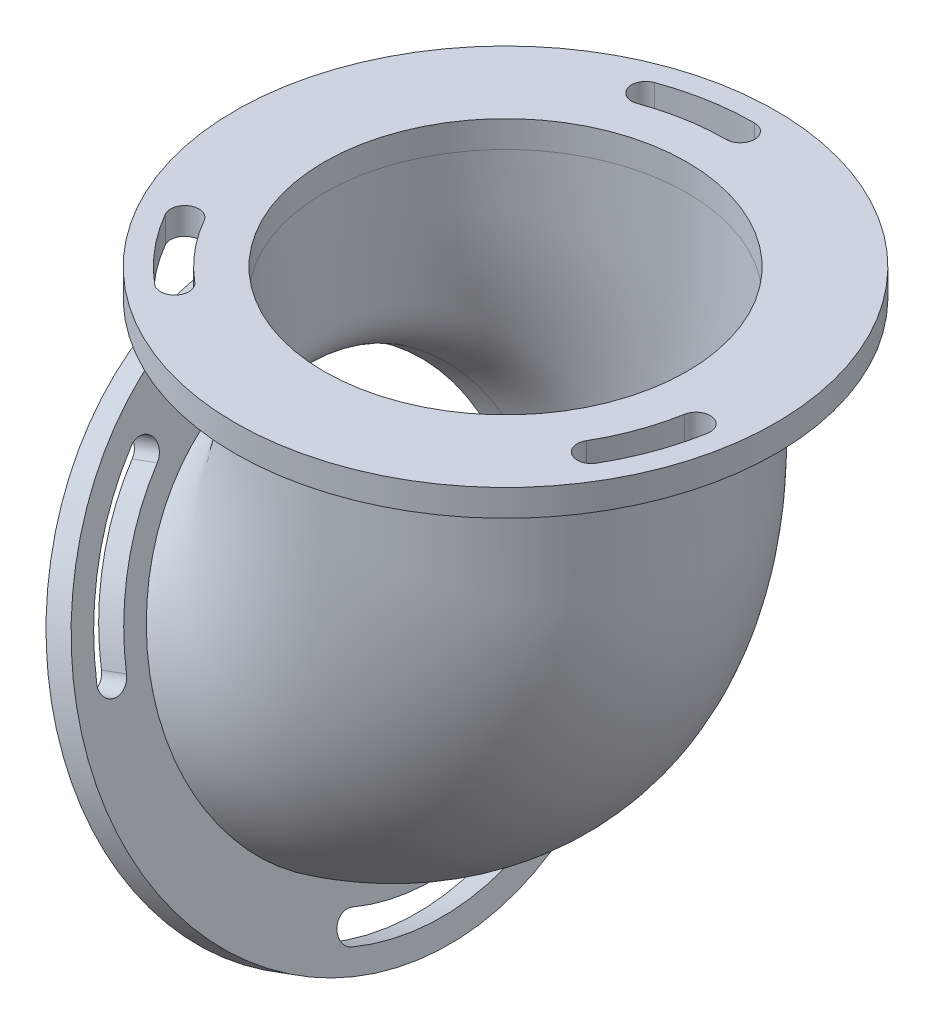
ISO-10303-21;
HEADER;
FILE_DESCRIPTION(('STEP AP214'),'2;1');
FILE_NAME('part.step','',(''),(''),'','','');
FILE_SCHEMA(('AUTOMOTIVE_DESIGN { 1 0 10303 214 1 1 1 1 }'));
ENDSEC;
DATA;
#1=APPLICATION_CONTEXT('core data for automotive mechanical design processes');
#2=APPLICATION_PROTOCOL_DEFINITION('international standard','automotive_design',2000,#1);
#3=PRODUCT_CONTEXT('',#1,'mechanical');
#4=PRODUCT('Part','Part','',(#3));
#5=PRODUCT_RELATED_PRODUCT_CATEGORY('part','',(#4));
#6=PRODUCT_DEFINITION_FORMATION('','',#4);
#7=PRODUCT_DEFINITION_CONTEXT('part definition',#1,'design');
#8=PRODUCT_DEFINITION('design','',#6,#7);
#9=PRODUCT_DEFINITION_SHAPE('','',#8);
#10=(LENGTH_UNIT() NAMED_UNIT(*) SI_UNIT(.MILLI.,.METRE.));
#11=(NAMED_UNIT(*) PLANE_ANGLE_UNIT() SI_UNIT($,.RADIAN.));
#12=(NAMED_UNIT(*) SI_UNIT($,.STERADIAN.) SOLID_ANGLE_UNIT());
#13=UNCERTAINTY_MEASURE_WITH_UNIT(LENGTH_MEASURE(1.E-05),#10,'distance_accuracy_value','');
#14=(GEOMETRIC_REPRESENTATION_CONTEXT(3) GLOBAL_UNCERTAINTY_ASSIGNED_CONTEXT((#13)) GLOBAL_UNIT_ASSIGNED_CONTEXT((#10,
#11,#12)) REPRESENTATION_CONTEXT('',''));
#15=CARTESIAN_POINT('',(0.,0.,0.));
#16=DIRECTION('',(0.,0.,1.));
#17=DIRECTION('',(1.,0.,0.));
#18=AXIS2_PLACEMENT_3D('',#15,#16,#17);
#19=CARTESIAN_POINT('',(21.3706682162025,3.,-24.807885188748));
#20=DIRECTION('',(0.,-1.,0.));
#21=DIRECTION('',(0.,0.,-1.));
#22=AXIS2_PLACEMENT_3D('',#19,#20,#21);
#23=CYLINDRICAL_SURFACE('',#22,1.6);
#24=CARTESIAN_POINT('',(21.3706682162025,0.,-24.807885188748));
#25=DIRECTION('',(0.,1.,0.));
#26=DIRECTION('',(0.,0.,1.));
#27=AXIS2_PLACEMENT_3D('',#24,#25,#26);
#28=CIRCLE('',#27,1.6);
#29=CARTESIAN_POINT('',(20.8234359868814,0.,-26.3113933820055));
#30=VERTEX_POINT('',#29);
#31=CARTESIAN_POINT('',(21.9179004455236,0.,-23.3043769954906));
#32=VERTEX_POINT('',#31);
#33=EDGE_CURVE('E332',#30,#32,#28,.T.);
#34=ORIENTED_EDGE('',*,*,#33,.F.);
#35=DIRECTION('',(0.,-1.,0.));
#36=VECTOR('',#35,1.);
#37=CARTESIAN_POINT('',(20.8234359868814,3.,-26.3113933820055));
#38=LINE('',#37,#36);
#39=CARTESIAN_POINT('',(20.8234359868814,3.,-26.3113933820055));
#40=VERTEX_POINT('',#39);
#41=EDGE_CURVE('E13',#40,#30,#38,.T.);
#42=ORIENTED_EDGE('',*,*,#41,.F.);
#43=CARTESIAN_POINT('',(21.3706682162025,3.,-24.807885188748));
#44=DIRECTION('',(0.,1.,0.));
#45=DIRECTION('',(0.,0.,1.));
#46=AXIS2_PLACEMENT_3D('',#43,#44,#45);
#47=CIRCLE('',#46,1.6);
#48=CARTESIAN_POINT('',(21.9179004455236,3.,-23.3043769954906));
#49=VERTEX_POINT('',#48);
#50=EDGE_CURVE('E284',#40,#49,#47,.T.);
#51=ORIENTED_EDGE('',*,*,#50,.T.);
#52=DIRECTION('',(0.,-1.,0.));
#53=VECTOR('',#52,1.);
#54=CARTESIAN_POINT('',(21.9179004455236,3.,-23.3043769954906));
#55=LINE('',#54,#53);
#56=EDGE_CURVE('E231',#49,#32,#55,.T.);
#57=ORIENTED_EDGE('',*,*,#56,.T.);
#58=EDGE_LOOP('',(#34,#42,#51,#57));
#59=FACE_BOUND('',#58,.T.);
#60=ADVANCED_FACE('F161',(#59),#23,.F.);
#61=CARTESIAN_POINT('',(30.4,3.,0.));
#62=DIRECTION('',(0.,-1.,0.));
#63=DIRECTION('',(0.,0.,-1.));
#64=AXIS2_PLACEMENT_3D('',#61,#62,#63);
#65=CYLINDRICAL_SURFACE('',#64,28.);
#66=CARTESIAN_POINT('',(30.4,0.,0.));
#67=DIRECTION('',(0.,1.,0.));
#68=DIRECTION('',(0.,0.,1.));
#69=AXIS2_PLACEMENT_3D('',#66,#67,#68);
#70=CIRCLE('',#69,28.);
#71=CARTESIAN_POINT('',(30.4,0.,-28.));
#72=VERTEX_POINT('',#71);
#73=EDGE_CURVE('E274',#72,#30,#70,.T.);
#74=ORIENTED_EDGE('',*,*,#73,.F.);
#75=DIRECTION('',(0.,-1.,0.));
#76=VECTOR('',#75,1.);
#77=CARTESIAN_POINT('',(30.4,3.,-28.));
#78=LINE('',#77,#76);
#79=CARTESIAN_POINT('',(30.4,3.,-28.));
#80=VERTEX_POINT('',#79);
#81=EDGE_CURVE('E175',#80,#72,#78,.T.);
#82=ORIENTED_EDGE('',*,*,#81,.F.);
#83=CARTESIAN_POINT('',(30.4,3.,0.));
#84=DIRECTION('',(0.,1.,0.));
#85=DIRECTION('',(0.,0.,1.));
#86=AXIS2_PLACEMENT_3D('',#83,#84,#85);
#87=CIRCLE('',#86,28.);
#88=EDGE_CURVE('E272',#80,#40,#87,.T.);
#89=ORIENTED_EDGE('',*,*,#88,.T.);
#90=ORIENTED_EDGE('',*,*,#41,.T.);
#91=EDGE_LOOP('',(#74,#82,#89,#90));
#92=FACE_BOUND('',#91,.T.);
#93=ADVANCED_FACE('F271',(#92),#65,.F.);
#94=CARTESIAN_POINT('',(30.4,3.,-26.4));
#95=DIRECTION('',(0.,-1.,0.));
#96=DIRECTION('',(0.,0.,-1.));
#97=AXIS2_PLACEMENT_3D('',#94,#95,#96);
#98=CYLINDRICAL_SURFACE('',#97,1.6);
#99=CARTESIAN_POINT('',(30.4,0.,-26.4));
#100=DIRECTION('',(0.,1.,0.));
#101=DIRECTION('',(0.,0.,1.));
#102=AXIS2_PLACEMENT_3D('',#99,#100,#101);
#103=CIRCLE('',#102,1.6);
#104=CARTESIAN_POINT('',(30.4,0.,-24.8));
#105=VERTEX_POINT('',#104);
#106=EDGE_CURVE('E338',#105,#72,#103,.T.);
#107=ORIENTED_EDGE('',*,*,#106,.F.);
#108=DIRECTION('',(0.,-1.,0.));
#109=VECTOR('',#108,1.);
#110=CARTESIAN_POINT('',(30.4,3.,-24.8));
#111=LINE('',#110,#109);
#112=CARTESIAN_POINT('',(30.4,3.,-24.8));
#113=VERTEX_POINT('',#112);
#114=EDGE_CURVE('E224',#113,#105,#111,.T.);
#115=ORIENTED_EDGE('',*,*,#114,.F.);
#116=CARTESIAN_POINT('',(30.4,3.,-26.4));
#117=DIRECTION('',(0.,1.,0.));
#118=DIRECTION('',(0.,0.,1.));
#119=AXIS2_PLACEMENT_3D('',#116,#117,#118);
#120=CIRCLE('',#119,1.6);
#121=EDGE_CURVE('E283',#113,#80,#120,.T.);
#122=ORIENTED_EDGE('',*,*,#121,.T.);
#123=ORIENTED_EDGE('',*,*,#81,.T.);
#124=EDGE_LOOP('',(#107,#115,#122,#123));
#125=FACE_BOUND('',#124,.T.);
#126=ADVANCED_FACE('F287',(#125),#98,.F.);
#127=CARTESIAN_POINT('',(30.4,3.,0.));
#128=DIRECTION('',(0.,-1.,0.));
#129=DIRECTION('',(0.,0.,-1.));
#130=AXIS2_PLACEMENT_3D('',#127,#128,#129);
#131=CYLINDRICAL_SURFACE('',#130,28.);
#132=CARTESIAN_POINT('',(30.4,0.,0.));
#133=DIRECTION('',(0.,1.,0.));
#134=DIRECTION('',(0.,0.,1.));
#135=AXIS2_PLACEMENT_3D('',#132,#133,#134);
#136=CIRCLE('',#135,28.);
#137=CARTESIAN_POINT('',(54.6487113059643,0.,14.));
#138=VERTEX_POINT('',#137);
#139=CARTESIAN_POINT('',(57.9746170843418,0.,4.8621489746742));
#140=VERTEX_POINT('',#139);
#141=EDGE_CURVE('E316',#138,#140,#136,.T.);
#142=ORIENTED_EDGE('',*,*,#141,.F.);
#143=DIRECTION('',(0.,-1.,0.));
#144=VECTOR('',#143,1.);
#145=CARTESIAN_POINT('',(54.6487113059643,3.,14.));
#146=LINE('',#145,#144);
#147=CARTESIAN_POINT('',(54.6487113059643,3.,14.));
#148=VERTEX_POINT('',#147);
#149=EDGE_CURVE('E351',#148,#138,#146,.T.);
#150=ORIENTED_EDGE('',*,*,#149,.F.);
#151=CARTESIAN_POINT('',(30.4,3.,0.));
#152=DIRECTION('',(0.,1.,0.));
#153=DIRECTION('',(0.,0.,1.));
#154=AXIS2_PLACEMENT_3D('',#151,#152,#153);
#155=CIRCLE('',#154,28.);
#156=CARTESIAN_POINT('',(57.9746170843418,3.,4.8621489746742));
#157=VERTEX_POINT('',#156);
#158=EDGE_CURVE('E465',#148,#157,#155,.T.);
#159=ORIENTED_EDGE('',*,*,#158,.T.);
#160=DIRECTION('',(0.,-1.,0.));
#161=VECTOR('',#160,1.);
#162=CARTESIAN_POINT('',(57.9746170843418,3.,4.8621489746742));
#163=LINE('',#162,#161);
#164=EDGE_CURVE('E354',#157,#140,#163,.T.);
#165=ORIENTED_EDGE('',*,*,#164,.T.);
#166=EDGE_LOOP('',(#142,#150,#159,#165));
#167=FACE_BOUND('',#166,.T.);
#168=ADVANCED_FACE('F408',(#167),#131,.F.);
#169=CARTESIAN_POINT('',(53.2630706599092,3.,13.2));
#170=DIRECTION('',(0.,-1.,0.));
#171=DIRECTION('',(0.,0.,-1.));
#172=AXIS2_PLACEMENT_3D('',#169,#170,#171);
#173=CYLINDRICAL_SURFACE('',#172,1.6);
#174=CARTESIAN_POINT('',(53.2630706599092,0.,13.2));
#175=DIRECTION('',(0.,1.,0.));
#176=DIRECTION('',(0.,0.,1.));
#177=AXIS2_PLACEMENT_3D('',#174,#175,#176);
#178=CIRCLE('',#177,1.6);
#179=CARTESIAN_POINT('',(51.8774300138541,0.,12.4));
#180=VERTEX_POINT('',#179);
#181=EDGE_CURVE('E320',#180,#138,#178,.T.);
#182=ORIENTED_EDGE('',*,*,#181,.F.);
#183=DIRECTION('',(0.,-1.,0.));
#184=VECTOR('',#183,1.);
#185=CARTESIAN_POINT('',(51.8774300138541,3.,12.4));
#186=LINE('',#185,#184);
#187=CARTESIAN_POINT('',(51.8774300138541,3.,12.4));
#188=VERTEX_POINT('',#187);
#189=EDGE_CURVE('E360',#188,#180,#186,.T.);
#190=ORIENTED_EDGE('',*,*,#189,.F.);
#191=CARTESIAN_POINT('',(53.2630706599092,3.,13.2));
#192=DIRECTION('',(0.,1.,0.));
#193=DIRECTION('',(0.,0.,1.));
#194=AXIS2_PLACEMENT_3D('',#191,#192,#193);
#195=CIRCLE('',#194,1.6);
#196=EDGE_CURVE('E469',#188,#148,#195,.T.);
#197=ORIENTED_EDGE('',*,*,#196,.T.);
#198=ORIENTED_EDGE('',*,*,#149,.T.);
#199=EDGE_LOOP('',(#182,#190,#197,#198));
#200=FACE_BOUND('',#199,.T.);
#201=ADVANCED_FACE('F421',(#200),#173,.F.);
#202=CARTESIAN_POINT('',(30.4,3.,0.));
#203=DIRECTION('',(0.,-1.,0.));
#204=DIRECTION('',(0.,0.,-1.));
#205=AXIS2_PLACEMENT_3D('',#202,#203,#204);
#206=CYLINDRICAL_SURFACE('',#205,24.8);
#207=CARTESIAN_POINT('',(30.4,0.,0.));
#208=DIRECTION('',(0.,1.,0.));
#209=DIRECTION('',(0.,0.,1.));
#210=AXIS2_PLACEMENT_3D('',#207,#208,#209);
#211=CIRCLE('',#210,24.8);
#212=CARTESIAN_POINT('',(54.8232322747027,0.,4.30647480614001));
#213=VERTEX_POINT('',#212);
#214=EDGE_CURVE('E324',#180,#213,#211,.T.);
#215=ORIENTED_EDGE('',*,*,#214,.T.);
#216=DIRECTION('',(0.,-1.,0.));
#217=VECTOR('',#216,1.);
#218=CARTESIAN_POINT('',(54.8232322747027,3.,4.30647480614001));
#219=LINE('',#218,#217);
#220=CARTESIAN_POINT('',(54.8232322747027,3.,4.30647480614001));
#221=VERTEX_POINT('',#220);
#222=EDGE_CURVE('E357',#221,#213,#219,.T.);
#223=ORIENTED_EDGE('',*,*,#222,.F.);
#224=CARTESIAN_POINT('',(30.4,3.,0.));
#225=DIRECTION('',(0.,1.,0.));
#226=DIRECTION('',(0.,0.,1.));
#227=AXIS2_PLACEMENT_3D('',#224,#225,#226);
#228=CIRCLE('',#227,24.8);
#229=EDGE_CURVE('E473',#188,#221,#228,.T.);
#230=ORIENTED_EDGE('',*,*,#229,.F.);
#231=ORIENTED_EDGE('',*,*,#189,.T.);
#232=EDGE_LOOP('',(#215,#223,#230,#231));
#233=FACE_BOUND('',#232,.T.);
#234=ADVANCED_FACE('F417',(#233),#206,.T.);
#235=CARTESIAN_POINT('',(30.4,3.,0.));
#236=DIRECTION('',(0.,-1.,0.));
#237=DIRECTION('',(0.,0.,-1.));
#238=AXIS2_PLACEMENT_3D('',#235,#236,#237);
#239=CYLINDRICAL_SURFACE('',#238,28.);
#240=CARTESIAN_POINT('',(30.4,0.,0.));
#241=DIRECTION('',(0.,1.,0.));
#242=DIRECTION('',(0.,0.,1.));
#243=AXIS2_PLACEMENT_3D('',#240,#241,#242);
#244=CIRCLE('',#243,28.);
#245=CARTESIAN_POINT('',(6.15128869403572,0.,14.));
#246=VERTEX_POINT('',#245);
#247=CARTESIAN_POINT('',(12.4019469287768,0.,21.4492444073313));
#248=VERTEX_POINT('',#247);
#249=EDGE_CURVE('E299',#246,#248,#244,.T.);
#250=ORIENTED_EDGE('',*,*,#249,.F.);
#251=DIRECTION('',(0.,-1.,0.));
#252=VECTOR('',#251,1.);
#253=CARTESIAN_POINT('',(6.15128869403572,3.,14.));
#254=LINE('',#253,#252);
#255=CARTESIAN_POINT('',(6.15128869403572,3.,14.));
#256=VERTEX_POINT('',#255);
#257=EDGE_CURVE('E238',#256,#246,#254,.T.);
#258=ORIENTED_EDGE('',*,*,#257,.F.);
#259=CARTESIAN_POINT('',(30.4,3.,0.));
#260=DIRECTION('',(0.,1.,0.));
#261=DIRECTION('',(0.,0.,1.));
#262=AXIS2_PLACEMENT_3D('',#259,#260,#261);
#263=CIRCLE('',#262,28.);
#264=CARTESIAN_POINT('',(12.4019469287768,3.,21.4492444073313));
#265=VERTEX_POINT('',#264);
#266=EDGE_CURVE('E453',#256,#265,#263,.T.);
#267=ORIENTED_EDGE('',*,*,#266,.T.);
#268=DIRECTION('',(0.,-1.,0.));
#269=VECTOR('',#268,1.);
#270=CARTESIAN_POINT('',(12.4019469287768,3.,21.4492444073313));
#271=LINE('',#270,#269);
#272=EDGE_CURVE('E298',#265,#248,#271,.T.);
#273=ORIENTED_EDGE('',*,*,#272,.T.);
#274=EDGE_LOOP('',(#250,#258,#267,#273));
#275=FACE_BOUND('',#274,.T.);
#276=ADVANCED_FACE('F420',(#275),#239,.F.);
#277=CARTESIAN_POINT('',(7.53692934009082,3.,13.2));
#278=DIRECTION('',(0.,-1.,0.));
#279=DIRECTION('',(0.,0.,-1.));
#280=AXIS2_PLACEMENT_3D('',#277,#278,#279);
#281=CYLINDRICAL_SURFACE('',#280,1.6);
#282=CARTESIAN_POINT('',(7.53692934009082,0.,13.2));
#283=DIRECTION('',(0.,1.,0.));
#284=DIRECTION('',(0.,0.,1.));
#285=AXIS2_PLACEMENT_3D('',#282,#283,#284);
#286=CIRCLE('',#285,1.6);
#287=CARTESIAN_POINT('',(8.92256998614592,0.,12.4));
#288=VERTEX_POINT('',#287);
#289=EDGE_CURVE('E303',#288,#246,#286,.T.);
#290=ORIENTED_EDGE('',*,*,#289,.F.);
#291=DIRECTION('',(0.,-1.,0.));
#292=VECTOR('',#291,1.);
#293=CARTESIAN_POINT('',(8.92256998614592,3.,12.4));
#294=LINE('',#293,#292);
#295=CARTESIAN_POINT('',(8.92256998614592,3.,12.4));
#296=VERTEX_POINT('',#295);
#297=EDGE_CURVE('E370',#296,#288,#294,.T.);
#298=ORIENTED_EDGE('',*,*,#297,.F.);
#299=CARTESIAN_POINT('',(7.53692934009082,3.,13.2));
#300=DIRECTION('',(0.,1.,0.));
#301=DIRECTION('',(0.,0.,1.));
#302=AXIS2_PLACEMENT_3D('',#299,#300,#301);
#303=CIRCLE('',#302,1.6);
#304=EDGE_CURVE('E449',#296,#256,#303,.T.);
#305=ORIENTED_EDGE('',*,*,#304,.T.);
#306=ORIENTED_EDGE('',*,*,#257,.T.);
#307=EDGE_LOOP('',(#290,#298,#305,#306));
#308=FACE_BOUND('',#307,.T.);
#309=ADVANCED_FACE('F434',(#308),#281,.F.);
#310=CARTESIAN_POINT('',(30.4,3.,0.));
#311=DIRECTION('',(0.,-1.,0.));
#312=DIRECTION('',(0.,0.,-1.));
#313=AXIS2_PLACEMENT_3D('',#310,#311,#312);
#314=CYLINDRICAL_SURFACE('',#313,24.8);
#315=CARTESIAN_POINT('',(30.4,0.,0.));
#316=DIRECTION('',(0.,1.,0.));
#317=DIRECTION('',(0.,0.,1.));
#318=AXIS2_PLACEMENT_3D('',#315,#316,#317);
#319=CIRCLE('',#318,24.8);
#320=CARTESIAN_POINT('',(14.4588672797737,0.,18.9979021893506));
#321=VERTEX_POINT('',#320);
#322=EDGE_CURVE('E308',#288,#321,#319,.T.);
#323=ORIENTED_EDGE('',*,*,#322,.T.);
#324=DIRECTION('',(0.,-1.,0.));
#325=VECTOR('',#324,1.);
#326=CARTESIAN_POINT('',(14.4588672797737,3.,18.9979021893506));
#327=LINE('',#326,#325);
#328=CARTESIAN_POINT('',(14.4588672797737,3.,18.9979021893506));
#329=VERTEX_POINT('',#328);
#330=EDGE_CURVE('E367',#329,#321,#327,.T.);
#331=ORIENTED_EDGE('',*,*,#330,.F.);
#332=CARTESIAN_POINT('',(30.4,3.,0.));
#333=DIRECTION('',(0.,1.,0.));
#334=DIRECTION('',(0.,0.,1.));
#335=AXIS2_PLACEMENT_3D('',#332,#333,#334);
#336=CIRCLE('',#335,24.8);
#337=EDGE_CURVE('E452',#296,#329,#336,.T.);
#338=ORIENTED_EDGE('',*,*,#337,.F.);
#339=ORIENTED_EDGE('',*,*,#297,.T.);
#340=EDGE_LOOP('',(#323,#331,#338,#339));
#341=FACE_BOUND('',#340,.T.);
#342=ADVANCED_FACE('F405',(#341),#314,.T.);
#343=CARTESIAN_POINT('',(30.4,3.,0.));
#344=DIRECTION('',(0.,-1.,0.));
#345=DIRECTION('',(0.,0.,-1.));
#346=AXIS2_PLACEMENT_3D('',#343,#344,#345);
#347=CYLINDRICAL_SURFACE('',#346,24.8);
#348=CARTESIAN_POINT('',(30.4,0.,0.));
#349=DIRECTION('',(0.,1.,0.));
#350=DIRECTION('',(0.,0.,1.));
#351=AXIS2_PLACEMENT_3D('',#348,#349,#350);
#352=CIRCLE('',#351,24.8);
#353=EDGE_CURVE('E341',#105,#32,#352,.T.);
#354=ORIENTED_EDGE('',*,*,#353,.T.);
#355=ORIENTED_EDGE('',*,*,#56,.F.);
#356=CARTESIAN_POINT('',(30.4,3.,0.));
#357=DIRECTION('',(0.,1.,0.));
#358=DIRECTION('',(0.,0.,1.));
#359=AXIS2_PLACEMENT_3D('',#356,#357,#358);
#360=CIRCLE('',#359,24.8);
#361=EDGE_CURVE('E184',#113,#49,#360,.T.);
#362=ORIENTED_EDGE('',*,*,#361,.F.);
#363=ORIENTED_EDGE('',*,*,#114,.T.);
#364=EDGE_LOOP('',(#354,#355,#362,#363));
#365=FACE_BOUND('',#364,.T.);
#366=ADVANCED_FACE('F401',(#365),#347,.T.);
#367=CARTESIAN_POINT('',(56.3989246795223,3.,4.58431189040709));
#368=DIRECTION('',(0.,-1.,0.));
#369=DIRECTION('',(0.,0.,-1.));
#370=AXIS2_PLACEMENT_3D('',#367,#368,#369);
#371=CYLINDRICAL_SURFACE('',#370,1.6);
#372=CARTESIAN_POINT('',(56.3989246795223,0.,4.58431189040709));
#373=DIRECTION('',(0.,1.,0.));
#374=DIRECTION('',(0.,0.,1.));
#375=AXIS2_PLACEMENT_3D('',#372,#373,#374);
#376=CIRCLE('',#375,1.6);
#377=EDGE_CURVE('E328',#140,#213,#376,.T.);
#378=ORIENTED_EDGE('',*,*,#377,.F.);
#379=ORIENTED_EDGE('',*,*,#164,.F.);
#380=CARTESIAN_POINT('',(56.3989246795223,3.,4.58431189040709));
#381=DIRECTION('',(0.,1.,0.));
#382=DIRECTION('',(0.,0.,1.));
#383=AXIS2_PLACEMENT_3D('',#380,#381,#382);
#384=CIRCLE('',#383,1.6);
#385=EDGE_CURVE('E476',#157,#221,#384,.T.);
#386=ORIENTED_EDGE('',*,*,#385,.T.);
#387=ORIENTED_EDGE('',*,*,#222,.T.);
#388=EDGE_LOOP('',(#378,#379,#386,#387));
#389=FACE_BOUND('',#388,.T.);
#390=ADVANCED_FACE('F404',(#389),#371,.F.);
#391=CARTESIAN_POINT('',(13.4304071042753,3.,20.2235732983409));
#392=DIRECTION('',(0.,-1.,0.));
#393=DIRECTION('',(0.,0.,-1.));
#394=AXIS2_PLACEMENT_3D('',#391,#392,#393);
#395=CYLINDRICAL_SURFACE('',#394,1.6);
#396=CARTESIAN_POINT('',(13.4304071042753,0.,20.2235732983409));
#397=DIRECTION('',(0.,1.,0.));
#398=DIRECTION('',(0.,0.,1.));
#399=AXIS2_PLACEMENT_3D('',#396,#397,#398);
#400=CIRCLE('',#399,1.6);
#401=EDGE_CURVE('E312',#248,#321,#400,.T.);
#402=ORIENTED_EDGE('',*,*,#401,.F.);
#403=ORIENTED_EDGE('',*,*,#272,.F.);
#404=CARTESIAN_POINT('',(13.4304071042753,3.,20.2235732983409));
#405=DIRECTION('',(0.,1.,0.));
#406=DIRECTION('',(0.,0.,1.));
#407=AXIS2_PLACEMENT_3D('',#404,#405,#406);
#408=CIRCLE('',#407,1.6);
#409=EDGE_CURVE('E457',#265,#329,#408,.T.);
#410=ORIENTED_EDGE('',*,*,#409,.T.);
#411=ORIENTED_EDGE('',*,*,#330,.T.);
#412=EDGE_LOOP('',(#402,#403,#410,#411));
#413=FACE_BOUND('',#412,.T.);
#414=ADVANCED_FACE('F415',(#413),#395,.F.);
#415=CARTESIAN_POINT('',(30.4,3.,0.));
#416=DIRECTION('',(0.,-1.,0.));
#417=DIRECTION('',(0.,0.,-1.));
#418=AXIS2_PLACEMENT_3D('',#415,#416,#417);
#419=CYLINDRICAL_SURFACE('',#418,20.4);
#420=CARTESIAN_POINT('',(30.4,3.,0.));
#421=DIRECTION('',(0.,1.,0.));
#422=DIRECTION('',(0.,0.,1.));
#423=AXIS2_PLACEMENT_3D('',#420,#421,#422);
#424=CIRCLE('',#423,20.4);
#425=CARTESIAN_POINT('',(30.4,3.,20.4));
#426=VERTEX_POINT('',#425);
#427=EDGE_CURVE('E348',#426,#426,#424,.T.);
#428=ORIENTED_EDGE('',*,*,#427,.T.);
#429=EDGE_LOOP('',(#428));
#430=FACE_BOUND('',#429,.T.);
#431=CARTESIAN_POINT('',(30.4,0.,0.));
#432=DIRECTION('',(0.,1.,0.));
#433=DIRECTION('',(0.,0.,1.));
#434=AXIS2_PLACEMENT_3D('',#431,#432,#433);
#435=CIRCLE('',#434,20.4);
#436=CARTESIAN_POINT('',(9.99999999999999,0.,0.));
#437=VERTEX_POINT('',#436);
#438=EDGE_CURVE('E655',#437,#437,#435,.T.);
#439=ORIENTED_EDGE('',*,*,#438,.F.);
#440=EDGE_LOOP('',(#439));
#441=FACE_BOUND('',#440,.T.);
#442=ADVANCED_FACE('F163',(#430,#441),#419,.F.);
#443=CARTESIAN_POINT('',(30.4,3.,0.));
#444=DIRECTION('',(0.,-1.,0.));
#445=DIRECTION('',(0.,0.,-1.));
#446=AXIS2_PLACEMENT_3D('',#443,#444,#445);
#447=CYLINDRICAL_SURFACE('',#446,30.4);
#448=CARTESIAN_POINT('',(30.4,3.,0.));
#449=DIRECTION('',(0.,1.,0.));
#450=DIRECTION('',(0.,0.,1.));
#451=AXIS2_PLACEMENT_3D('',#448,#449,#450);
#452=CIRCLE('',#451,30.4);
#453=CARTESIAN_POINT('',(30.4,3.,30.4));
#454=VERTEX_POINT('',#453);
#455=EDGE_CURVE('E291',#454,#454,#452,.T.);
#456=ORIENTED_EDGE('',*,*,#455,.F.);
#457=EDGE_LOOP('',(#456));
#458=FACE_BOUND('',#457,.T.);
#459=CARTESIAN_POINT('',(30.4,0.,0.));
#460=DIRECTION('',(0.,1.,0.));
#461=DIRECTION('',(0.,0.,1.));
#462=AXIS2_PLACEMENT_3D('',#459,#460,#461);
#463=CIRCLE('',#462,30.4);
#464=CARTESIAN_POINT('',(30.4,0.,30.4));
#465=VERTEX_POINT('',#464);
#466=EDGE_CURVE('E344',#465,#465,#463,.T.);
#467=ORIENTED_EDGE('',*,*,#466,.T.);
#468=EDGE_LOOP('',(#467));
#469=FACE_BOUND('',#468,.T.);
#470=ADVANCED_FACE('F397',(#458,#469),#447,.T.);
#471=CARTESIAN_POINT('',(0.,3.,0.));
#472=DIRECTION('',(0.,1.,0.));
#473=DIRECTION('',(0.,0.,1.));
#474=AXIS2_PLACEMENT_3D('',#471,#472,#473);
#475=PLANE('',#474);
#476=ORIENTED_EDGE('',*,*,#427,.F.);
#477=EDGE_LOOP('',(#476));
#478=FACE_BOUND('',#477,.T.);
#479=ORIENTED_EDGE('',*,*,#266,.F.);
#480=ORIENTED_EDGE('',*,*,#304,.F.);
#481=ORIENTED_EDGE('',*,*,#337,.T.);
#482=ORIENTED_EDGE('',*,*,#409,.F.);
#483=EDGE_LOOP('',(#479,#480,#481,#482));
#484=FACE_BOUND('',#483,.T.);
#485=ORIENTED_EDGE('',*,*,#158,.F.);
#486=ORIENTED_EDGE('',*,*,#196,.F.);
#487=ORIENTED_EDGE('',*,*,#229,.T.);
#488=ORIENTED_EDGE('',*,*,#385,.F.);
#489=EDGE_LOOP('',(#485,#486,#487,#488));
#490=FACE_BOUND('',#489,.T.);
#491=ORIENTED_EDGE('',*,*,#50,.F.);
#492=ORIENTED_EDGE('',*,*,#88,.F.);
#493=ORIENTED_EDGE('',*,*,#121,.F.);
#494=ORIENTED_EDGE('',*,*,#361,.T.);
#495=EDGE_LOOP('',(#491,#492,#493,#494));
#496=FACE_BOUND('',#495,.T.);
#497=ORIENTED_EDGE('',*,*,#455,.T.);
#498=EDGE_LOOP('',(#497));
#499=FACE_BOUND('',#498,.T.);
#500=ADVANCED_FACE('F281',(#478,#484,#490,#496,#499),#475,.T.);
#501=CARTESIAN_POINT('',(0.,0.,0.));
#502=DIRECTION('',(0.,1.,0.));
#503=DIRECTION('',(0.,0.,1.));
#504=AXIS2_PLACEMENT_3D('',#501,#502,#503);
#505=PLANE('',#504);
#506=CARTESIAN_POINT('',(30.4,0.,0.));
#507=DIRECTION('',(0.,1.,0.));
#508=DIRECTION('',(0.,0.,1.));
#509=AXIS2_PLACEMENT_3D('',#506,#507,#508);
#510=CIRCLE('',#509,22.4);
#511=CARTESIAN_POINT('',(30.4,0.,22.4));
#512=VERTEX_POINT('',#511);
#513=EDGE_CURVE('E304',#512,#512,#510,.T.);
#514=ORIENTED_EDGE('',*,*,#513,.T.);
#515=EDGE_LOOP('',(#514));
#516=FACE_BOUND('',#515,.T.);
#517=ORIENTED_EDGE('',*,*,#249,.T.);
#518=ORIENTED_EDGE('',*,*,#401,.T.);
#519=ORIENTED_EDGE('',*,*,#322,.F.);
#520=ORIENTED_EDGE('',*,*,#289,.T.);
#521=EDGE_LOOP('',(#517,#518,#519,#520));
#522=FACE_BOUND('',#521,.T.);
#523=ORIENTED_EDGE('',*,*,#141,.T.);
#524=ORIENTED_EDGE('',*,*,#377,.T.);
#525=ORIENTED_EDGE('',*,*,#214,.F.);
#526=ORIENTED_EDGE('',*,*,#181,.T.);
#527=EDGE_LOOP('',(#523,#524,#525,#526));
#528=FACE_BOUND('',#527,.T.);
#529=ORIENTED_EDGE('',*,*,#33,.T.);
#530=ORIENTED_EDGE('',*,*,#353,.F.);
#531=ORIENTED_EDGE('',*,*,#106,.T.);
#532=ORIENTED_EDGE('',*,*,#73,.T.);
#533=EDGE_LOOP('',(#529,#530,#531,#532));
#534=FACE_BOUND('',#533,.T.);
#535=ORIENTED_EDGE('',*,*,#466,.F.);
#536=EDGE_LOOP('',(#535));
#537=FACE_BOUND('',#536,.T.);
#538=ADVANCED_FACE('F385',(#516,#522,#528,#534,#537),#505,.F.);
#539=CARTESIAN_POINT('',(52.8,0.,0.));
#540=CARTESIAN_POINT('',(52.8,-5.22266434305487,0.));
#541=CARTESIAN_POINT('',(52.7999999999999,-10.4453286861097,0.));
#542=CARTESIAN_POINT('',(52.8000000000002,-29.9200780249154,0.));
#543=CARTESIAN_POINT('',(46.0969612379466,-42.987188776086,0.));
#544=CARTESIAN_POINT('',(31.1685699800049,-54.5167806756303,0.));
#545=CARTESIAN_POINT('',(26.4809746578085,-57.0082898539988,0.));
#546=CARTESIAN_POINT('',(21.3420569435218,-58.6368195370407,0.));
#547=CARTESIAN_POINT('',(52.8,0.,1.46607655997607));
#548=CARTESIAN_POINT('',(52.8,-5.22266434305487,1.46607655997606));
#549=CARTESIAN_POINT('',(52.7999999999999,-10.4453286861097,1.46607655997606));
#550=CARTESIAN_POINT('',(52.8000000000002,-29.9200780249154,1.46607655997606));
#551=CARTESIAN_POINT('',(46.0969612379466,-42.987188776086,1.46607655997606));
#552=CARTESIAN_POINT('',(31.1685699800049,-54.5167806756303,1.46607655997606));
#553=CARTESIAN_POINT('',(26.4809746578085,-57.0082898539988,1.46607655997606));
#554=CARTESIAN_POINT('',(21.3420569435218,-58.6368195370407,1.46607655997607));
#555=CARTESIAN_POINT('',(52.5102273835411,0.,4.39771855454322));
#556=CARTESIAN_POINT('',(52.5074529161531,-5.19539951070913,4.39771855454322));
#557=CARTESIAN_POINT('',(52.504678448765,-10.3907990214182,4.39771855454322));
#558=CARTESIAN_POINT('',(52.494332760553,-29.7638807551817,4.39771855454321));
#559=CARTESIAN_POINT('',(45.8360902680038,-42.7658463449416,4.39771855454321));
#560=CARTESIAN_POINT('',(31.013892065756,-54.2562779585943,4.39771855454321));
#561=CARTESIAN_POINT('',(26.3538696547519,-56.7412454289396,4.39771855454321));
#562=CARTESIAN_POINT('',(21.2429488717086,-58.3645223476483,4.39771855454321));
#563=CARTESIAN_POINT('',(50.8033012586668,0.,10.0383020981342));
#564=CARTESIAN_POINT('',(50.7904808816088,-5.03799705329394,10.0383020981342));
#565=CARTESIAN_POINT('',(50.7776605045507,-10.0759941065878,10.0383020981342));
#566=CARTESIAN_POINT('',(50.7298547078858,-28.8621391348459,10.0383020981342));
#567=CARTESIAN_POINT('',(44.3322192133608,-41.4854873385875,10.0383020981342));
#568=CARTESIAN_POINT('',(30.1136918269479,-52.7325328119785,10.0383020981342));
#569=CARTESIAN_POINT('',(25.6107019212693,-55.1738353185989,10.0383020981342));
#570=CARTESIAN_POINT('',(20.6591457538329,-56.7605364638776,10.0383020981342));
#571=CARTESIAN_POINT('',(46.6525678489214,0.,16.2520930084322));
#572=CARTESIAN_POINT('',(46.6294162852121,-4.66241173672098,16.2520930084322));
#573=CARTESIAN_POINT('',(46.6062647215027,-9.32482347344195,16.2520930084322));
#574=CARTESIAN_POINT('',(46.519935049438,-26.7104515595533,16.2520930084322));
#575=CARTESIAN_POINT('',(40.7487004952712,-38.4245882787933,16.2520930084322));
#576=CARTESIAN_POINT('',(27.9491673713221,-49.0513388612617,16.2520930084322));
#577=CARTESIAN_POINT('',(23.8159723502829,-51.374975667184,16.2520930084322));
#578=CARTESIAN_POINT('',(19.239511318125,-52.8601229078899,16.2520930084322));
#579=CARTESIAN_POINT('',(39.1954215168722,0.,21.234384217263));
#580=CARTESIAN_POINT('',(39.1772058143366,-3.99959176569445,21.234384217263));
#581=CARTESIAN_POINT('',(39.1589901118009,-7.99918353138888,21.234384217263));
#582=CARTESIAN_POINT('',(39.0910657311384,-22.9132277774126,21.234384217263));
#583=CARTESIAN_POINT('',(34.4330179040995,-33.0130104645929,21.234384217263));
#584=CARTESIAN_POINT('',(24.1012381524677,-42.4779254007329,21.234384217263));
#585=CARTESIAN_POINT('',(20.6123084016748,-44.571022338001,21.234384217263));
#586=CARTESIAN_POINT('',(16.6890170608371,-45.8526975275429,21.234384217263));
#587=CARTESIAN_POINT('',(30.4,0.,22.9839626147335));
#588=CARTESIAN_POINT('',(30.4,-3.22412466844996,22.9839626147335));
#589=CARTESIAN_POINT('',(30.4,-6.44824933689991,22.9839626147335));
#590=CARTESIAN_POINT('',(30.4000000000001,-18.4706608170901,22.9839626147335));
#591=CARTESIAN_POINT('',(27.0484806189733,-26.6764605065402,22.9839626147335));
#592=CARTESIAN_POINT('',(19.5842849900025,-34.7460196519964,22.9839626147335));
#593=CARTESIAN_POINT('',(16.8446379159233,-36.5571057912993,22.9839626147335));
#594=CARTESIAN_POINT('',(13.6808057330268,-37.5877048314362,22.9839626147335));
#595=CARTESIAN_POINT('',(21.6045784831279,0.,21.234384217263));
#596=CARTESIAN_POINT('',(21.6227941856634,-2.4486575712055,21.234384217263));
#597=CARTESIAN_POINT('',(21.641009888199,-4.897315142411,21.234384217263));
#598=CARTESIAN_POINT('',(21.7089342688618,-14.0280938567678,21.234384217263));
#599=CARTESIAN_POINT('',(19.6639433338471,-20.3399105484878,21.234384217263));
#600=CARTESIAN_POINT('',(15.0673318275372,-27.0141139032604,21.2343842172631));
#601=CARTESIAN_POINT('',(13.0769674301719,-28.5431892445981,21.2343842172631));
#602=CARTESIAN_POINT('',(10.6725944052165,-29.32271213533,21.2343842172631));
#603=CARTESIAN_POINT('',(14.1474321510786,0.,16.2520930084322));
#604=CARTESIAN_POINT('',(14.1705837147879,-1.78583760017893,16.2520930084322));
#605=CARTESIAN_POINT('',(14.1937352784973,-3.57167520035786,16.2520930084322));
#606=CARTESIAN_POINT('',(14.2800649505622,-10.230870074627,16.2520930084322));
#607=CARTESIAN_POINT('',(13.3482607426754,-14.9283327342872,16.2520930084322));
#608=CARTESIAN_POINT('',(11.2194026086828,-20.4407004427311,16.2520930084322));
#609=CARTESIAN_POINT('',(9.87330348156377,-21.7392359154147,16.2520930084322));
#610=CARTESIAN_POINT('',(8.12210014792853,-22.3152867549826,16.2520930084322));
#611=CARTESIAN_POINT('',(9.99669874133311,0.,10.0383020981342));
#612=CARTESIAN_POINT('',(10.0095191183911,-1.41025228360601,10.0383020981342));
#613=CARTESIAN_POINT('',(10.0223394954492,-2.82050456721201,10.0383020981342));
#614=CARTESIAN_POINT('',(10.0701452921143,-8.07918249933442,10.0383020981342));
#615=CARTESIAN_POINT('',(9.7647420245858,-11.8674336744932,10.0383020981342));
#616=CARTESIAN_POINT('',(9.05487815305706,-16.7595064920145,10.0383020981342));
#617=CARTESIAN_POINT('',(8.07857391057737,-17.9403762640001,10.0383020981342));
#618=CARTESIAN_POINT('',(6.70246571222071,-18.4148731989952,10.0383020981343));
#619=CARTESIAN_POINT('',(8.28977261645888,0.,4.3977185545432));
#620=CARTESIAN_POINT('',(8.29254708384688,-1.25284982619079,4.3977185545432));
#621=CARTESIAN_POINT('',(8.2953215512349,-2.50569965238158,4.3977185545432));
#622=CARTESIAN_POINT('',(8.30566723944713,-7.17744087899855,4.39771855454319));
#623=CARTESIAN_POINT('',(8.2608709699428,-10.5870746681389,4.39771855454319));
#624=CARTESIAN_POINT('',(8.15467791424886,-15.2357613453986,4.39771855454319));
#625=CARTESIAN_POINT('',(7.33540617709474,-16.3729661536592,4.39771855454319));
#626=CARTESIAN_POINT('',(6.11866259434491,-16.8108873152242,4.39771855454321));
#627=CARTESIAN_POINT('',(7.99999999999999,0.,1.46607655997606));
#628=CARTESIAN_POINT('',(7.99999999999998,-1.22558499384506,1.46607655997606));
#629=CARTESIAN_POINT('',(7.99999999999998,-2.45116998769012,1.46607655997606));
#630=CARTESIAN_POINT('',(7.99999999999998,-7.02124360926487,1.46607655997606));
#631=CARTESIAN_POINT('',(7.99999999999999,-10.3657322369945,1.46607655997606));
#632=CARTESIAN_POINT('',(7.99999999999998,-14.9752586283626,1.46607655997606));
#633=CARTESIAN_POINT('',(7.20830117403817,-16.1059217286,1.46607655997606));
#634=CARTESIAN_POINT('',(6.01955452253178,-16.538590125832,1.46607655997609));
#635=CARTESIAN_POINT('',(7.99999999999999,0.,-1.46607655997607));
#636=CARTESIAN_POINT('',(7.99999999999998,-1.22558499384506,-1.46607655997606));
#637=CARTESIAN_POINT('',(7.99999999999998,-2.45116998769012,-1.46607655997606));
#638=CARTESIAN_POINT('',(7.99999999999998,-7.02124360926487,-1.46607655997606));
#639=CARTESIAN_POINT('',(7.99999999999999,-10.3657322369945,-1.46607655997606));
#640=CARTESIAN_POINT('',(7.99999999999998,-14.9752586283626,-1.46607655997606));
#641=CARTESIAN_POINT('',(7.20830117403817,-16.1059217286,-1.46607655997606));
#642=CARTESIAN_POINT('',(6.01955452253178,-16.538590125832,-1.46607655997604));
#643=CARTESIAN_POINT('',(8.28977261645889,0.,-4.39771855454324));
#644=CARTESIAN_POINT('',(8.29254708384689,-1.25284982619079,-4.39771855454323));
#645=CARTESIAN_POINT('',(8.29532155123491,-2.50569965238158,-4.39771855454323));
#646=CARTESIAN_POINT('',(8.30566723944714,-7.17744087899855,-4.39771855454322));
#647=CARTESIAN_POINT('',(8.26087096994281,-10.5870746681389,-4.39771855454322));
#648=CARTESIAN_POINT('',(8.15467791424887,-15.2357613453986,-4.39771855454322));
#649=CARTESIAN_POINT('',(7.33540617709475,-16.3729661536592,-4.39771855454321));
#650=CARTESIAN_POINT('',(6.11866259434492,-16.8108873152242,-4.39771855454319));
#651=CARTESIAN_POINT('',(9.99669874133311,0.,-10.0383020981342));
#652=CARTESIAN_POINT('',(10.0095191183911,-1.41025228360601,-10.0383020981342));
#653=CARTESIAN_POINT('',(10.0223394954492,-2.82050456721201,-10.0383020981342));
#654=CARTESIAN_POINT('',(10.0701452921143,-8.07918249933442,-10.0383020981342));
#655=CARTESIAN_POINT('',(9.76474202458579,-11.8674336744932,-10.0383020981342));
#656=CARTESIAN_POINT('',(9.05487815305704,-16.7595064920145,-10.0383020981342));
#657=CARTESIAN_POINT('',(8.07857391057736,-17.9403762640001,-10.0383020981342));
#658=CARTESIAN_POINT('',(6.7024657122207,-18.4148731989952,-10.0383020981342));
#659=CARTESIAN_POINT('',(14.1474321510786,0.,-16.2520930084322));
#660=CARTESIAN_POINT('',(14.1705837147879,-1.78583760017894,-16.2520930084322));
#661=CARTESIAN_POINT('',(14.1937352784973,-3.57167520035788,-16.2520930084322));
#662=CARTESIAN_POINT('',(14.2800649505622,-10.230870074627,-16.2520930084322));
#663=CARTESIAN_POINT('',(13.3482607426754,-14.9283327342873,-16.2520930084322));
#664=CARTESIAN_POINT('',(11.2194026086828,-20.4407004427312,-16.2520930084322));
#665=CARTESIAN_POINT('',(9.87330348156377,-21.7392359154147,-16.2520930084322));
#666=CARTESIAN_POINT('',(8.12210014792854,-22.3152867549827,-16.2520930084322));
#667=CARTESIAN_POINT('',(21.6045784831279,0.,-21.234384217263));
#668=CARTESIAN_POINT('',(21.6227941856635,-2.44865757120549,-21.234384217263));
#669=CARTESIAN_POINT('',(21.6410098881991,-4.89731514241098,-21.234384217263));
#670=CARTESIAN_POINT('',(21.7089342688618,-14.0280938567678,-21.234384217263));
#671=CARTESIAN_POINT('',(19.6639433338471,-20.3399105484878,-21.234384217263));
#672=CARTESIAN_POINT('',(15.0673318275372,-27.0141139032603,-21.234384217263));
#673=CARTESIAN_POINT('',(13.0769674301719,-28.543189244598,-21.234384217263));
#674=CARTESIAN_POINT('',(10.6725944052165,-29.3227121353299,-21.2343842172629));
#675=CARTESIAN_POINT('',(30.4,0.,-22.9839626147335));
#676=CARTESIAN_POINT('',(30.4,-3.22412466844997,-22.9839626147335));
#677=CARTESIAN_POINT('',(30.3999999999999,-6.44824933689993,-22.9839626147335));
#678=CARTESIAN_POINT('',(30.4000000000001,-18.4706608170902,-22.9839626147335));
#679=CARTESIAN_POINT('',(27.0484806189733,-26.6764605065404,-22.9839626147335));
#680=CARTESIAN_POINT('',(19.5842849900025,-34.7460196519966,-22.9839626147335));
#681=CARTESIAN_POINT('',(16.8446379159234,-36.5571057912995,-22.9839626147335));
#682=CARTESIAN_POINT('',(13.6808057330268,-37.5877048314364,-22.9839626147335));
#683=CARTESIAN_POINT('',(39.1954215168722,0.,-21.234384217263));
#684=CARTESIAN_POINT('',(39.1772058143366,-3.99959176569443,-21.234384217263));
#685=CARTESIAN_POINT('',(39.158990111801,-7.99918353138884,-21.234384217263));
#686=CARTESIAN_POINT('',(39.0910657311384,-22.9132277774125,-21.234384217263));
#687=CARTESIAN_POINT('',(34.4330179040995,-33.0130104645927,-21.234384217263));
#688=CARTESIAN_POINT('',(24.1012381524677,-42.4779254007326,-21.234384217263));
#689=CARTESIAN_POINT('',(20.6123084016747,-44.5710223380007,-21.234384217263));
#690=CARTESIAN_POINT('',(16.6890170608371,-45.8526975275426,-21.234384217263));
#691=CARTESIAN_POINT('',(46.6525678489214,0.,-16.2520930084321));
#692=CARTESIAN_POINT('',(46.6294162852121,-4.66241173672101,-16.2520930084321));
#693=CARTESIAN_POINT('',(46.6062647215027,-9.32482347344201,-16.2520930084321));
#694=CARTESIAN_POINT('',(46.519935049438,-26.7104515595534,-16.2520930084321));
#695=CARTESIAN_POINT('',(40.7487004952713,-38.4245882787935,-16.2520930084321));
#696=CARTESIAN_POINT('',(27.9491673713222,-49.0513388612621,-16.2520930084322));
#697=CARTESIAN_POINT('',(23.815972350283,-51.3749756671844,-16.2520930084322));
#698=CARTESIAN_POINT('',(19.2395113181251,-52.8601229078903,-16.2520930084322));
#699=CARTESIAN_POINT('',(50.8033012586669,0.,-10.0383020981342));
#700=CARTESIAN_POINT('',(50.7904808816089,-5.03799705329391,-10.0383020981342));
#701=CARTESIAN_POINT('',(50.7776605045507,-10.0759941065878,-10.0383020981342));
#702=CARTESIAN_POINT('',(50.7298547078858,-28.8621391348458,-10.0383020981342));
#703=CARTESIAN_POINT('',(44.3322192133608,-41.4854873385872,-10.0383020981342));
#704=CARTESIAN_POINT('',(30.1136918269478,-52.7325328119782,-10.0383020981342));
#705=CARTESIAN_POINT('',(25.6107019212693,-55.1738353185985,-10.0383020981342));
#706=CARTESIAN_POINT('',(20.6591457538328,-56.7605364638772,-10.0383020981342));
#707=CARTESIAN_POINT('',(52.5102273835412,0.,-4.39771855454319));
#708=CARTESIAN_POINT('',(52.5074529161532,-5.19539951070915,-4.39771855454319));
#709=CARTESIAN_POINT('',(52.5046784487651,-10.3907990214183,-4.39771855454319));
#710=CARTESIAN_POINT('',(52.4943327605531,-29.7638807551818,-4.39771855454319));
#711=CARTESIAN_POINT('',(45.8360902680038,-42.7658463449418,-4.39771855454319));
#712=CARTESIAN_POINT('',(31.0138920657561,-54.2562779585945,-4.3977185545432));
#713=CARTESIAN_POINT('',(26.353869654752,-56.7412454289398,-4.3977185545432));
#714=CARTESIAN_POINT('',(21.2429488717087,-58.3645223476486,-4.39771855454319));
#715=CARTESIAN_POINT('',(52.8,0.,-1.46607655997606));
#716=CARTESIAN_POINT('',(52.8,-5.22266434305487,-1.46607655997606));
#717=CARTESIAN_POINT('',(52.7999999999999,-10.4453286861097,-1.46607655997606));
#718=CARTESIAN_POINT('',(52.8000000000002,-29.9200780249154,-1.46607655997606));
#719=CARTESIAN_POINT('',(46.0969612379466,-42.987188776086,-1.46607655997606));
#720=CARTESIAN_POINT('',(31.1685699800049,-54.5167806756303,-1.46607655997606));
#721=CARTESIAN_POINT('',(26.4809746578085,-57.0082898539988,-1.46607655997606));
#722=CARTESIAN_POINT('',(21.3420569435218,-58.6368195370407,-1.46607655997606));
#723=CARTESIAN_POINT('',(52.8,0.,0.));
#724=CARTESIAN_POINT('',(52.8,-5.22266434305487,0.));
#725=CARTESIAN_POINT('',(52.7999999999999,-10.4453286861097,0.));
#726=CARTESIAN_POINT('',(52.8000000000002,-29.9200780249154,0.));
#727=CARTESIAN_POINT('',(46.0969612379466,-42.987188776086,0.));
#728=CARTESIAN_POINT('',(31.1685699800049,-54.5167806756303,0.));
#729=CARTESIAN_POINT('',(26.4809746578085,-57.0082898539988,0.));
#730=CARTESIAN_POINT('',(21.3420569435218,-58.6368195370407,0.));
#731=B_SPLINE_SURFACE_WITH_KNOTS('',3,3,((#539,#540,#541,#542,#543,#544,#545,#546),(#547,#548,
#549,#550,#551,#552,#553,#554),(#555,#556,#557,#558,#559,#560,#561,#562),(#563,#564,#565,#566,
#567,#568,#569,#570),(#571,#572,#573,#574,#575,#576,#577,#578),(#579,#580,#581,#582,#583,#584,
#585,#586),(#587,#588,#589,#590,#591,#592,#593,#594),(#595,#596,#597,#598,#599,#600,#601,#602),
(#603,#604,#605,#606,#607,#608,#609,#610),(#611,#612,#613,#614,#615,#616,#617,#618),(#619,#620,
#621,#622,#623,#624,#625,#626),(#627,#628,#629,#630,#631,#632,#633,#634),(#635,#636,#637,#638,
#639,#640,#641,#642),(#643,#644,#645,#646,#647,#648,#649,#650),(#651,#652,#653,#654,#655,#656,
#657,#658),(#659,#660,#661,#662,#663,#664,#665,#666),(#667,#668,#669,#670,#671,#672,#673,#674),
(#675,#676,#677,#678,#679,#680,#681,#682),(#683,#684,#685,#686,#687,#688,#689,#690),(#691,#692,
#693,#694,#695,#696,#697,#698),(#699,#700,#701,#702,#703,#704,#705,#706),(#707,#708,#709,#710,
#711,#712,#713,#714),(#715,#716,#717,#718,#719,#720,#721,#722),(#723,#724,#725,#726,#727,#728,
#729,#730)),.UNSPECIFIED.,.T.,.F.,.F.,(4,1,1,1,1,1,1,1,1,1,2,1,1,1,1,1,1,1,1,1,4),(4,2,2,4),(0.,
0.03125,0.0625,0.125,0.1875,0.25,0.3125,0.375,0.4375,0.46875,0.5,0.53125,0.5625,0.625,0.6875,
0.75,0.8125,0.875,0.9375,0.96875,1.),(0.,0.210036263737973,0.783202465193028,1.),.UNSPECIFIED.);
#732=CARTESIAN_POINT('',(21.3420569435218,-58.6368195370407,0.));
#733=CARTESIAN_POINT('',(21.3420569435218,-58.6368195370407,-1.46607655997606));
#734=CARTESIAN_POINT('',(21.2429488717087,-58.3645223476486,-4.39771855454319));
#735=CARTESIAN_POINT('',(20.6591457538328,-56.7605364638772,-10.0383020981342));
#736=CARTESIAN_POINT('',(19.2395113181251,-52.8601229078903,-16.2520930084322));
#737=CARTESIAN_POINT('',(16.6890170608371,-45.8526975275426,-21.234384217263));
#738=CARTESIAN_POINT('',(13.6808057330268,-37.5877048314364,-22.9839626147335));
#739=CARTESIAN_POINT('',(10.6725944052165,-29.3227121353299,-21.2343842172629));
#740=CARTESIAN_POINT('',(8.12210014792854,-22.3152867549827,-16.2520930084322));
#741=CARTESIAN_POINT('',(6.7024657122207,-18.4148731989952,-10.0383020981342));
#742=CARTESIAN_POINT('',(6.11866259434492,-16.8108873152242,-4.39771855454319));
#743=CARTESIAN_POINT('',(6.01955452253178,-16.538590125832,-1.46607655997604));
#744=CARTESIAN_POINT('',(6.01955452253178,-16.538590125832,1.46607655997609));
#745=CARTESIAN_POINT('',(6.11866259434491,-16.8108873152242,4.39771855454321));
#746=CARTESIAN_POINT('',(6.70246571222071,-18.4148731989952,10.0383020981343));
#747=CARTESIAN_POINT('',(8.12210014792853,-22.3152867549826,16.2520930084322));
#748=CARTESIAN_POINT('',(10.6725944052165,-29.32271213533,21.2343842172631));
#749=CARTESIAN_POINT('',(13.6808057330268,-37.5877048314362,22.9839626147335));
#750=CARTESIAN_POINT('',(16.6890170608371,-45.8526975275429,21.234384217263));
#751=CARTESIAN_POINT('',(19.239511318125,-52.8601229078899,16.2520930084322));
#752=CARTESIAN_POINT('',(20.6591457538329,-56.7605364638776,10.0383020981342));
#753=CARTESIAN_POINT('',(21.2429488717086,-58.3645223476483,4.39771855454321));
#754=CARTESIAN_POINT('',(21.3420569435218,-58.6368195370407,1.46607655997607));
#755=CARTESIAN_POINT('',(21.3420569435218,-58.6368195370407,0.));
#756=B_SPLINE_CURVE_WITH_KNOTS('',3,(#732,#733,#734,#735,#736,#737,#738,#739,#740,#741,#742,
#743,#744,#745,#746,#747,#748,#749,#750,#751,#752,#753,#754,#755),.UNSPECIFIED.,.T.,.F.,(4,1,1,
1,1,1,1,1,1,1,2,1,1,1,1,1,1,1,1,1,4),(0.,0.03125,0.0625,0.125,0.1875,0.25,0.3125,0.375,0.4375,
0.46875,0.5,0.53125,0.5625,0.625,0.6875,0.75,0.8125,0.875,0.9375,0.96875,1.),.UNSPECIFIED.);
#757=CARTESIAN_POINT('',(21.3420569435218,-58.6368195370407,0.));
#758=VERTEX_POINT('',#757);
#759=EDGE_CURVE('E509',#758,#758,#756,.F.);
#760=ORIENTED_EDGE('',*,*,#513,.F.);
#761=EDGE_LOOP('',(#760));
#762=FACE_BOUND('',#761,.T.);
#763=ORIENTED_EDGE('',*,*,#759,.F.);
#764=EDGE_LOOP('',(#763));
#765=FACE_BOUND('',#764,.T.);
#766=ADVANCED_FACE('F395',(#762,#765),#731,.T.);
#767=CARTESIAN_POINT('',(19.3465243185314,-61.9255519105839,-9.02933178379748));
#768=DIRECTION('',(0.939692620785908,0.342020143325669,0.));
#769=DIRECTION('',(-0.342020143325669,0.939692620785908,0.));
#770=AXIS2_PLACEMENT_3D('',#767,#768,#769);
#771=CYLINDRICAL_SURFACE('',#770,1.59999999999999);
#772=CARTESIAN_POINT('',(22.1656021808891,-60.8994914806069,-9.02933178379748));
#773=DIRECTION('',(0.939692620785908,0.34202014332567,0.));
#774=DIRECTION('',(-0.34202014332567,0.939692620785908,0.));
#775=AXIS2_PLACEMENT_3D('',#772,#773,#774);
#776=CIRCLE('',#775,1.59999999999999);
#777=CARTESIAN_POINT('',(22.6798322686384,-62.3123270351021,-9.57656401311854));
#778=VERTEX_POINT('',#777);
#779=CARTESIAN_POINT('',(21.6513720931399,-59.4866559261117,-8.48209955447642));
#780=VERTEX_POINT('',#779);
#781=EDGE_CURVE('E681',#778,#780,#776,.T.);
#782=ORIENTED_EDGE('',*,*,#781,.T.);
#783=DIRECTION('',(0.939692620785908,0.342020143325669,0.));
#784=VECTOR('',#783,1.);
#785=CARTESIAN_POINT('',(18.8322942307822,-60.5127163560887,-8.48209955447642));
#786=LINE('',#785,#784);
#787=CARTESIAN_POINT('',(18.8322942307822,-60.5127163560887,-8.48209955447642));
#788=VERTEX_POINT('',#787);
#789=EDGE_CURVE('E701',#788,#780,#786,.T.);
#790=ORIENTED_EDGE('',*,*,#789,.F.);
#791=CARTESIAN_POINT('',(19.3465243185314,-61.9255519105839,-9.02933178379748));
#792=DIRECTION('',(0.939692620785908,0.34202014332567,0.));
#793=DIRECTION('',(-0.34202014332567,0.939692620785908,0.));
#794=AXIS2_PLACEMENT_3D('',#791,#792,#793);
#795=CIRCLE('',#794,1.59999999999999);
#796=CARTESIAN_POINT('',(19.8607544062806,-63.3383874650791,-9.57656401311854));
#797=VERTEX_POINT('',#796);
#798=EDGE_CURVE('E759',#797,#788,#795,.T.);
#799=ORIENTED_EDGE('',*,*,#798,.F.);
#800=DIRECTION('',(0.939692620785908,0.342020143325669,0.));
#801=VECTOR('',#800,1.);
#802=CARTESIAN_POINT('',(19.8607544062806,-63.3383874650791,-9.57656401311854));
#803=LINE('',#802,#801);
#804=EDGE_CURVE('E713',#797,#778,#803,.T.);
#805=ORIENTED_EDGE('',*,*,#804,.T.);
#806=EDGE_LOOP('',(#782,#790,#799,#805));
#807=FACE_BOUND('',#806,.T.);
#808=ADVANCED_FACE('F525',(#807),#771,.F.);
#809=CARTESIAN_POINT('',(10.861727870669,-38.6137652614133,0.));
#810=DIRECTION('',(0.939692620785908,0.342020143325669,0.));
#811=DIRECTION('',(-0.342020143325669,0.939692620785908,0.));
#812=AXIS2_PLACEMENT_3D('',#809,#810,#811);
#813=CYLINDRICAL_SURFACE('',#812,24.8);
#814=CARTESIAN_POINT('',(13.6808057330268,-37.5877048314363,0.));
#815=DIRECTION('',(0.939692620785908,0.34202014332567,0.));
#816=DIRECTION('',(-0.34202014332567,0.939692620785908,0.));
#817=AXIS2_PLACEMENT_3D('',#814,#815,#816);
#818=CIRCLE('',#817,24.8);
#819=CARTESIAN_POINT('',(21.6513720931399,-59.4866559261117,8.48209955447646));
#820=VERTEX_POINT('',#819);
#821=EDGE_CURVE('E693',#820,#780,#818,.T.);
#822=ORIENTED_EDGE('',*,*,#821,.F.);
#823=DIRECTION('',(0.939692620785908,0.342020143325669,0.));
#824=VECTOR('',#823,1.);
#825=CARTESIAN_POINT('',(18.8322942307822,-60.5127163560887,8.48209955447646));
#826=LINE('',#825,#824);
#827=CARTESIAN_POINT('',(18.8322942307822,-60.5127163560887,8.48209955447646));
#828=VERTEX_POINT('',#827);
#829=EDGE_CURVE('E705',#828,#820,#826,.T.);
#830=ORIENTED_EDGE('',*,*,#829,.F.);
#831=CARTESIAN_POINT('',(10.861727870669,-38.6137652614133,0.));
#832=DIRECTION('',(0.939692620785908,0.34202014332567,0.));
#833=DIRECTION('',(-0.34202014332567,0.939692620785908,0.));
#834=AXIS2_PLACEMENT_3D('',#831,#832,#833);
#835=CIRCLE('',#834,24.8);
#836=EDGE_CURVE('E748',#828,#788,#835,.T.);
#837=ORIENTED_EDGE('',*,*,#836,.T.);
#838=ORIENTED_EDGE('',*,*,#789,.T.);
#839=EDGE_LOOP('',(#822,#830,#837,#838));
#840=FACE_BOUND('',#839,.T.);
#841=ADVANCED_FACE('F575',(#840),#813,.T.);
#842=CARTESIAN_POINT('',(19.3465243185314,-61.9255519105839,9.02933178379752));
#843=DIRECTION('',(0.939692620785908,0.342020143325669,0.));
#844=DIRECTION('',(-0.342020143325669,0.939692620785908,0.));
#845=AXIS2_PLACEMENT_3D('',#842,#843,#844);
#846=CYLINDRICAL_SURFACE('',#845,1.59999999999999);
#847=CARTESIAN_POINT('',(22.1656021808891,-60.8994914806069,9.02933178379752));
#848=DIRECTION('',(0.939692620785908,0.34202014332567,0.));
#849=DIRECTION('',(-0.34202014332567,0.939692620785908,0.));
#850=AXIS2_PLACEMENT_3D('',#847,#848,#849);
#851=CIRCLE('',#850,1.59999999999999);
#852=CARTESIAN_POINT('',(22.6798322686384,-62.3123270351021,9.57656401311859));
#853=VERTEX_POINT('',#852);
#854=EDGE_CURVE('E689',#820,#853,#851,.T.);
#855=ORIENTED_EDGE('',*,*,#854,.T.);
#856=DIRECTION('',(0.939692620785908,0.342020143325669,0.));
#857=VECTOR('',#856,1.);
#858=CARTESIAN_POINT('',(19.8607544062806,-63.3383874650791,9.57656401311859));
#859=LINE('',#858,#857);
#860=CARTESIAN_POINT('',(19.8607544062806,-63.3383874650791,9.57656401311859));
#861=VERTEX_POINT('',#860);
#862=EDGE_CURVE('E709',#861,#853,#859,.T.);
#863=ORIENTED_EDGE('',*,*,#862,.F.);
#864=CARTESIAN_POINT('',(19.3465243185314,-61.9255519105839,9.02933178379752));
#865=DIRECTION('',(0.939692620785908,0.34202014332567,0.));
#866=DIRECTION('',(-0.34202014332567,0.939692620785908,0.));
#867=AXIS2_PLACEMENT_3D('',#864,#865,#866);
#868=CIRCLE('',#867,1.59999999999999);
#869=EDGE_CURVE('E751',#828,#861,#868,.T.);
#870=ORIENTED_EDGE('',*,*,#869,.F.);
#871=ORIENTED_EDGE('',*,*,#829,.T.);
#872=EDGE_LOOP('',(#855,#863,#870,#871));
#873=FACE_BOUND('',#872,.T.);
#874=ADVANCED_FACE('F578',(#873),#846,.F.);
#875=CARTESIAN_POINT('',(9.29380086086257,-34.305921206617,25.9989246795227));
#876=DIRECTION('',(0.939692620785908,0.342020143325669,0.));
#877=DIRECTION('',(-0.342020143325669,0.939692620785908,0.));
#878=AXIS2_PLACEMENT_3D('',#875,#876,#877);
#879=CYLINDRICAL_SURFACE('',#878,1.6);
#880=CARTESIAN_POINT('',(12.1128787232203,-33.27986077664,25.9989246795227));
#881=DIRECTION('',(0.939692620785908,0.34202014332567,0.));
#882=DIRECTION('',(-0.34202014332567,0.939692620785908,0.));
#883=AXIS2_PLACEMENT_3D('',#880,#881,#882);
#884=CIRCLE('',#883,1.6);
#885=CARTESIAN_POINT('',(12.0178528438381,-33.0187793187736,27.574617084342));
#886=VERTEX_POINT('',#885);
#887=CARTESIAN_POINT('',(12.2079046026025,-33.5409422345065,24.4232322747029));
#888=VERTEX_POINT('',#887);
#889=EDGE_CURVE('E665',#886,#888,#884,.T.);
#890=ORIENTED_EDGE('',*,*,#889,.T.);
#891=DIRECTION('',(0.939692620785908,0.342020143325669,0.));
#892=VECTOR('',#891,1.);
#893=CARTESIAN_POINT('',(9.3888267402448,-34.5670026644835,24.4232322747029));
#894=LINE('',#893,#892);
#895=CARTESIAN_POINT('',(9.3888267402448,-34.5670026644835,24.4232322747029));
#896=VERTEX_POINT('',#895);
#897=EDGE_CURVE('E717',#896,#888,#894,.T.);
#898=ORIENTED_EDGE('',*,*,#897,.F.);
#899=CARTESIAN_POINT('',(9.29380086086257,-34.305921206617,25.9989246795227));
#900=DIRECTION('',(0.939692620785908,0.34202014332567,0.));
#901=DIRECTION('',(-0.34202014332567,0.939692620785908,0.));
#902=AXIS2_PLACEMENT_3D('',#899,#900,#901);
#903=CIRCLE('',#902,1.6);
#904=CARTESIAN_POINT('',(9.19877498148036,-34.0448397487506,27.574617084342));
#905=VERTEX_POINT('',#904);
#906=EDGE_CURVE('E775',#905,#896,#903,.T.);
#907=ORIENTED_EDGE('',*,*,#906,.F.);
#908=DIRECTION('',(0.939692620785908,0.342020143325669,0.));
#909=VECTOR('',#908,1.);
#910=CARTESIAN_POINT('',(9.19877498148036,-34.0448397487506,27.574617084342));
#911=LINE('',#910,#909);
#912=EDGE_CURVE('E729',#905,#886,#911,.T.);
#913=ORIENTED_EDGE('',*,*,#912,.T.);
#914=EDGE_LOOP('',(#890,#898,#907,#913));
#915=FACE_BOUND('',#914,.T.);
#916=ADVANCED_FACE('F582',(#915),#879,.F.);
#917=CARTESIAN_POINT('',(10.861727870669,-38.6137652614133,0.));
#918=DIRECTION('',(0.939692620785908,0.342020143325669,0.));
#919=DIRECTION('',(-0.342020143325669,0.939692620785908,0.));
#920=AXIS2_PLACEMENT_3D('',#917,#918,#919);
#921=CYLINDRICAL_SURFACE('',#920,24.8000000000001);
#922=CARTESIAN_POINT('',(13.6808057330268,-37.5877048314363,0.));
#923=DIRECTION('',(0.939692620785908,0.34202014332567,0.));
#924=DIRECTION('',(-0.34202014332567,0.939692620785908,0.));
#925=AXIS2_PLACEMENT_3D('',#922,#923,#924);
#926=CIRCLE('',#925,24.8000000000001);
#927=CARTESIAN_POINT('',(7.18314050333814,-19.7355163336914,15.9411327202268));
#928=VERTEX_POINT('',#927);
#929=EDGE_CURVE('E677',#928,#888,#926,.T.);
#930=ORIENTED_EDGE('',*,*,#929,.F.);
#931=DIRECTION('',(0.939692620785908,0.342020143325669,0.));
#932=VECTOR('',#931,1.);
#933=CARTESIAN_POINT('',(4.36406264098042,-20.7615767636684,15.9411327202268));
#934=LINE('',#933,#932);
#935=CARTESIAN_POINT('',(4.36406264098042,-20.7615767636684,15.9411327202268));
#936=VERTEX_POINT('',#935);
#937=EDGE_CURVE('E721',#936,#928,#934,.T.);
#938=ORIENTED_EDGE('',*,*,#937,.F.);
#939=CARTESIAN_POINT('',(10.861727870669,-38.6137652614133,0.));
#940=DIRECTION('',(0.939692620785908,0.34202014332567,0.));
#941=DIRECTION('',(-0.34202014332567,0.939692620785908,0.));
#942=AXIS2_PLACEMENT_3D('',#939,#940,#941);
#943=CIRCLE('',#942,24.8000000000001);
#944=EDGE_CURVE('E763',#936,#896,#943,.T.);
#945=ORIENTED_EDGE('',*,*,#944,.T.);
#946=ORIENTED_EDGE('',*,*,#897,.T.);
#947=EDGE_LOOP('',(#930,#938,#945,#946));
#948=FACE_BOUND('',#947,.T.);
#949=ADVANCED_FACE('F591',(#948),#921,.T.);
#950=CARTESIAN_POINT('',(3.94485843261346,-19.6098226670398,16.9695928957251));
#951=DIRECTION('',(0.939692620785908,0.342020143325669,0.));
#952=DIRECTION('',(-0.342020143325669,0.939692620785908,0.));
#953=AXIS2_PLACEMENT_3D('',#950,#951,#952);
#954=CYLINDRICAL_SURFACE('',#953,1.6);
#955=CARTESIAN_POINT('',(6.76393629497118,-18.5837622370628,16.9695928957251));
#956=DIRECTION('',(0.939692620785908,0.34202014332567,0.));
#957=DIRECTION('',(-0.34202014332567,0.939692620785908,0.));
#958=AXIS2_PLACEMENT_3D('',#955,#956,#957);
#959=CIRCLE('',#958,1.6);
#960=CARTESIAN_POINT('',(6.3447320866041,-17.432008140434,17.9980530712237));
#961=VERTEX_POINT('',#960);
#962=EDGE_CURVE('E673',#928,#961,#959,.T.);
#963=ORIENTED_EDGE('',*,*,#962,.T.);
#964=DIRECTION('',(0.939692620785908,0.342020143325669,0.));
#965=VECTOR('',#964,1.);
#966=CARTESIAN_POINT('',(3.52565422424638,-18.458068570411,17.9980530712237));
#967=LINE('',#966,#965);
#968=CARTESIAN_POINT('',(3.52565422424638,-18.458068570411,17.9980530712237));
#969=VERTEX_POINT('',#968);
#970=EDGE_CURVE('E725',#969,#961,#967,.T.);
#971=ORIENTED_EDGE('',*,*,#970,.F.);
#972=CARTESIAN_POINT('',(3.94485843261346,-19.6098226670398,16.9695928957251));
#973=DIRECTION('',(0.939692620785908,0.34202014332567,0.));
#974=DIRECTION('',(-0.34202014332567,0.939692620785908,0.));
#975=AXIS2_PLACEMENT_3D('',#972,#973,#974);
#976=CIRCLE('',#975,1.6);
#977=EDGE_CURVE('E767',#936,#969,#976,.T.);
#978=ORIENTED_EDGE('',*,*,#977,.F.);
#979=ORIENTED_EDGE('',*,*,#937,.T.);
#980=EDGE_LOOP('',(#963,#971,#978,#979));
#981=FACE_BOUND('',#980,.T.);
#982=ADVANCED_FACE('F594',(#981),#954,.F.);
#983=CARTESIAN_POINT('',(3.94485843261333,-19.6098226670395,-16.9695928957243));
#984=DIRECTION('',(0.939692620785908,0.342020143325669,0.));
#985=DIRECTION('',(-0.342020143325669,0.939692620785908,0.));
#986=AXIS2_PLACEMENT_3D('',#983,#984,#985);
#987=CYLINDRICAL_SURFACE('',#986,1.6);
#988=CARTESIAN_POINT('',(6.76393629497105,-18.5837622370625,-16.9695928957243));
#989=DIRECTION('',(0.939692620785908,0.34202014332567,0.));
#990=DIRECTION('',(-0.34202014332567,0.939692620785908,0.));
#991=AXIS2_PLACEMENT_3D('',#988,#989,#990);
#992=CIRCLE('',#991,1.6);
#993=CARTESIAN_POINT('',(6.34473208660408,-17.4320081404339,-17.9980530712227));
#994=VERTEX_POINT('',#993);
#995=CARTESIAN_POINT('',(7.1831405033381,-19.7355163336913,-15.9411327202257));
#996=VERTEX_POINT('',#995);
#997=EDGE_CURVE('E636',#994,#996,#992,.T.);
#998=ORIENTED_EDGE('',*,*,#997,.T.);
#999=DIRECTION('',(0.939692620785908,0.342020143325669,0.));
#1000=VECTOR('',#999,1.);
#1001=CARTESIAN_POINT('',(4.36406264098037,-20.7615767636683,-15.9411327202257));
#1002=LINE('',#1001,#1000);
#1003=CARTESIAN_POINT('',(4.36406264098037,-20.7615767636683,-15.9411327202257));
#1004=VERTEX_POINT('',#1003);
#1005=EDGE_CURVE('E733',#1004,#996,#1002,.T.);
#1006=ORIENTED_EDGE('',*,*,#1005,.F.);
#1007=CARTESIAN_POINT('',(3.94485843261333,-19.6098226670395,-16.9695928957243));
#1008=DIRECTION('',(0.939692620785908,0.34202014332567,0.));
#1009=DIRECTION('',(-0.34202014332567,0.939692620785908,0.));
#1010=AXIS2_PLACEMENT_3D('',#1007,#1008,#1009);
#1011=CIRCLE('',#1010,1.6);
#1012=CARTESIAN_POINT('',(3.52565422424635,-18.4580685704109,-17.9980530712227));
#1013=VERTEX_POINT('',#1012);
#1014=EDGE_CURVE('E644',#1013,#1004,#1011,.T.);
#1015=ORIENTED_EDGE('',*,*,#1014,.F.);
#1016=DIRECTION('',(0.939692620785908,0.342020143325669,0.));
#1017=VECTOR('',#1016,1.);
#1018=CARTESIAN_POINT('',(3.52565422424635,-18.4580685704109,-17.9980530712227));
#1019=LINE('',#1018,#1017);
#1020=EDGE_CURVE('E625',#1013,#994,#1019,.T.);
#1021=ORIENTED_EDGE('',*,*,#1020,.T.);
#1022=EDGE_LOOP('',(#998,#1006,#1015,#1021));
#1023=FACE_BOUND('',#1022,.T.);
#1024=ADVANCED_FACE('F527',(#1023),#987,.F.);
#1025=CARTESIAN_POINT('',(10.861727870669,-38.6137652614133,0.));
#1026=DIRECTION('',(0.939692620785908,0.342020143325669,0.));
#1027=DIRECTION('',(-0.342020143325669,0.939692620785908,0.));
#1028=AXIS2_PLACEMENT_3D('',#1025,#1026,#1027);
#1029=CYLINDRICAL_SURFACE('',#1028,24.7999999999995);
#1030=CARTESIAN_POINT('',(13.6808057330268,-37.5877048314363,0.));
#1031=DIRECTION('',(0.939692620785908,0.34202014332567,0.));
#1032=DIRECTION('',(-0.34202014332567,0.939692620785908,0.));
#1033=AXIS2_PLACEMENT_3D('',#1030,#1031,#1032);
#1034=CIRCLE('',#1033,24.7999999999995);
#1035=CARTESIAN_POINT('',(12.2079046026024,-33.5409422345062,-24.4232322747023));
#1036=VERTEX_POINT('',#1035);
#1037=EDGE_CURVE('E649',#1036,#996,#1034,.T.);
#1038=ORIENTED_EDGE('',*,*,#1037,.F.);
#1039=DIRECTION('',(0.939692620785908,0.342020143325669,0.));
#1040=VECTOR('',#1039,1.);
#1041=CARTESIAN_POINT('',(9.38882674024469,-34.5670026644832,-24.4232322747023));
#1042=LINE('',#1041,#1040);
#1043=CARTESIAN_POINT('',(9.38882674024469,-34.5670026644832,-24.4232322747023));
#1044=VERTEX_POINT('',#1043);
#1045=EDGE_CURVE('E737',#1044,#1036,#1042,.T.);
#1046=ORIENTED_EDGE('',*,*,#1045,.F.);
#1047=CARTESIAN_POINT('',(10.861727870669,-38.6137652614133,0.));
#1048=DIRECTION('',(0.939692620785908,0.34202014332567,0.));
#1049=DIRECTION('',(-0.34202014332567,0.939692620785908,0.));
#1050=AXIS2_PLACEMENT_3D('',#1047,#1048,#1049);
#1051=CIRCLE('',#1050,24.7999999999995);
#1052=EDGE_CURVE('E779',#1044,#1004,#1051,.T.);
#1053=ORIENTED_EDGE('',*,*,#1052,.T.);
#1054=ORIENTED_EDGE('',*,*,#1005,.T.);
#1055=EDGE_LOOP('',(#1038,#1046,#1053,#1054));
#1056=FACE_BOUND('',#1055,.T.);
#1057=ADVANCED_FACE('F605',(#1056),#1029,.T.);
#1058=CARTESIAN_POINT('',(9.29380086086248,-34.3059212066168,-25.9989246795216));
#1059=DIRECTION('',(0.939692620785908,0.342020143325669,0.));
#1060=DIRECTION('',(-0.342020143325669,0.939692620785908,0.));
#1061=AXIS2_PLACEMENT_3D('',#1058,#1059,#1060);
#1062=CYLINDRICAL_SURFACE('',#1061,1.6);
#1063=CARTESIAN_POINT('',(12.1128787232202,-33.2798607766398,-25.9989246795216));
#1064=DIRECTION('',(0.939692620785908,0.34202014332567,0.));
#1065=DIRECTION('',(-0.34202014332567,0.939692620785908,0.));
#1066=AXIS2_PLACEMENT_3D('',#1063,#1064,#1065);
#1067=CIRCLE('',#1066,1.6);
#1068=CARTESIAN_POINT('',(12.017852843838,-33.0187793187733,-27.5746170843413));
#1069=VERTEX_POINT('',#1068);
#1070=EDGE_CURVE('E635',#1036,#1069,#1067,.T.);
#1071=ORIENTED_EDGE('',*,*,#1070,.T.);
#1072=DIRECTION('',(0.939692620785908,0.342020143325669,0.));
#1073=VECTOR('',#1072,1.);
#1074=CARTESIAN_POINT('',(9.19877498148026,-34.0448397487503,-27.5746170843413));
#1075=LINE('',#1074,#1073);
#1076=CARTESIAN_POINT('',(9.19877498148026,-34.0448397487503,-27.5746170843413));
#1077=VERTEX_POINT('',#1076);
#1078=EDGE_CURVE('E629',#1077,#1069,#1075,.T.);
#1079=ORIENTED_EDGE('',*,*,#1078,.F.);
#1080=CARTESIAN_POINT('',(9.29380086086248,-34.3059212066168,-25.9989246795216));
#1081=DIRECTION('',(0.939692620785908,0.34202014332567,0.));
#1082=DIRECTION('',(-0.34202014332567,0.939692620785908,0.));
#1083=AXIS2_PLACEMENT_3D('',#1080,#1081,#1082);
#1084=CIRCLE('',#1083,1.6);
#1085=EDGE_CURVE('E783',#1044,#1077,#1084,.T.);
#1086=ORIENTED_EDGE('',*,*,#1085,.F.);
#1087=ORIENTED_EDGE('',*,*,#1045,.T.);
#1088=EDGE_LOOP('',(#1071,#1079,#1086,#1087));
#1089=FACE_BOUND('',#1088,.T.);
#1090=ADVANCED_FACE('F573',(#1089),#1062,.F.);
#1091=CARTESIAN_POINT('',(10.861727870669,-38.6137652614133,0.));
#1092=DIRECTION('',(0.939692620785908,0.342020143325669,0.));
#1093=DIRECTION('',(-0.342020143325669,0.939692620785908,0.));
#1094=AXIS2_PLACEMENT_3D('',#1091,#1092,#1093);
#1095=CYLINDRICAL_SURFACE('',#1094,30.4);
#1096=CARTESIAN_POINT('',(10.861727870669,-38.6137652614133,0.));
#1097=DIRECTION('',(0.939692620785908,0.34202014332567,0.));
#1098=DIRECTION('',(-0.34202014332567,0.939692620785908,0.));
#1099=AXIS2_PLACEMENT_3D('',#1096,#1097,#1098);
#1100=CIRCLE('',#1099,30.4);
#1101=CARTESIAN_POINT('',(0.464315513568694,-10.0471095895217,0.));
#1102=VERTEX_POINT('',#1101);
#1103=EDGE_CURVE('E745',#1102,#1102,#1100,.T.);
#1104=ORIENTED_EDGE('',*,*,#1103,.T.);
#1105=EDGE_LOOP('',(#1104));
#1106=FACE_BOUND('',#1105,.T.);
#1107=CARTESIAN_POINT('',(13.6808057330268,-37.5877048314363,0.));
#1108=DIRECTION('',(0.939692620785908,0.34202014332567,0.));
#1109=DIRECTION('',(-0.34202014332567,0.939692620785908,0.));
#1110=AXIS2_PLACEMENT_3D('',#1107,#1108,#1109);
#1111=CIRCLE('',#1110,30.4);
#1112=CARTESIAN_POINT('',(3.28339337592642,-9.02104915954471,0.));
#1113=VERTEX_POINT('',#1112);
#1114=EDGE_CURVE('E697',#1113,#1113,#1111,.T.);
#1115=ORIENTED_EDGE('',*,*,#1114,.F.);
#1116=EDGE_LOOP('',(#1115));
#1117=FACE_BOUND('',#1116,.T.);
#1118=ADVANCED_FACE('F569',(#1106,#1117),#1095,.T.);
#1119=CARTESIAN_POINT('',(10.861727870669,-38.6137652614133,0.));
#1120=DIRECTION('',(0.939692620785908,0.342020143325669,0.));
#1121=DIRECTION('',(-0.342020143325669,0.939692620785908,0.));
#1122=AXIS2_PLACEMENT_3D('',#1119,#1120,#1121);
#1123=CYLINDRICAL_SURFACE('',#1122,28.);
#1124=CARTESIAN_POINT('',(13.6808057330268,-37.5877048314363,0.));
#1125=DIRECTION('',(0.939692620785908,0.34202014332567,0.));
#1126=DIRECTION('',(-0.34202014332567,0.939692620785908,0.));
#1127=AXIS2_PLACEMENT_3D('',#1124,#1125,#1126);
#1128=CIRCLE('',#1127,28.);
#1129=EDGE_CURVE('E685',#853,#778,#1128,.T.);
#1130=ORIENTED_EDGE('',*,*,#1129,.T.);
#1131=ORIENTED_EDGE('',*,*,#804,.F.);
#1132=CARTESIAN_POINT('',(10.861727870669,-38.6137652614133,0.));
#1133=DIRECTION('',(0.939692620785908,0.34202014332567,0.));
#1134=DIRECTION('',(-0.34202014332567,0.939692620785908,0.));
#1135=AXIS2_PLACEMENT_3D('',#1132,#1133,#1134);
#1136=CIRCLE('',#1135,28.);
#1137=EDGE_CURVE('E755',#861,#797,#1136,.T.);
#1138=ORIENTED_EDGE('',*,*,#1137,.F.);
#1139=ORIENTED_EDGE('',*,*,#862,.T.);
#1140=EDGE_LOOP('',(#1130,#1131,#1138,#1139));
#1141=FACE_BOUND('',#1140,.T.);
#1142=ADVANCED_FACE('F572',(#1141),#1123,.F.);
#1143=CARTESIAN_POINT('',(10.861727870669,-38.6137652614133,0.));
#1144=DIRECTION('',(0.939692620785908,0.342020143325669,0.));
#1145=DIRECTION('',(-0.342020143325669,0.939692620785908,0.));
#1146=AXIS2_PLACEMENT_3D('',#1143,#1144,#1145);
#1147=CYLINDRICAL_SURFACE('',#1146,28.0000000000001);
#1148=CARTESIAN_POINT('',(13.6808057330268,-37.5877048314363,0.));
#1149=DIRECTION('',(0.939692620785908,0.34202014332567,0.));
#1150=DIRECTION('',(-0.34202014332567,0.939692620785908,0.));
#1151=AXIS2_PLACEMENT_3D('',#1148,#1149,#1150);
#1152=CIRCLE('',#1151,28.0000000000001);
#1153=EDGE_CURVE('E669',#961,#886,#1152,.T.);
#1154=ORIENTED_EDGE('',*,*,#1153,.T.);
#1155=ORIENTED_EDGE('',*,*,#912,.F.);
#1156=CARTESIAN_POINT('',(10.861727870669,-38.6137652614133,0.));
#1157=DIRECTION('',(0.939692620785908,0.34202014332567,0.));
#1158=DIRECTION('',(-0.34202014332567,0.939692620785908,0.));
#1159=AXIS2_PLACEMENT_3D('',#1156,#1157,#1158);
#1160=CIRCLE('',#1159,28.0000000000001);
#1161=EDGE_CURVE('E771',#969,#905,#1160,.T.);
#1162=ORIENTED_EDGE('',*,*,#1161,.F.);
#1163=ORIENTED_EDGE('',*,*,#970,.T.);
#1164=EDGE_LOOP('',(#1154,#1155,#1162,#1163));
#1165=FACE_BOUND('',#1164,.T.);
#1166=ADVANCED_FACE('F586',(#1165),#1147,.F.);
#1167=CARTESIAN_POINT('',(10.861727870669,-38.6137652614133,0.));
#1168=DIRECTION('',(0.939692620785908,0.342020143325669,0.));
#1169=DIRECTION('',(-0.342020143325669,0.939692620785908,0.));
#1170=AXIS2_PLACEMENT_3D('',#1167,#1168,#1169);
#1171=CYLINDRICAL_SURFACE('',#1170,27.9999999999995);
#1172=CARTESIAN_POINT('',(13.6808057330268,-37.5877048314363,0.));
#1173=DIRECTION('',(0.939692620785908,0.34202014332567,0.));
#1174=DIRECTION('',(-0.34202014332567,0.939692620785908,0.));
#1175=AXIS2_PLACEMENT_3D('',#1172,#1173,#1174);
#1176=CIRCLE('',#1175,27.9999999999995);
#1177=EDGE_CURVE('E621',#1069,#994,#1176,.T.);
#1178=ORIENTED_EDGE('',*,*,#1177,.T.);
#1179=ORIENTED_EDGE('',*,*,#1020,.F.);
#1180=CARTESIAN_POINT('',(10.861727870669,-38.6137652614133,0.));
#1181=DIRECTION('',(0.939692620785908,0.34202014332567,0.));
#1182=DIRECTION('',(-0.34202014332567,0.939692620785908,0.));
#1183=AXIS2_PLACEMENT_3D('',#1180,#1181,#1182);
#1184=CIRCLE('',#1183,27.9999999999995);
#1185=EDGE_CURVE('E787',#1077,#1013,#1184,.T.);
#1186=ORIENTED_EDGE('',*,*,#1185,.F.);
#1187=ORIENTED_EDGE('',*,*,#1078,.T.);
#1188=EDGE_LOOP('',(#1178,#1179,#1186,#1187));
#1189=FACE_BOUND('',#1188,.T.);
#1190=ADVANCED_FACE('F567',(#1189),#1171,.F.);
#1191=CARTESIAN_POINT('',(10.861727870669,-38.6137652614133,0.));
#1192=DIRECTION('',(0.939692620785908,0.342020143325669,0.));
#1193=DIRECTION('',(-0.342020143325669,0.939692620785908,0.));
#1194=AXIS2_PLACEMENT_3D('',#1191,#1192,#1193);
#1195=CYLINDRICAL_SURFACE('',#1194,20.4);
#1196=CARTESIAN_POINT('',(10.861727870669,-38.6137652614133,0.));
#1197=DIRECTION('',(0.939692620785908,0.34202014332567,0.));
#1198=DIRECTION('',(-0.34202014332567,0.939692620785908,0.));
#1199=AXIS2_PLACEMENT_3D('',#1196,#1197,#1198);
#1200=CIRCLE('',#1199,20.4);
#1201=CARTESIAN_POINT('',(3.88451694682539,-19.4440357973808,0.));
#1202=VERTEX_POINT('',#1201);
#1203=EDGE_CURVE('E646',#1202,#1202,#1200,.T.);
#1204=ORIENTED_EDGE('',*,*,#1203,.F.);
#1205=EDGE_LOOP('',(#1204));
#1206=FACE_BOUND('',#1205,.T.);
#1207=CARTESIAN_POINT('',(13.6808057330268,-37.5877048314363,0.));
#1208=DIRECTION('',(0.939692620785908,0.34202014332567,0.));
#1209=DIRECTION('',(-0.34202014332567,0.939692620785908,0.));
#1210=AXIS2_PLACEMENT_3D('',#1207,#1208,#1209);
#1211=CIRCLE('',#1210,20.4);
#1212=CARTESIAN_POINT('',(6.70359480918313,-18.4179753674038,0.));
#1213=VERTEX_POINT('',#1212);
#1214=EDGE_CURVE('E651',#1213,#1213,#1211,.T.);
#1215=ORIENTED_EDGE('',*,*,#1214,.T.);
#1216=EDGE_LOOP('',(#1215));
#1217=FACE_BOUND('',#1216,.T.);
#1218=ADVANCED_FACE('F563',(#1206,#1217),#1195,.F.);
#1219=CARTESIAN_POINT('',(-2.81907786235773,-1.02606042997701,0.));
#1220=DIRECTION('',(0.939692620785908,0.34202014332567,0.));
#1221=DIRECTION('',(-0.34202014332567,0.939692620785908,0.));
#1222=AXIS2_PLACEMENT_3D('',#1219,#1220,#1221);
#1223=PLANE('',#1222);
#1224=ORIENTED_EDGE('',*,*,#1014,.T.);
#1225=ORIENTED_EDGE('',*,*,#1052,.F.);
#1226=ORIENTED_EDGE('',*,*,#1085,.T.);
#1227=ORIENTED_EDGE('',*,*,#1185,.T.);
#1228=EDGE_LOOP('',(#1224,#1225,#1226,#1227));
#1229=FACE_BOUND('',#1228,.T.);
#1230=ORIENTED_EDGE('',*,*,#906,.T.);
#1231=ORIENTED_EDGE('',*,*,#944,.F.);
#1232=ORIENTED_EDGE('',*,*,#977,.T.);
#1233=ORIENTED_EDGE('',*,*,#1161,.T.);
#1234=EDGE_LOOP('',(#1230,#1231,#1232,#1233));
#1235=FACE_BOUND('',#1234,.T.);
#1236=ORIENTED_EDGE('',*,*,#798,.T.);
#1237=ORIENTED_EDGE('',*,*,#836,.F.);
#1238=ORIENTED_EDGE('',*,*,#869,.T.);
#1239=ORIENTED_EDGE('',*,*,#1137,.T.);
#1240=EDGE_LOOP('',(#1236,#1237,#1238,#1239));
#1241=FACE_BOUND('',#1240,.T.);
#1242=ORIENTED_EDGE('',*,*,#1103,.F.);
#1243=EDGE_LOOP('',(#1242));
#1244=FACE_BOUND('',#1243,.T.);
#1245=ORIENTED_EDGE('',*,*,#1203,.T.);
#1246=EDGE_LOOP('',(#1245));
#1247=FACE_BOUND('',#1246,.T.);
#1248=ADVANCED_FACE('F560',(#1229,#1235,#1241,#1244,#1247),#1223,.F.);
#1249=CARTESIAN_POINT('',(0.,0.,0.));
#1250=DIRECTION('',(0.939692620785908,0.34202014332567,0.));
#1251=DIRECTION('',(-0.34202014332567,0.939692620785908,0.));
#1252=AXIS2_PLACEMENT_3D('',#1249,#1250,#1251);
#1253=PLANE('',#1252);
#1254=ORIENTED_EDGE('',*,*,#759,.T.);
#1255=EDGE_LOOP('',(#1254));
#1256=FACE_BOUND('',#1255,.T.);
#1257=ORIENTED_EDGE('',*,*,#997,.F.);
#1258=ORIENTED_EDGE('',*,*,#1177,.F.);
#1259=ORIENTED_EDGE('',*,*,#1070,.F.);
#1260=ORIENTED_EDGE('',*,*,#1037,.T.);
#1261=EDGE_LOOP('',(#1257,#1258,#1259,#1260));
#1262=FACE_BOUND('',#1261,.T.);
#1263=ORIENTED_EDGE('',*,*,#889,.F.);
#1264=ORIENTED_EDGE('',*,*,#1153,.F.);
#1265=ORIENTED_EDGE('',*,*,#962,.F.);
#1266=ORIENTED_EDGE('',*,*,#929,.T.);
#1267=EDGE_LOOP('',(#1263,#1264,#1265,#1266));
#1268=FACE_BOUND('',#1267,.T.);
#1269=ORIENTED_EDGE('',*,*,#781,.F.);
#1270=ORIENTED_EDGE('',*,*,#1129,.F.);
#1271=ORIENTED_EDGE('',*,*,#854,.F.);
#1272=ORIENTED_EDGE('',*,*,#821,.T.);
#1273=EDGE_LOOP('',(#1269,#1270,#1271,#1272));
#1274=FACE_BOUND('',#1273,.T.);
#1275=ORIENTED_EDGE('',*,*,#1114,.T.);
#1276=EDGE_LOOP('',(#1275));
#1277=FACE_BOUND('',#1276,.T.);
#1278=ADVANCED_FACE('F550',(#1256,#1262,#1268,#1274,#1277),#1253,.T.);
#1279=CARTESIAN_POINT('',(9.99999999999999,0.,0.));
#1280=CARTESIAN_POINT('',(9.99999999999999,-1.28059219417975,0.));
#1281=CARTESIAN_POINT('',(9.99999999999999,-2.56118438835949,0.));
#1282=CARTESIAN_POINT('',(9.99999999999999,-7.13125800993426,0.));
#1283=CARTESIAN_POINT('',(9.99999999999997,-10.4207394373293,0.));
#1284=CARTESIAN_POINT('',(10.,-15.815846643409,0.));
#1285=CARTESIAN_POINT('',(8.68223581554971,-17.6978089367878,0.));
#1286=CARTESIAN_POINT('',(6.70359480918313,-18.4179753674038,0.));
#1287=CARTESIAN_POINT('',(9.99999999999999,0.,-2.67035373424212));
#1288=CARTESIAN_POINT('',(9.99999999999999,-1.28059219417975,-2.67035373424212));
#1289=CARTESIAN_POINT('',(9.99999999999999,-2.56118438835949,-2.67035373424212));
#1290=CARTESIAN_POINT('',(9.99999999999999,-7.13125800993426,-2.67035373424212));
#1291=CARTESIAN_POINT('',(9.99999999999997,-10.4207394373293,-2.67035373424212));
#1292=CARTESIAN_POINT('',(10.,-15.815846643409,-2.67035373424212));
#1293=CARTESIAN_POINT('',(8.68223581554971,-17.6978089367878,-2.67035373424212));
#1294=CARTESIAN_POINT('',(6.70359480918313,-18.4179753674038,-2.6703537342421));
#1295=CARTESIAN_POINT('',(11.0609183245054,0.,-8.0100056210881));
#1296=CARTESIAN_POINT('',(11.0699254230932,-1.37052501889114,-8.0100056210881));
#1297=CARTESIAN_POINT('',(11.078932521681,-2.74105003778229,-8.0100056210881));
#1298=CARTESIAN_POINT('',(11.1110763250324,-7.63206863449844,-8.01000562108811));
#1299=CARTESIAN_POINT('',(10.9942305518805,-11.1288030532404,-8.01000562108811));
#1300=CARTESIAN_POINT('',(10.6427836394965,-16.7252048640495,-8.01000562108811));
#1301=CARTESIAN_POINT('',(9.18911164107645,-18.65808740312,-8.01000562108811));
#1302=CARTESIAN_POINT('',(7.06645024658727,-19.4149124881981,-8.01000562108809));
#1303=CARTESIAN_POINT('',(15.5992578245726,0.,-14.801137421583));
#1304=CARTESIAN_POINT('',(15.6184849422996,-1.74141542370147,-14.801137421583));
#1305=CARTESIAN_POINT('',(15.6377120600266,-3.48283084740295,-14.801137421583));
#1306=CARTESIAN_POINT('',(15.7063282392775,-9.69745305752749,-14.801137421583));
#1307=CARTESIAN_POINT('',(15.0908005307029,-14.057803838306,-14.801137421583));
#1308=CARTESIAN_POINT('',(13.322184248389,-20.5507947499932,-14.801137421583));
#1309=CARTESIAN_POINT('',(11.3201247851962,-22.7299448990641,-14.801137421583));
#1310=CARTESIAN_POINT('',(8.61865377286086,-23.6795566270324,-14.801137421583));
#1311=CARTESIAN_POINT('',(22.3895904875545,0.,-19.3383799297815));
#1312=CARTESIAN_POINT('',(22.404754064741,-2.28689930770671,-19.3383799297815));
#1313=CARTESIAN_POINT('',(22.4199176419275,-4.57379861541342,-19.3383799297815));
#1314=CARTESIAN_POINT('',(22.474032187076,-12.7350994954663,-19.3383799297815));
#1315=CARTESIAN_POINT('',(21.1131583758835,-18.3719094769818,-19.3383799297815));
#1316=CARTESIAN_POINT('',(17.2831059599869,-26.2306623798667,-19.3383799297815));
#1317=CARTESIAN_POINT('',(14.4830964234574,-28.797728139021,-19.3383799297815));
#1318=CARTESIAN_POINT('',(10.9410843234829,-30.0603821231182,-19.3383799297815));
#1319=CARTESIAN_POINT('',(30.4,0.,-20.9318878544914));
#1320=CARTESIAN_POINT('',(30.4,-2.92533290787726,-20.9318878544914));
#1321=CARTESIAN_POINT('',(30.4,-5.85066581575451,-20.9318878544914));
#1322=CARTESIAN_POINT('',(30.4,-16.2903567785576,-20.9318878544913));
#1323=CARTESIAN_POINT('',(28.1602803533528,-23.4245682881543,-20.9318878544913));
#1324=CARTESIAN_POINT('',(21.9299823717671,-32.9074854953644,-20.9318878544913));
#1325=CARTESIAN_POINT('',(18.2007330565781,-35.9425858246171,-20.9318878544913));
#1326=CARTESIAN_POINT('',(13.6808057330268,-37.5877048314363,-20.9318878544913));
#1327=CARTESIAN_POINT('',(38.4104095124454,0.,-19.3383799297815));
#1328=CARTESIAN_POINT('',(38.395245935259,-3.56376650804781,-19.3383799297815));
#1329=CARTESIAN_POINT('',(38.3800823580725,-7.12753301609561,-19.3383799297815));
#1330=CARTESIAN_POINT('',(38.325967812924,-19.8456140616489,-19.3383799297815));
#1331=CARTESIAN_POINT('',(35.2074023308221,-28.4772270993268,-19.3383799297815));
#1332=CARTESIAN_POINT('',(26.5768587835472,-39.5843086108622,-19.3383799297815));
#1333=CARTESIAN_POINT('',(21.9183696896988,-43.0874435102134,-19.3383799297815));
#1334=CARTESIAN_POINT('',(16.4205271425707,-45.1150275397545,-19.3383799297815));
#1335=CARTESIAN_POINT('',(45.2007421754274,0.,-14.801137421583));
#1336=CARTESIAN_POINT('',(45.1815150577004,-4.10925039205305,-14.801137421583));
#1337=CARTESIAN_POINT('',(45.1622879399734,-8.21850078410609,-14.801137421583));
#1338=CARTESIAN_POINT('',(45.0936717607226,-22.8832604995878,-14.801137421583));
#1339=CARTESIAN_POINT('',(41.2297601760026,-32.7913327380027,-14.801137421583));
#1340=CARTESIAN_POINT('',(30.5377804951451,-45.2641762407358,-14.801137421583));
#1341=CARTESIAN_POINT('',(25.08134132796,-49.1552267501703,-14.801137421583));
#1342=CARTESIAN_POINT('',(18.7429576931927,-51.4958530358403,-14.801137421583));
#1343=CARTESIAN_POINT('',(49.7390816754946,0.,-8.01000562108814));
#1344=CARTESIAN_POINT('',(49.7300745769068,-4.48014079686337,-8.01000562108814));
#1345=CARTESIAN_POINT('',(49.721067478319,-8.96028159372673,-8.01000562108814));
#1346=CARTESIAN_POINT('',(49.6889236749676,-24.9486449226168,-8.01000562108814));
#1347=CARTESIAN_POINT('',(45.3263301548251,-35.7203335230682,-8.01000562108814));
#1348=CARTESIAN_POINT('',(33.2171811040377,-49.0897661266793,-8.01000562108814));
#1349=CARTESIAN_POINT('',(27.2123544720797,-53.2270842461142,-8.01000562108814));
#1350=CARTESIAN_POINT('',(20.2951612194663,-55.7604971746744,-8.01000562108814));
#1351=CARTESIAN_POINT('',(50.8,0.,-2.67035373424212));
#1352=CARTESIAN_POINT('',(50.8,-4.57007362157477,-2.67035373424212));
#1353=CARTESIAN_POINT('',(50.8,-9.14014724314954,-2.67035373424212));
#1354=CARTESIAN_POINT('',(50.8000000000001,-25.449455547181,-2.67035373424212));
#1355=CARTESIAN_POINT('',(46.3205607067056,-36.4283971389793,-2.67035373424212));
#1356=CARTESIAN_POINT('',(33.8599647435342,-49.9991243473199,-2.67035373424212));
#1357=CARTESIAN_POINT('',(27.7192302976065,-54.1873627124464,-2.67035373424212));
#1358=CARTESIAN_POINT('',(20.6580166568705,-56.7574342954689,-2.67035373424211));
#1359=CARTESIAN_POINT('',(50.8,0.,2.67035373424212));
#1360=CARTESIAN_POINT('',(50.8,-4.57007362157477,2.67035373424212));
#1361=CARTESIAN_POINT('',(50.8,-9.14014724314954,2.67035373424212));
#1362=CARTESIAN_POINT('',(50.8000000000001,-25.449455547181,2.67035373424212));
#1363=CARTESIAN_POINT('',(46.3205607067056,-36.4283971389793,2.67035373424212));
#1364=CARTESIAN_POINT('',(33.8599647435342,-49.9991243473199,2.67035373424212));
#1365=CARTESIAN_POINT('',(27.7192302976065,-54.1873627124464,2.67035373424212));
#1366=CARTESIAN_POINT('',(20.6580166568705,-56.7574342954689,2.67035373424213));
#1367=CARTESIAN_POINT('',(49.7390816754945,0.,8.01000562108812));
#1368=CARTESIAN_POINT('',(49.7300745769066,-4.48014079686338,8.01000562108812));
#1369=CARTESIAN_POINT('',(49.7210674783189,-8.96028159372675,8.01000562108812));
#1370=CARTESIAN_POINT('',(49.6889236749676,-24.9486449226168,8.01000562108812));
#1371=CARTESIAN_POINT('',(45.326330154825,-35.7203335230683,8.01000562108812));
#1372=CARTESIAN_POINT('',(33.2171811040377,-49.0897661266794,8.01000562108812));
#1373=CARTESIAN_POINT('',(27.2123544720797,-53.2270842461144,8.01000562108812));
#1374=CARTESIAN_POINT('',(20.2951612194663,-55.7604971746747,8.01000562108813));
#1375=CARTESIAN_POINT('',(45.2007421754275,0.,14.801137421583));
#1376=CARTESIAN_POINT('',(45.1815150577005,-4.10925039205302,14.801137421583));
#1377=CARTESIAN_POINT('',(45.1622879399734,-8.21850078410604,14.801137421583));
#1378=CARTESIAN_POINT('',(45.0936717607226,-22.8832604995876,14.801137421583));
#1379=CARTESIAN_POINT('',(41.2297601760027,-32.7913327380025,14.801137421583));
#1380=CARTESIAN_POINT('',(30.5377804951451,-45.2641762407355,14.801137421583));
#1381=CARTESIAN_POINT('',(25.08134132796,-49.15522675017,14.801137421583));
#1382=CARTESIAN_POINT('',(18.7429576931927,-51.49585303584,14.801137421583));
#1383=CARTESIAN_POINT('',(38.4104095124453,0.,19.3383799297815));
#1384=CARTESIAN_POINT('',(38.3952459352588,-3.56376650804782,19.3383799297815));
#1385=CARTESIAN_POINT('',(38.3800823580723,-7.12753301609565,19.3383799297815));
#1386=CARTESIAN_POINT('',(38.3259678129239,-19.845614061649,19.3383799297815));
#1387=CARTESIAN_POINT('',(35.207402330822,-28.477227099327,19.3383799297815));
#1388=CARTESIAN_POINT('',(26.5768587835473,-39.5843086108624,19.3383799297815));
#1389=CARTESIAN_POINT('',(21.9183696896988,-43.0874435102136,19.3383799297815));
#1390=CARTESIAN_POINT('',(16.4205271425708,-45.1150275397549,19.3383799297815));
#1391=CARTESIAN_POINT('',(30.4,0.,20.9318878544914));
#1392=CARTESIAN_POINT('',(30.4,-2.92533290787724,20.9318878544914));
#1393=CARTESIAN_POINT('',(30.4,-5.85066581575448,20.9318878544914));
#1394=CARTESIAN_POINT('',(30.4,-16.2903567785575,20.9318878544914));
#1395=CARTESIAN_POINT('',(28.1602803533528,-23.4245682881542,20.9318878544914));
#1396=CARTESIAN_POINT('',(21.9299823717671,-32.9074854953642,20.9318878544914));
#1397=CARTESIAN_POINT('',(18.2007330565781,-35.9425858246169,20.9318878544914));
#1398=CARTESIAN_POINT('',(13.6808057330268,-37.5877048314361,20.9318878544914));
#1399=CARTESIAN_POINT('',(22.3895904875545,0.,19.3383799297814));
#1400=CARTESIAN_POINT('',(22.4047540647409,-2.28689930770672,19.3383799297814));
#1401=CARTESIAN_POINT('',(22.4199176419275,-4.57379861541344,19.3383799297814));
#1402=CARTESIAN_POINT('',(22.474032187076,-12.7350994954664,19.3383799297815));
#1403=CARTESIAN_POINT('',(21.1131583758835,-18.3719094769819,19.3383799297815));
#1404=CARTESIAN_POINT('',(17.283105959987,-26.2306623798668,19.3383799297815));
#1405=CARTESIAN_POINT('',(14.4830964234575,-28.7977281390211,19.3383799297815));
#1406=CARTESIAN_POINT('',(10.9410843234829,-30.0603821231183,19.3383799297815));
#1407=CARTESIAN_POINT('',(15.5992578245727,0.,14.8011374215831));
#1408=CARTESIAN_POINT('',(15.6184849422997,-1.74141542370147,14.8011374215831));
#1409=CARTESIAN_POINT('',(15.6377120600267,-3.48283084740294,14.8011374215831));
#1410=CARTESIAN_POINT('',(15.7063282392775,-9.69745305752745,14.8011374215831));
#1411=CARTESIAN_POINT('',(15.090800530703,-14.0578038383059,14.8011374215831));
#1412=CARTESIAN_POINT('',(13.322184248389,-20.5507947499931,14.8011374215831));
#1413=CARTESIAN_POINT('',(11.3201247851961,-22.729944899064,14.8011374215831));
#1414=CARTESIAN_POINT('',(8.61865377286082,-23.6795566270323,14.8011374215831));
#1415=CARTESIAN_POINT('',(11.0609183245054,0.,8.0100056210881));
#1416=CARTESIAN_POINT('',(11.0699254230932,-1.37052501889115,8.01000562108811));
#1417=CARTESIAN_POINT('',(11.078932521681,-2.74105003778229,8.01000562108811));
#1418=CARTESIAN_POINT('',(11.1110763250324,-7.63206863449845,8.01000562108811));
#1419=CARTESIAN_POINT('',(10.9942305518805,-11.1288030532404,8.01000562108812));
#1420=CARTESIAN_POINT('',(10.6427836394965,-16.7252048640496,8.01000562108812));
#1421=CARTESIAN_POINT('',(9.18911164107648,-18.65808740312,8.01000562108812));
#1422=CARTESIAN_POINT('',(7.06645024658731,-19.4149124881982,8.01000562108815));
#1423=CARTESIAN_POINT('',(9.99999999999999,0.,2.67035373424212));
#1424=CARTESIAN_POINT('',(9.99999999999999,-1.28059219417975,2.67035373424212));
#1425=CARTESIAN_POINT('',(9.99999999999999,-2.56118438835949,2.67035373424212));
#1426=CARTESIAN_POINT('',(9.99999999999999,-7.13125800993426,2.67035373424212));
#1427=CARTESIAN_POINT('',(9.99999999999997,-10.4207394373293,2.67035373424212));
#1428=CARTESIAN_POINT('',(10.,-15.815846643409,2.67035373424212));
#1429=CARTESIAN_POINT('',(8.68223581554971,-17.6978089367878,2.67035373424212));
#1430=CARTESIAN_POINT('',(6.70359480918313,-18.4179753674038,2.67035373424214));
#1431=CARTESIAN_POINT('',(9.99999999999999,0.,0.));
#1432=CARTESIAN_POINT('',(9.99999999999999,-1.28059219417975,0.));
#1433=CARTESIAN_POINT('',(9.99999999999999,-2.56118438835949,0.));
#1434=CARTESIAN_POINT('',(9.99999999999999,-7.13125800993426,0.));
#1435=CARTESIAN_POINT('',(9.99999999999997,-10.4207394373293,0.));
#1436=CARTESIAN_POINT('',(10.,-15.815846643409,0.));
#1437=CARTESIAN_POINT('',(8.68223581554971,-17.6978089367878,0.));
#1438=CARTESIAN_POINT('',(6.70359480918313,-18.4179753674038,0.));
#1439=B_SPLINE_SURFACE_WITH_KNOTS('',3,3,((#1279,#1280,#1281,#1282,#1283,#1284,#1285,#1286),
(#1287,#1288,#1289,#1290,#1291,#1292,#1293,#1294),(#1295,#1296,#1297,#1298,#1299,#1300,#1301,
#1302),(#1303,#1304,#1305,#1306,#1307,#1308,#1309,#1310),(#1311,#1312,#1313,#1314,#1315,#1316,
#1317,#1318),(#1319,#1320,#1321,#1322,#1323,#1324,#1325,#1326),(#1327,#1328,#1329,#1330,#1331,
#1332,#1333,#1334),(#1335,#1336,#1337,#1338,#1339,#1340,#1341,#1342),(#1343,#1344,#1345,#1346,
#1347,#1348,#1349,#1350),(#1351,#1352,#1353,#1354,#1355,#1356,#1357,#1358),(#1359,#1360,#1361,
#1362,#1363,#1364,#1365,#1366),(#1367,#1368,#1369,#1370,#1371,#1372,#1373,#1374),(#1375,#1376,
#1377,#1378,#1379,#1380,#1381,#1382),(#1383,#1384,#1385,#1386,#1387,#1388,#1389,#1390),(#1391,
#1392,#1393,#1394,#1395,#1396,#1397,#1398),(#1399,#1400,#1401,#1402,#1403,#1404,#1405,#1406),
(#1407,#1408,#1409,#1410,#1411,#1412,#1413,#1414),(#1415,#1416,#1417,#1418,#1419,#1420,#1421,
#1422),(#1423,#1424,#1425,#1426,#1427,#1428,#1429,#1430),(#1431,#1432,#1433,#1434,#1435,#1436,
#1437,#1438)),.UNSPECIFIED.,.T.,.F.,.F.,(4,1,1,1,1,1,1,1,2,1,1,1,1,1,1,1,4),(4,2,2,4),(0.,
0.0625,0.125,0.1875,0.25,0.3125,0.375,0.4375,0.5,0.5625,0.625,0.6875,0.75,0.8125,0.875,0.9375,
1.),(0.,0.191828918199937,0.684583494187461,1.),.UNSPECIFIED.);
#1440=CARTESIAN_POINT('',(9.99999999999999,0.,0.));
#1441=CARTESIAN_POINT('',(9.99999999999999,-0.0130384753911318,0.));
#1442=CARTESIAN_POINT('',(9.99999999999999,-0.0260769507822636,0.));
#1443=CARTESIAN_POINT('',(9.99999999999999,-0.0521539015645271,0.));
#1444=CARTESIAN_POINT('',(9.99999999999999,-0.0651923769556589,0.));
#1445=CARTESIAN_POINT('',(9.99999999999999,-0.0912693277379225,0.));
#1446=CARTESIAN_POINT('',(9.99999999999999,-0.104307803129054,0.));
#1447=CARTESIAN_POINT('',(9.99999999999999,-0.130384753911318,0.));
#1448=CARTESIAN_POINT('',(9.99999999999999,-0.14342322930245,0.));
#1449=CARTESIAN_POINT('',(9.99999999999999,-0.169500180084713,0.));
#1450=CARTESIAN_POINT('',(9.99999999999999,-0.182538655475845,0.));
#1451=CARTESIAN_POINT('',(9.99999999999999,-0.208615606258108,0.));
#1452=CARTESIAN_POINT('',(9.99999999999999,-0.22165408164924,0.));
#1453=CARTESIAN_POINT('',(9.99999999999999,-0.247731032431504,0.));
#1454=CARTESIAN_POINT('',(9.99999999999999,-0.260769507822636,0.));
#1455=CARTESIAN_POINT('',(9.99999999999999,-0.286846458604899,0.));
#1456=CARTESIAN_POINT('',(9.99999999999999,-0.299884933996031,0.));
#1457=CARTESIAN_POINT('',(9.99999999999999,-0.325961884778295,0.));
#1458=CARTESIAN_POINT('',(10.,-0.339000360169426,0.));
#1459=CARTESIAN_POINT('',(10.,-0.36507731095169,0.));
#1460=CARTESIAN_POINT('',(9.99999999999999,-0.378115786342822,0.));
#1461=CARTESIAN_POINT('',(9.99999999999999,-0.404192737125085,0.));
#1462=CARTESIAN_POINT('',(9.99999999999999,-0.417231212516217,0.));
#1463=CARTESIAN_POINT('',(9.99999999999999,-0.443308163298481,0.));
#1464=CARTESIAN_POINT('',(9.99999999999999,-0.456346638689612,0.));
#1465=CARTESIAN_POINT('',(9.99999999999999,-0.482423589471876,0.));
#1466=CARTESIAN_POINT('',(9.99999999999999,-0.495462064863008,0.));
#1467=CARTESIAN_POINT('',(9.99999999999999,-0.521539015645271,0.));
#1468=CARTESIAN_POINT('',(9.99999999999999,-0.534577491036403,0.));
#1469=CARTESIAN_POINT('',(9.99999999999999,-0.560654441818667,0.));
#1470=CARTESIAN_POINT('',(9.99999999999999,-0.573692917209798,0.));
#1471=CARTESIAN_POINT('',(9.99999999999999,-0.599769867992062,0.));
#1472=CARTESIAN_POINT('',(9.99999999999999,-0.612808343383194,0.));
#1473=CARTESIAN_POINT('',(9.99999999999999,-0.638885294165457,0.));
#1474=CARTESIAN_POINT('',(9.99999999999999,-0.651923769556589,0.));
#1475=CARTESIAN_POINT('',(9.99999999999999,-0.678000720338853,0.));
#1476=CARTESIAN_POINT('',(9.99999999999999,-0.691039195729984,0.));
#1477=CARTESIAN_POINT('',(9.99999999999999,-0.717116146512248,0.));
#1478=CARTESIAN_POINT('',(9.99999999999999,-0.73015462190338,0.));
#1479=CARTESIAN_POINT('',(9.99999999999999,-0.756231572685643,0.));
#1480=CARTESIAN_POINT('',(9.99999999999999,-0.769270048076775,0.));
#1481=CARTESIAN_POINT('',(9.99999999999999,-0.795346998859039,0.));
#1482=CARTESIAN_POINT('',(9.99999999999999,-0.80838547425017,0.));
#1483=CARTESIAN_POINT('',(9.99999999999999,-0.834462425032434,0.));
#1484=CARTESIAN_POINT('',(9.99999999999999,-0.847500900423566,0.));
#1485=CARTESIAN_POINT('',(9.99999999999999,-0.87357785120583,0.));
#1486=CARTESIAN_POINT('',(9.99999999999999,-0.886616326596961,0.));
#1487=CARTESIAN_POINT('',(9.99999999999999,-0.912693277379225,0.));
#1488=CARTESIAN_POINT('',(9.99999999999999,-0.925731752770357,0.));
#1489=CARTESIAN_POINT('',(9.99999999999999,-0.95180870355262,0.));
#1490=CARTESIAN_POINT('',(9.99999999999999,-0.964847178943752,0.));
#1491=CARTESIAN_POINT('',(9.99999999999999,-0.990924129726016,0.));
#1492=CARTESIAN_POINT('',(9.99999999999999,-1.00396260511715,0.));
#1493=CARTESIAN_POINT('',(9.99999999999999,-1.03003955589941,0.));
#1494=CARTESIAN_POINT('',(9.99999999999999,-1.04307803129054,0.));
#1495=CARTESIAN_POINT('',(9.99999999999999,-1.06915498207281,0.));
#1496=CARTESIAN_POINT('',(9.99999999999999,-1.08219345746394,0.));
#1497=CARTESIAN_POINT('',(9.99999999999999,-1.1082704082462,0.));
#1498=CARTESIAN_POINT('',(9.99999999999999,-1.12130888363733,0.));
#1499=CARTESIAN_POINT('',(9.99999999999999,-1.1473858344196,0.));
#1500=CARTESIAN_POINT('',(9.99999999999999,-1.16042430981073,0.));
#1501=CARTESIAN_POINT('',(9.99999999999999,-1.18650126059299,0.));
#1502=CARTESIAN_POINT('',(9.99999999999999,-1.19953973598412,0.));
#1503=CARTESIAN_POINT('',(9.99999999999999,-1.22561668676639,0.));
#1504=CARTESIAN_POINT('',(9.99999999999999,-1.23865516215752,0.));
#1505=CARTESIAN_POINT('',(9.99999999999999,-1.26473211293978,0.));
#1506=CARTESIAN_POINT('',(9.99999999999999,-1.27777058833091,0.));
#1507=CARTESIAN_POINT('',(9.99999999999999,-1.30384753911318,0.));
#1508=CARTESIAN_POINT('',(9.99999999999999,-1.31688601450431,0.));
#1509=CARTESIAN_POINT('',(9.99999999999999,-1.34296296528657,0.));
#1510=CARTESIAN_POINT('',(9.99999999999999,-1.35600144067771,0.));
#1511=CARTESIAN_POINT('',(9.99999999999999,-1.38207839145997,0.));
#1512=CARTESIAN_POINT('',(9.99999999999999,-1.3951168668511,0.));
#1513=CARTESIAN_POINT('',(9.99999999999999,-1.42119381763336,0.));
#1514=CARTESIAN_POINT('',(9.99999999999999,-1.4342322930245,0.));
#1515=CARTESIAN_POINT('',(9.99999999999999,-1.46030924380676,0.));
#1516=CARTESIAN_POINT('',(9.99999999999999,-1.47334771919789,0.));
#1517=CARTESIAN_POINT('',(9.99999999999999,-1.49942466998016,0.));
#1518=CARTESIAN_POINT('',(9.99999999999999,-1.51246314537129,0.));
#1519=CARTESIAN_POINT('',(9.99999999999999,-1.53854009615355,0.));
#1520=CARTESIAN_POINT('',(9.99999999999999,-1.55157857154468,0.));
#1521=CARTESIAN_POINT('',(9.99999999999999,-1.57765552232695,0.));
#1522=CARTESIAN_POINT('',(9.99999999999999,-1.59069399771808,0.));
#1523=CARTESIAN_POINT('',(9.99999999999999,-1.61677094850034,0.));
#1524=CARTESIAN_POINT('',(9.99999999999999,-1.62980942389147,0.));
#1525=CARTESIAN_POINT('',(9.99999999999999,-1.65588637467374,0.));
#1526=CARTESIAN_POINT('',(9.99999999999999,-1.66892485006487,0.));
#1527=CARTESIAN_POINT('',(9.99999999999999,-1.69500180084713,0.));
#1528=CARTESIAN_POINT('',(9.99999999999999,-1.70804027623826,0.));
#1529=CARTESIAN_POINT('',(9.99999999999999,-1.73411722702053,0.));
#1530=CARTESIAN_POINT('',(9.99999999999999,-1.74715570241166,0.));
#1531=CARTESIAN_POINT('',(9.99999999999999,-1.77323265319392,0.));
#1532=CARTESIAN_POINT('',(9.99999999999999,-1.78627112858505,0.));
#1533=CARTESIAN_POINT('',(9.99999999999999,-1.81234807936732,0.));
#1534=CARTESIAN_POINT('',(9.99999999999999,-1.82538655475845,0.));
#1535=CARTESIAN_POINT('',(9.99999999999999,-1.85146350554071,0.));
#1536=CARTESIAN_POINT('',(9.99999999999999,-1.86450198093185,0.));
#1537=CARTESIAN_POINT('',(9.99999999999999,-1.89057893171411,0.));
#1538=CARTESIAN_POINT('',(9.99999999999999,-1.90361740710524,0.));
#1539=CARTESIAN_POINT('',(9.99999999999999,-1.9296943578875,0.));
#1540=CARTESIAN_POINT('',(9.99999999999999,-1.94273283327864,0.));
#1541=CARTESIAN_POINT('',(9.99999999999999,-1.9688097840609,0.));
#1542=CARTESIAN_POINT('',(9.99999999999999,-1.98184825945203,0.));
#1543=CARTESIAN_POINT('',(9.99999999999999,-2.0079252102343,0.));
#1544=CARTESIAN_POINT('',(9.99999999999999,-2.02096368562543,0.));
#1545=CARTESIAN_POINT('',(9.99999999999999,-2.04704063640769,0.));
#1546=CARTESIAN_POINT('',(9.99999999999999,-2.06007911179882,0.));
#1547=CARTESIAN_POINT('',(9.99999999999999,-2.08615606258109,0.));
#1548=CARTESIAN_POINT('',(9.99999999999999,-2.09919453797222,0.));
#1549=CARTESIAN_POINT('',(9.99999999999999,-2.12527148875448,0.));
#1550=CARTESIAN_POINT('',(9.99999999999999,-2.13830996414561,0.));
#1551=CARTESIAN_POINT('',(9.99999999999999,-2.16438691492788,0.));
#1552=CARTESIAN_POINT('',(9.99999999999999,-2.17742539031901,0.));
#1553=CARTESIAN_POINT('',(9.99999999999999,-2.20350234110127,0.));
#1554=CARTESIAN_POINT('',(9.99999999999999,-2.2165408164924,0.));
#1555=CARTESIAN_POINT('',(9.99999999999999,-2.24261776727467,0.));
#1556=CARTESIAN_POINT('',(9.99999999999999,-2.2556562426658,0.));
#1557=CARTESIAN_POINT('',(9.99999999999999,-2.28173319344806,0.));
#1558=CARTESIAN_POINT('',(9.99999999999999,-2.29477166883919,0.));
#1559=CARTESIAN_POINT('',(9.99999999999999,-2.32084861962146,0.));
#1560=CARTESIAN_POINT('',(9.99999999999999,-2.33388709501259,0.));
#1561=CARTESIAN_POINT('',(9.99999999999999,-2.35996404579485,0.));
#1562=CARTESIAN_POINT('',(9.99999999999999,-2.37300252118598,0.));
#1563=CARTESIAN_POINT('',(9.99999999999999,-2.39907947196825,0.));
#1564=CARTESIAN_POINT('',(9.99999999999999,-2.41211794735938,0.));
#1565=CARTESIAN_POINT('',(9.99999999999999,-2.43819489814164,0.));
#1566=CARTESIAN_POINT('',(9.99999999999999,-2.45123337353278,0.));
#1567=CARTESIAN_POINT('',(9.99999999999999,-2.47731032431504,0.));
#1568=CARTESIAN_POINT('',(9.99999999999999,-2.49034879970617,0.));
#1569=CARTESIAN_POINT('',(9.99999999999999,-2.51642575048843,0.));
#1570=CARTESIAN_POINT('',(9.99999999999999,-2.52946422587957,0.));
#1571=CARTESIAN_POINT('',(9.99999999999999,-2.55554117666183,0.));
#1572=CARTESIAN_POINT('',(9.99999999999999,-2.56857965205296,0.));
#1573=CARTESIAN_POINT('',(9.99999999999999,-2.59465660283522,0.));
#1574=CARTESIAN_POINT('',(9.99999999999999,-2.60769507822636,0.));
#1575=CARTESIAN_POINT('',(9.99999999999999,-2.63377202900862,0.));
#1576=CARTESIAN_POINT('',(9.99999999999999,-2.64681050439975,0.));
#1577=CARTESIAN_POINT('',(9.99999999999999,-2.67288745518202,0.));
#1578=CARTESIAN_POINT('',(9.99999999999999,-2.68592593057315,0.));
#1579=CARTESIAN_POINT('',(9.99999999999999,-2.71200288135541,0.));
#1580=CARTESIAN_POINT('',(9.99999999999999,-2.72504135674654,0.));
#1581=CARTESIAN_POINT('',(9.99999999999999,-2.75111830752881,0.));
#1582=CARTESIAN_POINT('',(9.99999999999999,-2.76415678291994,0.));
#1583=CARTESIAN_POINT('',(9.99999999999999,-2.7902337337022,0.));
#1584=CARTESIAN_POINT('',(9.99999999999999,-2.80327220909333,0.));
#1585=CARTESIAN_POINT('',(9.99999999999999,-2.8293491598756,0.));
#1586=CARTESIAN_POINT('',(9.99999999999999,-2.84238763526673,0.));
#1587=CARTESIAN_POINT('',(9.99999999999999,-2.86846458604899,0.));
#1588=CARTESIAN_POINT('',(9.99999999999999,-2.88150306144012,0.));
#1589=CARTESIAN_POINT('',(9.99999999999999,-2.90758001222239,0.));
#1590=CARTESIAN_POINT('',(9.99999999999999,-2.92061848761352,0.));
#1591=CARTESIAN_POINT('',(9.99999999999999,-2.94669543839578,0.));
#1592=CARTESIAN_POINT('',(9.99999999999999,-2.95973391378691,0.));
#1593=CARTESIAN_POINT('',(9.99999999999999,-2.98581086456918,0.));
#1594=CARTESIAN_POINT('',(9.99999999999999,-2.99884933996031,0.));
#1595=CARTESIAN_POINT('',(9.99999999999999,-3.02492629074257,0.));
#1596=CARTESIAN_POINT('',(9.99999999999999,-3.03796476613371,0.));
#1597=CARTESIAN_POINT('',(9.99999999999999,-3.06404171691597,0.));
#1598=CARTESIAN_POINT('',(9.99999999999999,-3.0770801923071,0.));
#1599=CARTESIAN_POINT('',(9.99999999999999,-3.10315714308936,0.));
#1600=CARTESIAN_POINT('',(9.99999999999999,-3.1161956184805,0.));
#1601=CARTESIAN_POINT('',(9.99999999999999,-3.14227256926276,0.));
#1602=CARTESIAN_POINT('',(9.99999999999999,-3.15531104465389,0.));
#1603=CARTESIAN_POINT('',(9.99999999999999,-3.18138799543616,0.));
#1604=CARTESIAN_POINT('',(9.99999999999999,-3.19442647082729,0.));
#1605=CARTESIAN_POINT('',(9.99999999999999,-3.22050342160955,0.));
#1606=CARTESIAN_POINT('',(9.99999999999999,-3.23354189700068,0.));
#1607=CARTESIAN_POINT('',(9.99999999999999,-3.25961884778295,0.));
#1608=CARTESIAN_POINT('',(9.99999999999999,-3.27265732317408,0.));
#1609=CARTESIAN_POINT('',(9.99999999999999,-3.29873427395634,0.));
#1610=CARTESIAN_POINT('',(9.99999999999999,-3.31177274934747,0.));
#1611=CARTESIAN_POINT('',(9.99999999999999,-3.33784970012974,0.));
#1612=CARTESIAN_POINT('',(9.99999999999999,-3.35088817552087,0.));
#1613=CARTESIAN_POINT('',(9.99999999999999,-3.37696512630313,0.));
#1614=CARTESIAN_POINT('',(9.99999999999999,-3.39000360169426,0.));
#1615=CARTESIAN_POINT('',(9.99999999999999,-3.41608055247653,0.));
#1616=CARTESIAN_POINT('',(9.99999999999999,-3.42911902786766,0.));
#1617=CARTESIAN_POINT('',(9.99999999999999,-3.45519597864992,0.));
#1618=CARTESIAN_POINT('',(9.99999999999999,-3.46823445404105,0.));
#1619=CARTESIAN_POINT('',(9.99999999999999,-3.49431140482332,0.));
#1620=CARTESIAN_POINT('',(9.99999999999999,-3.50734988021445,0.));
#1621=CARTESIAN_POINT('',(9.99999999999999,-3.53342683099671,0.));
#1622=CARTESIAN_POINT('',(9.99999999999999,-3.54646530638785,0.));
#1623=CARTESIAN_POINT('',(9.99999999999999,-3.57254225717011,0.));
#1624=CARTESIAN_POINT('',(9.99999999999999,-3.58558073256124,0.));
#1625=CARTESIAN_POINT('',(9.99999999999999,-3.6116576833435,0.));
#1626=CARTESIAN_POINT('',(9.99999999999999,-3.62469615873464,0.));
#1627=CARTESIAN_POINT('',(9.99999999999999,-3.6507731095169,0.));
#1628=CARTESIAN_POINT('',(9.99999999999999,-3.66381158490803,0.));
#1629=CARTESIAN_POINT('',(9.99999999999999,-3.68988853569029,0.));
#1630=CARTESIAN_POINT('',(9.99999999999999,-3.70292701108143,0.));
#1631=CARTESIAN_POINT('',(9.99999999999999,-3.72900396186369,0.));
#1632=CARTESIAN_POINT('',(9.99999999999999,-3.74204243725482,0.));
#1633=CARTESIAN_POINT('',(9.99999999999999,-3.76811938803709,0.));
#1634=CARTESIAN_POINT('',(9.99999999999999,-3.78115786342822,0.));
#1635=CARTESIAN_POINT('',(9.99999999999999,-3.80723481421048,0.));
#1636=CARTESIAN_POINT('',(9.99999999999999,-3.82027328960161,0.));
#1637=CARTESIAN_POINT('',(9.99999999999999,-3.84635024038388,0.));
#1638=CARTESIAN_POINT('',(9.99999999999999,-3.85938871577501,0.));
#1639=CARTESIAN_POINT('',(9.99999999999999,-3.88546566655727,0.));
#1640=CARTESIAN_POINT('',(9.99999999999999,-3.8985041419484,0.));
#1641=CARTESIAN_POINT('',(9.99999999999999,-3.92458109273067,0.));
#1642=CARTESIAN_POINT('',(9.99999999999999,-3.9376195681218,0.));
#1643=CARTESIAN_POINT('',(9.99999999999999,-3.96369651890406,0.));
#1644=CARTESIAN_POINT('',(9.99999999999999,-3.97673499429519,0.));
#1645=CARTESIAN_POINT('',(9.99999999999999,-4.00281194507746,0.));
#1646=CARTESIAN_POINT('',(9.99999999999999,-4.01585042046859,0.));
#1647=CARTESIAN_POINT('',(9.99999999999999,-4.04192737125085,0.));
#1648=CARTESIAN_POINT('',(9.99999999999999,-4.05496584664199,0.));
#1649=CARTESIAN_POINT('',(9.99999999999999,-4.08104279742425,0.));
#1650=CARTESIAN_POINT('',(9.99999999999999,-4.09408127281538,0.));
#1651=CARTESIAN_POINT('',(9.99999999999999,-4.12015822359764,0.));
#1652=CARTESIAN_POINT('',(9.99999999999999,-4.13319669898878,0.));
#1653=CARTESIAN_POINT('',(9.99999999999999,-4.15927364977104,0.));
#1654=CARTESIAN_POINT('',(9.99999999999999,-4.17231212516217,0.));
#1655=CARTESIAN_POINT('',(9.99999999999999,-4.19838907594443,0.));
#1656=CARTESIAN_POINT('',(9.99999999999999,-4.21142755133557,0.));
#1657=CARTESIAN_POINT('',(9.99999999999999,-4.23750450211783,0.));
#1658=CARTESIAN_POINT('',(9.99999999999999,-4.25054297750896,0.));
#1659=CARTESIAN_POINT('',(9.99999999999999,-4.27661992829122,0.));
#1660=CARTESIAN_POINT('',(9.99999999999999,-4.28965840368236,0.));
#1661=CARTESIAN_POINT('',(9.99999999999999,-4.31573535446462,0.));
#1662=CARTESIAN_POINT('',(9.99999999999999,-4.32877382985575,0.));
#1663=CARTESIAN_POINT('',(9.99999999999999,-4.35485078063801,0.));
#1664=CARTESIAN_POINT('',(9.99999999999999,-4.36788925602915,0.));
#1665=CARTESIAN_POINT('',(9.99999999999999,-4.39396620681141,0.));
#1666=CARTESIAN_POINT('',(9.99999999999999,-4.40700468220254,0.));
#1667=CARTESIAN_POINT('',(9.99999999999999,-4.43308163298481,0.));
#1668=CARTESIAN_POINT('',(9.99999999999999,-4.44612010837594,0.));
#1669=CARTESIAN_POINT('',(9.99999999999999,-4.4721970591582,0.));
#1670=CARTESIAN_POINT('',(9.99999999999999,-4.48523553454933,0.));
#1671=CARTESIAN_POINT('',(9.99999999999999,-4.5113124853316,0.));
#1672=CARTESIAN_POINT('',(9.99999999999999,-4.52435096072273,0.));
#1673=CARTESIAN_POINT('',(9.99999999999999,-4.55042791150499,0.));
#1674=CARTESIAN_POINT('',(9.99999999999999,-4.56346638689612,0.));
#1675=CARTESIAN_POINT('',(9.99999999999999,-4.58954333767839,0.));
#1676=CARTESIAN_POINT('',(9.99999999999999,-4.60258181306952,0.));
#1677=CARTESIAN_POINT('',(9.99999999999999,-4.62865876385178,0.));
#1678=CARTESIAN_POINT('',(9.99999999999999,-4.64169723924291,0.));
#1679=CARTESIAN_POINT('',(9.99999999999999,-4.66777419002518,0.));
#1680=CARTESIAN_POINT('',(9.99999999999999,-4.68081266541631,0.));
#1681=CARTESIAN_POINT('',(9.99999999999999,-4.70688961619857,0.));
#1682=CARTESIAN_POINT('',(9.99999999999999,-4.7199280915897,0.));
#1683=CARTESIAN_POINT('',(9.99999999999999,-4.74600504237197,0.));
#1684=CARTESIAN_POINT('',(9.99999999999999,-4.7590435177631,0.));
#1685=CARTESIAN_POINT('',(9.99999999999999,-4.78512046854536,0.));
#1686=CARTESIAN_POINT('',(9.99999999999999,-4.7981589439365,0.));
#1687=CARTESIAN_POINT('',(9.99999999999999,-4.82423589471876,0.));
#1688=CARTESIAN_POINT('',(9.99999999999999,-4.83727437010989,0.));
#1689=CARTESIAN_POINT('',(9.99999999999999,-4.86335132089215,0.));
#1690=CARTESIAN_POINT('',(9.99999999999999,-4.87638979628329,0.));
#1691=CARTESIAN_POINT('',(9.99999999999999,-4.90246674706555,0.));
#1692=CARTESIAN_POINT('',(9.99999999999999,-4.91550522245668,0.));
#1693=CARTESIAN_POINT('',(9.99999999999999,-4.94158217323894,0.));
#1694=CARTESIAN_POINT('',(9.99999999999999,-4.95462064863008,0.));
#1695=CARTESIAN_POINT('',(9.99999999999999,-4.98069759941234,0.));
#1696=CARTESIAN_POINT('',(9.99999999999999,-4.99373607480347,0.));
#1697=CARTESIAN_POINT('',(9.99999999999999,-5.01981302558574,0.));
#1698=CARTESIAN_POINT('',(9.99999999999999,-5.03285150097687,0.));
#1699=CARTESIAN_POINT('',(9.99999999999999,-5.05892845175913,0.));
#1700=CARTESIAN_POINT('',(9.99999999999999,-5.07196692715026,0.));
#1701=CARTESIAN_POINT('',(9.99999999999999,-5.09804387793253,0.));
#1702=CARTESIAN_POINT('',(9.99999999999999,-5.11108235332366,0.));
#1703=CARTESIAN_POINT('',(9.99999999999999,-5.13715930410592,0.));
#1704=CARTESIAN_POINT('',(9.99999999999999,-5.15019777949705,0.));
#1705=CARTESIAN_POINT('',(9.99999999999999,-5.17627473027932,0.));
#1706=CARTESIAN_POINT('',(9.99999999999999,-5.18931320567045,0.));
#1707=CARTESIAN_POINT('',(9.99999999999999,-5.21539015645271,0.));
#1708=CARTESIAN_POINT('',(9.99999999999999,-5.22842863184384,0.));
#1709=CARTESIAN_POINT('',(9.99999999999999,-5.25450558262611,0.));
#1710=CARTESIAN_POINT('',(9.99999999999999,-5.26754405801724,0.));
#1711=CARTESIAN_POINT('',(9.99999999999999,-5.2936210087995,0.));
#1712=CARTESIAN_POINT('',(9.99999999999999,-5.30665948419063,0.));
#1713=CARTESIAN_POINT('',(9.99999999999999,-5.3327364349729,0.));
#1714=CARTESIAN_POINT('',(9.99999999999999,-5.34577491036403,0.));
#1715=CARTESIAN_POINT('',(9.99999999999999,-5.37185186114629,0.));
#1716=CARTESIAN_POINT('',(9.99999999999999,-5.38489033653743,0.));
#1717=CARTESIAN_POINT('',(9.99999999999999,-5.41096728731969,0.));
#1718=CARTESIAN_POINT('',(9.99999999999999,-5.42400576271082,0.));
#1719=CARTESIAN_POINT('',(9.99999999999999,-5.45008271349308,0.));
#1720=CARTESIAN_POINT('',(9.99999999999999,-5.46312118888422,0.));
#1721=CARTESIAN_POINT('',(9.99999999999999,-5.48919813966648,0.));
#1722=CARTESIAN_POINT('',(9.99999999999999,-5.50223661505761,0.));
#1723=CARTESIAN_POINT('',(9.99999999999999,-5.52831356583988,0.));
#1724=CARTESIAN_POINT('',(9.99999999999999,-5.54135204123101,0.));
#1725=CARTESIAN_POINT('',(9.99999999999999,-5.56742899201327,0.));
#1726=CARTESIAN_POINT('',(9.99999999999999,-5.5804674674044,0.));
#1727=CARTESIAN_POINT('',(9.99999999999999,-5.60654441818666,0.));
#1728=CARTESIAN_POINT('',(9.99999999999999,-5.6195828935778,0.));
#1729=CARTESIAN_POINT('',(9.99999999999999,-5.64565984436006,0.));
#1730=CARTESIAN_POINT('',(9.99999999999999,-5.65869831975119,0.));
#1731=CARTESIAN_POINT('',(9.99999999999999,-5.68477527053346,0.));
#1732=CARTESIAN_POINT('',(9.99999999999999,-5.69781374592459,0.));
#1733=CARTESIAN_POINT('',(9.99999999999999,-5.72389069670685,0.));
#1734=CARTESIAN_POINT('',(9.99999999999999,-5.73692917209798,0.));
#1735=CARTESIAN_POINT('',(9.99999999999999,-5.76300612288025,0.));
#1736=CARTESIAN_POINT('',(9.99999999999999,-5.77604459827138,0.));
#1737=CARTESIAN_POINT('',(9.99999999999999,-5.80212154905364,0.));
#1738=CARTESIAN_POINT('',(9.99999999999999,-5.81516002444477,0.));
#1739=CARTESIAN_POINT('',(9.99999999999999,-5.84123697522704,0.));
#1740=CARTESIAN_POINT('',(9.99999999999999,-5.85427545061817,0.));
#1741=CARTESIAN_POINT('',(9.99999999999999,-5.88035240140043,0.));
#1742=CARTESIAN_POINT('',(9.99999999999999,-5.89339087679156,0.));
#1743=CARTESIAN_POINT('',(9.99999999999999,-5.91946782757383,0.));
#1744=CARTESIAN_POINT('',(9.99999999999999,-5.93250630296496,0.));
#1745=CARTESIAN_POINT('',(9.99999999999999,-5.95858325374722,0.));
#1746=CARTESIAN_POINT('',(9.99999999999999,-5.97162172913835,0.));
#1747=CARTESIAN_POINT('',(9.99999999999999,-5.99769867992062,0.));
#1748=CARTESIAN_POINT('',(9.99999999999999,-6.01073715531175,0.));
#1749=CARTESIAN_POINT('',(9.99999999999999,-6.03681410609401,0.));
#1750=CARTESIAN_POINT('',(9.99999999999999,-6.04985258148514,0.));
#1751=CARTESIAN_POINT('',(9.99999999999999,-6.07592953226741,0.));
#1752=CARTESIAN_POINT('',(9.99999999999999,-6.08896800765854,0.));
#1753=CARTESIAN_POINT('',(9.99999999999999,-6.1150449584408,0.));
#1754=CARTESIAN_POINT('',(9.99999999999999,-6.12808343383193,0.));
#1755=CARTESIAN_POINT('',(9.99999999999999,-6.1541603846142,0.));
#1756=CARTESIAN_POINT('',(9.99999999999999,-6.16719886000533,0.));
#1757=CARTESIAN_POINT('',(9.99999999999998,-6.19327581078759,0.));
#1758=CARTESIAN_POINT('',(9.99999999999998,-6.20631428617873,0.));
#1759=CARTESIAN_POINT('',(9.99999999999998,-6.23239123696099,0.));
#1760=CARTESIAN_POINT('',(9.99999999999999,-6.24542971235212,0.));
#1761=CARTESIAN_POINT('',(9.99999999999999,-6.27150666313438,0.));
#1762=CARTESIAN_POINT('',(9.99999999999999,-6.28454513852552,0.));
#1763=CARTESIAN_POINT('',(9.99999999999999,-6.31062208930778,0.));
#1764=CARTESIAN_POINT('',(9.99999999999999,-6.32366056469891,0.));
#1765=CARTESIAN_POINT('',(9.99999999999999,-6.34973751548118,0.));
#1766=CARTESIAN_POINT('',(9.99999999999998,-6.36277599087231,0.));
#1767=CARTESIAN_POINT('',(9.99999999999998,-6.38885294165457,0.));
#1768=CARTESIAN_POINT('',(9.99999999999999,-6.4018914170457,0.));
#1769=CARTESIAN_POINT('',(9.99999999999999,-6.42796836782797,0.));
#1770=CARTESIAN_POINT('',(9.99999999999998,-6.4410068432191,0.));
#1771=CARTESIAN_POINT('',(9.99999999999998,-6.46708379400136,0.));
#1772=CARTESIAN_POINT('',(9.99999999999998,-6.48012226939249,0.));
#1773=CARTESIAN_POINT('',(9.99999999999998,-6.50619922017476,0.));
#1774=CARTESIAN_POINT('',(9.99999999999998,-6.51923769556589,0.));
#1775=CARTESIAN_POINT('',(9.99999999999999,-6.54531464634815,0.));
#1776=CARTESIAN_POINT('',(9.99999999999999,-6.55835312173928,0.));
#1777=CARTESIAN_POINT('',(9.99999999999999,-6.58443007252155,0.));
#1778=CARTESIAN_POINT('',(9.99999999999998,-6.59746854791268,0.));
#1779=CARTESIAN_POINT('',(9.99999999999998,-6.62354549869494,0.));
#1780=CARTESIAN_POINT('',(9.99999999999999,-6.63658397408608,0.));
#1781=CARTESIAN_POINT('',(9.99999999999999,-6.66266092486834,0.));
#1782=CARTESIAN_POINT('',(9.99999999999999,-6.67569940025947,0.));
#1783=CARTESIAN_POINT('',(9.99999999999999,-6.70177635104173,0.));
#1784=CARTESIAN_POINT('',(9.99999999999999,-6.71481482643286,0.));
#1785=CARTESIAN_POINT('',(9.99999999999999,-6.74089177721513,0.));
#1786=CARTESIAN_POINT('',(9.99999999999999,-6.75393025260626,0.));
#1787=CARTESIAN_POINT('',(9.99999999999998,-6.78000720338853,0.));
#1788=CARTESIAN_POINT('',(9.99999999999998,-6.79304567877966,0.));
#1789=CARTESIAN_POINT('',(9.99999999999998,-6.81912262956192,0.));
#1790=CARTESIAN_POINT('',(9.99999999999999,-6.83216110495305,0.));
#1791=CARTESIAN_POINT('',(9.99999999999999,-6.85823805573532,0.));
#1792=CARTESIAN_POINT('',(9.99999999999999,-6.87127653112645,0.));
#1793=CARTESIAN_POINT('',(9.99999999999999,-6.89735348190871,0.));
#1794=CARTESIAN_POINT('',(9.99999999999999,-6.91039195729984,0.));
#1795=CARTESIAN_POINT('',(9.99999999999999,-6.93646890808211,0.));
#1796=CARTESIAN_POINT('',(9.99999999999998,-6.94950738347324,0.));
#1797=CARTESIAN_POINT('',(9.99999999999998,-6.9755843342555,0.));
#1798=CARTESIAN_POINT('',(9.99999999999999,-6.98862280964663,0.));
#1799=CARTESIAN_POINT('',(9.99999999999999,-7.0146997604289,0.));
#1800=CARTESIAN_POINT('',(9.99999999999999,-7.02773823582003,0.));
#1801=CARTESIAN_POINT('',(9.99999999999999,-7.05381518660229,0.));
#1802=CARTESIAN_POINT('',(9.99999999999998,-7.06685366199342,0.));
#1803=CARTESIAN_POINT('',(9.99999999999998,-7.09293061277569,0.));
#1804=CARTESIAN_POINT('',(9.99999999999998,-7.10596908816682,0.));
#1805=CARTESIAN_POINT('',(9.99999999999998,-7.13204603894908,0.));
#1806=CARTESIAN_POINT('',(9.99999999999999,-7.14508451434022,0.));
#1807=CARTESIAN_POINT('',(9.99999999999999,-7.17116146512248,0.));
#1808=CARTESIAN_POINT('',(9.99999999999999,-7.18419994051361,0.));
#1809=CARTESIAN_POINT('',(9.99999999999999,-7.21027689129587,0.));
#1810=CARTESIAN_POINT('',(9.99999999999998,-7.22331536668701,0.));
#1811=CARTESIAN_POINT('',(9.99999999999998,-7.24939231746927,0.));
#1812=CARTESIAN_POINT('',(9.99999999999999,-7.2624307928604,0.));
#1813=CARTESIAN_POINT('',(9.99999999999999,-7.28850774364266,0.));
#1814=CARTESIAN_POINT('',(9.99999999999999,-7.3015462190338,0.));
#1815=CARTESIAN_POINT('',(9.99999999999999,-7.32762316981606,0.));
#1816=CARTESIAN_POINT('',(9.99999999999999,-7.34066164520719,0.));
#1817=CARTESIAN_POINT('',(9.99999999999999,-7.36673859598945,0.));
#1818=CARTESIAN_POINT('',(9.99999999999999,-7.37977707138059,0.));
#1819=CARTESIAN_POINT('',(9.99999999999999,-7.40585402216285,0.));
#1820=CARTESIAN_POINT('',(9.99999999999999,-7.41889249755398,0.));
#1821=CARTESIAN_POINT('',(9.99999999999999,-7.44496944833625,0.));
#1822=CARTESIAN_POINT('',(9.99999999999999,-7.45800792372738,0.));
#1823=CARTESIAN_POINT('',(9.99999999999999,-7.48408487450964,0.));
#1824=CARTESIAN_POINT('',(9.99999999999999,-7.49712334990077,0.));
#1825=CARTESIAN_POINT('',(9.99999999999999,-7.52320030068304,0.));
#1826=CARTESIAN_POINT('',(9.99999999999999,-7.53623877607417,0.));
#1827=CARTESIAN_POINT('',(9.99999999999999,-7.56231572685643,0.));
#1828=CARTESIAN_POINT('',(9.99999999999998,-7.57535420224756,0.));
#1829=CARTESIAN_POINT('',(9.99999999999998,-7.60143115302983,0.));
#1830=CARTESIAN_POINT('',(9.99999999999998,-7.61446962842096,0.));
#1831=CARTESIAN_POINT('',(9.99999999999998,-7.64054657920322,0.));
#1832=CARTESIAN_POINT('',(9.99999999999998,-7.65358505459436,0.));
#1833=CARTESIAN_POINT('',(9.99999999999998,-7.67966200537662,0.));
#1834=CARTESIAN_POINT('',(9.99999999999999,-7.69270048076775,0.));
#1835=CARTESIAN_POINT('',(9.99999999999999,-7.71877743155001,0.));
#1836=CARTESIAN_POINT('',(9.99999999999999,-7.73181590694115,0.));
#1837=CARTESIAN_POINT('',(9.99999999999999,-7.75789285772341,0.));
#1838=CARTESIAN_POINT('',(9.99999999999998,-7.77093133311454,0.));
#1839=CARTESIAN_POINT('',(9.99999999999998,-7.7970082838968,0.));
#1840=CARTESIAN_POINT('',(9.99999999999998,-7.81004675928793,0.));
#1841=CARTESIAN_POINT('',(9.99999999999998,-7.8361237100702,0.));
#1842=CARTESIAN_POINT('',(9.99999999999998,-7.84916218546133,0.));
#1843=CARTESIAN_POINT('',(9.99999999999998,-7.87523913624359,0.));
#1844=CARTESIAN_POINT('',(9.99999999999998,-7.88827761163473,0.));
#1845=CARTESIAN_POINT('',(9.99999999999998,-7.91435456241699,0.));
#1846=CARTESIAN_POINT('',(9.99999999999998,-7.92739303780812,0.));
#1847=CARTESIAN_POINT('',(9.99999999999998,-7.95346998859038,0.));
#1848=CARTESIAN_POINT('',(9.99999999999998,-7.96650846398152,0.));
#1849=CARTESIAN_POINT('',(9.99999999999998,-7.99258541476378,0.));
#1850=CARTESIAN_POINT('',(9.99999999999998,-8.00562389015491,0.));
#1851=CARTESIAN_POINT('',(9.99999999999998,-8.03170084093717,0.));
#1852=CARTESIAN_POINT('',(9.99999999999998,-8.04473931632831,0.));
#1853=CARTESIAN_POINT('',(9.99999999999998,-8.07081626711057,0.));
#1854=CARTESIAN_POINT('',(9.99999999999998,-8.0838547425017,0.));
#1855=CARTESIAN_POINT('',(9.99999999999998,-8.10993169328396,0.));
#1856=CARTESIAN_POINT('',(9.99999999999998,-8.1229701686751,0.));
#1857=CARTESIAN_POINT('',(9.99999999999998,-8.14904711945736,0.));
#1858=CARTESIAN_POINT('',(9.99999999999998,-8.16208559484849,0.));
#1859=CARTESIAN_POINT('',(9.99999999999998,-8.18816254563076,0.));
#1860=CARTESIAN_POINT('',(9.99999999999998,-8.20120102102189,0.));
#1861=CARTESIAN_POINT('',(9.99999999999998,-8.22727797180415,0.));
#1862=CARTESIAN_POINT('',(9.99999999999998,-8.24031644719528,0.));
#1863=CARTESIAN_POINT('',(9.99999999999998,-8.26639339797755,0.));
#1864=CARTESIAN_POINT('',(9.99999999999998,-8.27943187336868,0.));
#1865=CARTESIAN_POINT('',(9.99999999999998,-8.30550882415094,0.));
#1866=CARTESIAN_POINT('',(9.99999999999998,-8.31854729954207,0.));
#1867=CARTESIAN_POINT('',(9.99999999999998,-8.34462425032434,0.));
#1868=CARTESIAN_POINT('',(9.99999999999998,-8.35766272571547,0.));
#1869=CARTESIAN_POINT('',(9.99999999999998,-8.38373967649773,0.));
#1870=CARTESIAN_POINT('',(9.99999999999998,-8.39677815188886,0.));
#1871=CARTESIAN_POINT('',(9.99999999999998,-8.42285510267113,0.));
#1872=CARTESIAN_POINT('',(9.99999999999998,-8.43589357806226,0.));
#1873=CARTESIAN_POINT('',(9.99999999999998,-8.46197052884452,0.));
#1874=CARTESIAN_POINT('',(9.99999999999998,-8.47500900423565,0.));
#1875=CARTESIAN_POINT('',(9.99999999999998,-8.50108595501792,0.));
#1876=CARTESIAN_POINT('',(9.99999999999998,-8.51412443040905,0.));
#1877=CARTESIAN_POINT('',(9.99999999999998,-8.54020138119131,0.));
#1878=CARTESIAN_POINT('',(9.99999999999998,-8.55323985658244,0.));
#1879=CARTESIAN_POINT('',(9.99999999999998,-8.57931680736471,0.));
#1880=CARTESIAN_POINT('',(9.99999999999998,-8.59235528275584,0.));
#1881=CARTESIAN_POINT('',(9.99999999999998,-8.6184322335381,0.));
#1882=CARTESIAN_POINT('',(9.99999999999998,-8.63147070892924,0.));
#1883=CARTESIAN_POINT('',(9.99999999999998,-8.6575476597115,0.));
#1884=CARTESIAN_POINT('',(9.99999999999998,-8.67058613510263,0.));
#1885=CARTESIAN_POINT('',(9.99999999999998,-8.69666308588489,0.));
#1886=CARTESIAN_POINT('',(9.99999999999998,-8.70970156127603,0.));
#1887=CARTESIAN_POINT('',(9.99999999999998,-8.73577851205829,0.));
#1888=CARTESIAN_POINT('',(9.99999999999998,-8.74881698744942,0.));
#1889=CARTESIAN_POINT('',(9.99999999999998,-8.77489393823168,0.));
#1890=CARTESIAN_POINT('',(9.99999999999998,-8.78793241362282,0.));
#1891=CARTESIAN_POINT('',(9.99999999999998,-8.81400936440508,0.));
#1892=CARTESIAN_POINT('',(9.99999999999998,-8.82704783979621,0.));
#1893=CARTESIAN_POINT('',(9.99999999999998,-8.85312479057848,0.));
#1894=CARTESIAN_POINT('',(9.99999999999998,-8.86616326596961,0.));
#1895=CARTESIAN_POINT('',(9.99999999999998,-8.89224021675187,0.));
#1896=CARTESIAN_POINT('',(9.99999999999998,-8.905278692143,0.));
#1897=CARTESIAN_POINT('',(9.99999999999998,-8.93135564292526,0.));
#1898=CARTESIAN_POINT('',(9.99999999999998,-8.9443941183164,0.));
#1899=CARTESIAN_POINT('',(9.99999999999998,-8.97047106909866,0.));
#1900=CARTESIAN_POINT('',(9.99999999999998,-8.98350954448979,0.));
#1901=CARTESIAN_POINT('',(9.99999999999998,-9.00958649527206,0.));
#1902=CARTESIAN_POINT('',(9.99999999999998,-9.02262497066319,0.));
#1903=CARTESIAN_POINT('',(9.99999999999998,-9.04870192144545,0.));
#1904=CARTESIAN_POINT('',(9.99999999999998,-9.06174039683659,0.));
#1905=CARTESIAN_POINT('',(9.99999999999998,-9.08781734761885,0.));
#1906=CARTESIAN_POINT('',(9.99999999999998,-9.10085582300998,0.));
#1907=CARTESIAN_POINT('',(9.99999999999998,-9.12693277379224,0.));
#1908=CARTESIAN_POINT('',(9.99999999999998,-9.13997124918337,0.));
#1909=CARTESIAN_POINT('',(9.99999999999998,-9.16604819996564,0.));
#1910=CARTESIAN_POINT('',(9.99999999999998,-9.17908667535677,0.));
#1911=CARTESIAN_POINT('',(9.99999999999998,-9.20516362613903,0.));
#1912=CARTESIAN_POINT('',(9.99999999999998,-9.21820210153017,0.));
#1913=CARTESIAN_POINT('',(9.99999999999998,-9.24427905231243,0.));
#1914=CARTESIAN_POINT('',(9.99999999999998,-9.25731752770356,0.));
#1915=CARTESIAN_POINT('',(9.99999999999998,-9.28339447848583,0.));
#1916=CARTESIAN_POINT('',(9.99999999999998,-9.29643295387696,0.));
#1917=CARTESIAN_POINT('',(9.99999999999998,-9.32250990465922,0.));
#1918=CARTESIAN_POINT('',(9.99999999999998,-9.33554838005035,0.));
#1919=CARTESIAN_POINT('',(9.99999999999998,-9.36162533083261,0.));
#1920=CARTESIAN_POINT('',(9.99999999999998,-9.37466380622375,0.));
#1921=CARTESIAN_POINT('',(9.99999999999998,-9.40074075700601,0.));
#1922=CARTESIAN_POINT('',(9.99999999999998,-9.41377923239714,0.));
#1923=CARTESIAN_POINT('',(9.99999999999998,-9.4398561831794,0.));
#1924=CARTESIAN_POINT('',(9.99999999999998,-9.45289465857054,0.));
#1925=CARTESIAN_POINT('',(9.99999999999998,-9.4789716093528,0.));
#1926=CARTESIAN_POINT('',(9.99999999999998,-9.49201008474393,0.));
#1927=CARTESIAN_POINT('',(9.99999999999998,-9.5180870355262,0.));
#1928=CARTESIAN_POINT('',(9.99999999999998,-9.53112551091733,0.));
#1929=CARTESIAN_POINT('',(9.99999999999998,-9.55720246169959,0.));
#1930=CARTESIAN_POINT('',(9.99999999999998,-9.57024093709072,0.));
#1931=CARTESIAN_POINT('',(9.99999999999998,-9.59631788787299,0.));
#1932=CARTESIAN_POINT('',(9.99999999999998,-9.60935636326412,0.));
#1933=CARTESIAN_POINT('',(9.99999999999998,-9.63543331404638,0.));
#1934=CARTESIAN_POINT('',(9.99999999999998,-9.64847178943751,0.));
#1935=CARTESIAN_POINT('',(9.99999999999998,-9.67454874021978,0.));
#1936=CARTESIAN_POINT('',(9.99999999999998,-9.68758721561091,0.));
#1937=CARTESIAN_POINT('',(9.99999999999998,-9.71366416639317,0.));
#1938=CARTESIAN_POINT('',(9.99999999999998,-9.72670264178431,0.));
#1939=CARTESIAN_POINT('',(9.99999999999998,-9.75277959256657,0.));
#1940=CARTESIAN_POINT('',(9.99999999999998,-9.7658180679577,0.));
#1941=CARTESIAN_POINT('',(9.99999999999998,-9.79189501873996,0.));
#1942=CARTESIAN_POINT('',(9.99999999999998,-9.8049334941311,0.));
#1943=CARTESIAN_POINT('',(9.99999999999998,-9.83101044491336,0.));
#1944=CARTESIAN_POINT('',(9.99999999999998,-9.84404892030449,0.));
#1945=CARTESIAN_POINT('',(9.99999999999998,-9.87012587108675,0.));
#1946=CARTESIAN_POINT('',(9.99999999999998,-9.88316434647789,0.));
#1947=CARTESIAN_POINT('',(9.99999999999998,-9.90924129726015,0.));
#1948=CARTESIAN_POINT('',(9.99999999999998,-9.92227977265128,0.));
#1949=CARTESIAN_POINT('',(9.99999999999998,-9.94835672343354,0.));
#1950=CARTESIAN_POINT('',(9.99999999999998,-9.96139519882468,0.));
#1951=CARTESIAN_POINT('',(9.99999999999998,-9.98747214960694,0.));
#1952=CARTESIAN_POINT('',(9.99999999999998,-10.0005106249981,0.));
#1953=CARTESIAN_POINT('',(9.99999999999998,-10.0265875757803,0.));
#1954=CARTESIAN_POINT('',(9.99999999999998,-10.0396260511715,0.));
#1955=CARTESIAN_POINT('',(9.99999999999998,-10.0657030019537,0.));
#1956=CARTESIAN_POINT('',(9.99999999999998,-10.0787414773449,0.));
#1957=CARTESIAN_POINT('',(9.99999999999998,-10.1048184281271,0.));
#1958=CARTESIAN_POINT('',(9.99999999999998,-10.1178569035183,0.));
#1959=CARTESIAN_POINT('',(9.99999999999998,-10.1439338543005,0.));
#1960=CARTESIAN_POINT('',(9.99999999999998,-10.1569723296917,0.));
#1961=CARTESIAN_POINT('',(9.99999999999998,-10.1830492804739,0.));
#1962=CARTESIAN_POINT('',(9.99999999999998,-10.196087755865,0.));
#1963=CARTESIAN_POINT('',(9.99999999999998,-10.2221647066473,0.));
#1964=CARTESIAN_POINT('',(9.99999999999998,-10.2352031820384,0.));
#1965=CARTESIAN_POINT('',(9.99999999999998,-10.2612801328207,0.));
#1966=CARTESIAN_POINT('',(9.99999999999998,-10.2743186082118,0.));
#1967=CARTESIAN_POINT('',(9.99999999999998,-10.3003955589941,0.));
#1968=CARTESIAN_POINT('',(9.99999999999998,-10.3134340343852,0.));
#1969=CARTESIAN_POINT('',(9.99999999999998,-10.3395109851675,0.));
#1970=CARTESIAN_POINT('',(9.99999999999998,-10.3525494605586,0.));
#1971=CARTESIAN_POINT('',(9.99999999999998,-10.3786264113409,0.));
#1972=CARTESIAN_POINT('',(9.99999999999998,-10.391664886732,0.));
#1973=CARTESIAN_POINT('',(9.99999999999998,-10.4177418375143,0.));
#1974=CARTESIAN_POINT('',(9.99999999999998,-10.4307803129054,0.));
#1975=CARTESIAN_POINT('',(9.99999999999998,-10.4568572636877,0.));
#1976=CARTESIAN_POINT('',(9.99999999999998,-10.4698957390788,0.));
#1977=CARTESIAN_POINT('',(9.99999999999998,-10.4959726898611,0.));
#1978=CARTESIAN_POINT('',(9.99999999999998,-10.5090111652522,0.));
#1979=CARTESIAN_POINT('',(9.99999999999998,-10.5350881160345,0.));
#1980=CARTESIAN_POINT('',(9.99999999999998,-10.5481265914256,0.));
#1981=CARTESIAN_POINT('',(9.99999999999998,-10.5742035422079,0.));
#1982=CARTESIAN_POINT('',(9.99999999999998,-10.587242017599,0.));
#1983=CARTESIAN_POINT('',(9.99999999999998,-10.6133189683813,0.));
#1984=CARTESIAN_POINT('',(9.99999999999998,-10.6263574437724,0.));
#1985=CARTESIAN_POINT('',(9.99999999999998,-10.6524343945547,0.));
#1986=CARTESIAN_POINT('',(9.99999999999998,-10.6654728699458,0.));
#1987=CARTESIAN_POINT('',(9.99999999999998,-10.6915498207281,0.));
#1988=CARTESIAN_POINT('',(9.99999999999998,-10.7045882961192,0.));
#1989=CARTESIAN_POINT('',(9.99999999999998,-10.7306652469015,0.));
#1990=CARTESIAN_POINT('',(9.99999999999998,-10.7437037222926,0.));
#1991=CARTESIAN_POINT('',(9.99999999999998,-10.7697806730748,0.));
#1992=CARTESIAN_POINT('',(9.99999999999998,-10.782819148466,0.));
#1993=CARTESIAN_POINT('',(9.99999999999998,-10.8088960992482,0.));
#1994=CARTESIAN_POINT('',(9.99999999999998,-10.8219345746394,0.));
#1995=CARTESIAN_POINT('',(9.99999999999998,-10.8480115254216,0.));
#1996=CARTESIAN_POINT('',(9.99999999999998,-10.8610500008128,0.));
#1997=CARTESIAN_POINT('',(9.99999999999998,-10.887126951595,0.));
#1998=CARTESIAN_POINT('',(9.99999999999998,-10.9001654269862,0.));
#1999=CARTESIAN_POINT('',(9.99999999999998,-10.9262423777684,0.));
#2000=CARTESIAN_POINT('',(9.99999999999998,-10.9392808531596,0.));
#2001=CARTESIAN_POINT('',(9.99999999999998,-10.9653578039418,0.));
#2002=CARTESIAN_POINT('',(9.99999999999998,-10.978396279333,0.));
#2003=CARTESIAN_POINT('',(9.99999999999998,-11.0044732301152,0.));
#2004=CARTESIAN_POINT('',(9.99999999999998,-11.0175117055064,0.));
#2005=CARTESIAN_POINT('',(9.99999999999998,-11.0435886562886,0.));
#2006=CARTESIAN_POINT('',(9.99999999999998,-11.0566271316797,0.));
#2007=CARTESIAN_POINT('',(9.99999999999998,-11.082704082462,0.));
#2008=CARTESIAN_POINT('',(9.99999999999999,-11.0957425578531,0.));
#2009=CARTESIAN_POINT('',(9.99999999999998,-11.1218195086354,0.));
#2010=CARTESIAN_POINT('',(9.99999999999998,-11.1348579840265,0.));
#2011=CARTESIAN_POINT('',(9.99999999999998,-11.1609349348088,0.));
#2012=CARTESIAN_POINT('',(9.99999999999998,-11.1739734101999,0.));
#2013=CARTESIAN_POINT('',(9.99999999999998,-11.2000503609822,0.));
#2014=CARTESIAN_POINT('',(9.99999999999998,-11.2130888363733,0.));
#2015=CARTESIAN_POINT('',(9.99999999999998,-11.2391657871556,0.));
#2016=CARTESIAN_POINT('',(9.99999999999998,-11.2522042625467,0.));
#2017=CARTESIAN_POINT('',(9.99999999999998,-11.278281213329,0.));
#2018=CARTESIAN_POINT('',(9.99999999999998,-11.2913196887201,0.));
#2019=CARTESIAN_POINT('',(9.99999999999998,-11.3173966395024,0.));
#2020=CARTESIAN_POINT('',(9.99999999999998,-11.3304351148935,0.));
#2021=CARTESIAN_POINT('',(9.99999999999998,-11.3565120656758,0.));
#2022=CARTESIAN_POINT('',(9.99999999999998,-11.3695505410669,0.));
#2023=CARTESIAN_POINT('',(9.99999999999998,-11.3956274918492,0.));
#2024=CARTESIAN_POINT('',(9.99999999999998,-11.4086659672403,0.));
#2025=CARTESIAN_POINT('',(9.99999999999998,-11.4347429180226,0.));
#2026=CARTESIAN_POINT('',(9.99999999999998,-11.4477813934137,0.));
#2027=CARTESIAN_POINT('',(9.99999999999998,-11.473858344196,0.));
#2028=CARTESIAN_POINT('',(9.99999999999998,-11.4868968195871,0.));
#2029=CARTESIAN_POINT('',(9.99999999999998,-11.5129737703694,0.));
#2030=CARTESIAN_POINT('',(9.99999999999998,-11.5260122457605,0.));
#2031=CARTESIAN_POINT('',(9.99999999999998,-11.5520891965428,0.));
#2032=CARTESIAN_POINT('',(9.99999999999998,-11.5651276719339,0.));
#2033=CARTESIAN_POINT('',(9.99999999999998,-11.5912046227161,0.));
#2034=CARTESIAN_POINT('',(9.99999999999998,-11.6042430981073,0.));
#2035=CARTESIAN_POINT('',(9.99999999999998,-11.6303200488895,0.));
#2036=CARTESIAN_POINT('',(9.99999999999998,-11.6433585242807,0.));
#2037=CARTESIAN_POINT('',(9.99999999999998,-11.6694354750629,0.));
#2038=CARTESIAN_POINT('',(9.99999999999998,-11.6824739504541,0.));
#2039=CARTESIAN_POINT('',(9.99999999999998,-11.7085509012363,0.));
#2040=CARTESIAN_POINT('',(9.99999999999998,-11.7215893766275,0.));
#2041=CARTESIAN_POINT('',(9.99999999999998,-11.7476663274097,0.));
#2042=CARTESIAN_POINT('',(9.99999999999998,-11.7607048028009,0.));
#2043=CARTESIAN_POINT('',(9.99999999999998,-11.7867817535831,0.));
#2044=CARTESIAN_POINT('',(9.99999999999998,-11.7998202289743,0.));
#2045=CARTESIAN_POINT('',(9.99999999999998,-11.8258971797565,0.));
#2046=CARTESIAN_POINT('',(9.99999999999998,-11.8389356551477,0.));
#2047=CARTESIAN_POINT('',(9.99999999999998,-11.8650126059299,0.));
#2048=CARTESIAN_POINT('',(9.99999999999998,-11.878051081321,0.));
#2049=CARTESIAN_POINT('',(9.99999999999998,-11.9041280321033,0.));
#2050=CARTESIAN_POINT('',(9.99999999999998,-11.9171665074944,0.));
#2051=CARTESIAN_POINT('',(9.99999999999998,-11.9432434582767,0.));
#2052=CARTESIAN_POINT('',(9.99999999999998,-11.9562819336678,0.));
#2053=CARTESIAN_POINT('',(9.99999999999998,-11.9823588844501,0.));
#2054=CARTESIAN_POINT('',(9.99999999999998,-11.9953973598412,0.));
#2055=CARTESIAN_POINT('',(9.99999999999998,-12.0214743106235,0.));
#2056=CARTESIAN_POINT('',(9.99999999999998,-12.0345127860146,0.));
#2057=CARTESIAN_POINT('',(9.99999999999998,-12.0605897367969,0.));
#2058=CARTESIAN_POINT('',(9.99999999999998,-12.073628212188,0.));
#2059=CARTESIAN_POINT('',(9.99999999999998,-12.0997051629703,0.));
#2060=CARTESIAN_POINT('',(9.99999999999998,-12.1127436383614,0.));
#2061=CARTESIAN_POINT('',(9.99999999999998,-12.1388205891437,0.));
#2062=CARTESIAN_POINT('',(9.99999999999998,-12.1518590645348,0.));
#2063=CARTESIAN_POINT('',(9.99999999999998,-12.1779360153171,0.));
#2064=CARTESIAN_POINT('',(9.99999999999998,-12.1909744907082,0.));
#2065=CARTESIAN_POINT('',(9.99999999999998,-12.2170514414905,0.));
#2066=CARTESIAN_POINT('',(9.99999999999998,-12.2300899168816,0.));
#2067=CARTESIAN_POINT('',(9.99999999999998,-12.2561668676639,0.));
#2068=CARTESIAN_POINT('',(9.99999999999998,-12.269205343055,0.));
#2069=CARTESIAN_POINT('',(9.99999999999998,-12.2952822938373,0.));
#2070=CARTESIAN_POINT('',(9.99999999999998,-12.3083207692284,0.));
#2071=CARTESIAN_POINT('',(9.99999999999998,-12.3343977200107,0.));
#2072=CARTESIAN_POINT('',(9.99999999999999,-12.3474361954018,0.));
#2073=CARTESIAN_POINT('',(9.99999999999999,-12.3735131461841,0.));
#2074=CARTESIAN_POINT('',(9.99999999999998,-12.3865516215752,0.));
#2075=CARTESIAN_POINT('',(9.99999999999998,-12.4126285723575,0.));
#2076=CARTESIAN_POINT('',(9.99999999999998,-12.4256670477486,0.));
#2077=CARTESIAN_POINT('',(9.99999999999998,-12.4517439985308,0.));
#2078=CARTESIAN_POINT('',(9.99999999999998,-12.464782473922,0.));
#2079=CARTESIAN_POINT('',(9.99999999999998,-12.4908594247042,0.));
#2080=CARTESIAN_POINT('',(9.99999999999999,-12.5038979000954,0.));
#2081=CARTESIAN_POINT('',(9.99999999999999,-12.5299748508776,0.));
#2082=CARTESIAN_POINT('',(9.99999999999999,-12.5430133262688,0.));
#2083=CARTESIAN_POINT('',(9.99999999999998,-12.569090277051,0.));
#2084=CARTESIAN_POINT('',(9.99999999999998,-12.5821287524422,0.));
#2085=CARTESIAN_POINT('',(9.99999999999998,-12.6082057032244,0.));
#2086=CARTESIAN_POINT('',(9.99999999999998,-12.6212441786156,0.));
#2087=CARTESIAN_POINT('',(9.99999999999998,-12.6473211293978,0.));
#2088=CARTESIAN_POINT('',(9.99999999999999,-12.660359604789,0.));
#2089=CARTESIAN_POINT('',(9.99999999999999,-12.6864365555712,0.));
#2090=CARTESIAN_POINT('',(9.99999999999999,-12.6994750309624,0.));
#2091=CARTESIAN_POINT('',(9.99999999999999,-12.7255519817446,0.));
#2092=CARTESIAN_POINT('',(9.99999999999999,-12.7385904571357,0.));
#2093=CARTESIAN_POINT('',(9.99999999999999,-12.764667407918,0.));
#2094=CARTESIAN_POINT('',(9.99999999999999,-12.7777058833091,0.));
#2095=CARTESIAN_POINT('',(9.99999999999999,-12.8037828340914,0.));
#2096=CARTESIAN_POINT('',(9.99999999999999,-12.8168213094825,0.));
#2097=CARTESIAN_POINT('',(9.99999999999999,-12.8428982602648,0.));
#2098=CARTESIAN_POINT('',(9.99999999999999,-12.8559367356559,0.));
#2099=CARTESIAN_POINT('',(9.99999999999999,-12.8820136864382,0.));
#2100=CARTESIAN_POINT('',(9.99999999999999,-12.8950521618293,0.));
#2101=CARTESIAN_POINT('',(9.99999999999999,-12.9211291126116,0.));
#2102=CARTESIAN_POINT('',(9.99999999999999,-12.9341675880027,0.));
#2103=CARTESIAN_POINT('',(9.99999999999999,-12.960244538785,0.));
#2104=CARTESIAN_POINT('',(9.99999999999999,-12.9732830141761,0.));
#2105=CARTESIAN_POINT('',(9.99999999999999,-12.9993599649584,0.));
#2106=CARTESIAN_POINT('',(9.99999999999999,-13.0123984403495,0.));
#2107=CARTESIAN_POINT('',(9.99999999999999,-13.0384753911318,0.));
#2108=CARTESIAN_POINT('',(9.99999999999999,-13.0515138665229,0.));
#2109=CARTESIAN_POINT('',(9.99999999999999,-13.0775908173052,0.));
#2110=CARTESIAN_POINT('',(9.99999999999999,-13.0906292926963,0.));
#2111=CARTESIAN_POINT('',(9.99999999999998,-13.1167062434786,0.));
#2112=CARTESIAN_POINT('',(9.99999999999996,-13.1297447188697,0.));
#2113=CARTESIAN_POINT('',(10.,-13.155821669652,0.));
#2114=CARTESIAN_POINT('',(10.0000000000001,-13.1688601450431,0.));
#2115=CARTESIAN_POINT('',(9.99999999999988,-13.1949370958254,0.));
#2116=CARTESIAN_POINT('',(9.9999999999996,-13.2079755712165,0.));
#2117=CARTESIAN_POINT('',(10.0000000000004,-13.2340525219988,0.));
#2118=CARTESIAN_POINT('',(10.0000000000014,-13.2470909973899,0.));
#2119=CARTESIAN_POINT('',(9.99999999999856,-13.2731679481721,0.));
#2120=CARTESIAN_POINT('',(9.99999999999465,-13.2862064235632,0.));
#2121=CARTESIAN_POINT('',(10.0000000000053,-13.3122833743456,0.));
#2122=CARTESIAN_POINT('',(10.0000000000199,-13.3253218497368,0.));
#2123=CARTESIAN_POINT('',(9.99999999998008,-13.3513988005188,0.));
#2124=CARTESIAN_POINT('',(9.99999999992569,-13.3644372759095,0.));
#2125=CARTESIAN_POINT('',(10.0000000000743,-13.3905142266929,0.));
#2126=CARTESIAN_POINT('',(10.0000000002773,-13.4035527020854,0.));
#2127=CARTESIAN_POINT('',(9.99999999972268,-13.4296296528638,0.));
#2128=CARTESIAN_POINT('',(9.99999999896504,-13.4426681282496,0.));
#2129=CARTESIAN_POINT('',(10.0000000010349,-13.4687450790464,0.));
#2130=CARTESIAN_POINT('',(10.0000000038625,-13.4817835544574,0.));
#2131=CARTESIAN_POINT('',(9.99999999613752,-13.5078605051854,0.));
#2132=CARTESIAN_POINT('',(9.99999998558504,-13.5208989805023,0.));
#2133=CARTESIAN_POINT('',(10.0000000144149,-13.5469759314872,0.));
#2134=CARTESIAN_POINT('',(10.0000000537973,-13.5600144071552,0.));
#2135=CARTESIAN_POINT('',(9.99999994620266,-13.5860913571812,0.));
#2136=CARTESIAN_POINT('',(9.99999979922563,-13.5991298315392,0.));
#2137=CARTESIAN_POINT('',(10.0000002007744,-13.6252067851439,0.));
#2138=CARTESIAN_POINT('',(10.0000007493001,-13.6382452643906,0.));
#2139=CARTESIAN_POINT('',(9.99999925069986,-13.6643222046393,0.));
#2140=CARTESIAN_POINT('',(9.99999720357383,-13.6773606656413,0.));
#2141=CARTESIAN_POINT('',(10.000002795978,-13.703435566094,0.));
#2142=CARTESIAN_POINT('',(10.0000104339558,-13.7164720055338,0.));
#2143=CARTESIAN_POINT('',(9.99991589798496,-13.7425297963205,0.));
#2144=CARTESIAN_POINT('',(9.99981384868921,-13.7555511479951,0.));
#2145=CARTESIAN_POINT('',(9.99951138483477,-13.7815760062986,0.));
#2146=CARTESIAN_POINT('',(9.99931109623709,-13.7945795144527,0.));
#2147=CARTESIAN_POINT('',(9.99880948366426,-13.8205682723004,0.));
#2148=CARTESIAN_POINT('',(9.99850828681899,-13.8335535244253,0.));
#2149=CARTESIAN_POINT('',(9.99780597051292,-13.85950531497,0.));
#2150=CARTESIAN_POINT('',(9.99740497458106,-13.87247185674,0.));
#2151=CARTESIAN_POINT('',(9.99650316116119,-13.8983857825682,0.));
#2152=CARTESIAN_POINT('',(9.99600246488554,-13.911333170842,0.));
#2153=CARTESIAN_POINT('',(9.99490162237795,-13.9372083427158,0.));
#2154=CARTESIAN_POINT('',(9.99430159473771,-13.9501361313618,0.));
#2155=CARTESIAN_POINT('',(9.99300238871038,-13.9759716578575,0.));
#2156=CARTESIAN_POINT('',(9.99230332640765,-13.9888794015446,0.));
#2157=CARTESIAN_POINT('',(9.9908063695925,-14.014674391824,0.));
#2158=CARTESIAN_POINT('',(9.99000858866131,-14.0275616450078,0.));
#2159=CARTESIAN_POINT('',(9.98831450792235,-14.0533152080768,0.));
#2160=CARTESIAN_POINT('',(9.98741831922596,-14.0661815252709,0.));
#2161=CARTESIAN_POINT('',(9.9855277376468,-14.0918927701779,0.));
#2162=CARTESIAN_POINT('',(9.9845334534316,-14.1047377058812,0.));
#2163=CARTESIAN_POINT('',(9.98244699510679,-14.130405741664,0.));
#2164=CARTESIAN_POINT('',(9.98135492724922,-14.1432288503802,0.));
#2165=CARTESIAN_POINT('',(9.97907321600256,-14.1688527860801,0.));
#2166=CARTESIAN_POINT('',(9.97788367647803,-14.1816536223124,0.));
#2167=CARTESIAN_POINT('',(9.97540733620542,-14.2072325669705,0.));
#2168=CARTESIAN_POINT('',(9.97412063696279,-14.2200106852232,0.));
#2169=CARTESIAN_POINT('',(9.97145029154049,-14.2455437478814,0.));
#2170=CARTESIAN_POINT('',(9.97006674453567,-14.2582987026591,0.));
#2171=CARTESIAN_POINT('',(9.96720301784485,-14.2837849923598,0.));
#2172=CARTESIAN_POINT('',(9.96572293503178,-14.2965163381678,0.));
#2173=CARTESIAN_POINT('',(9.96266645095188,-14.321954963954,0.));
#2174=CARTESIAN_POINT('',(9.96109014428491,-14.3346622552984,0.));
#2175=CARTESIAN_POINT('',(9.95784152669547,-14.3600523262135,0.));
#2176=CARTESIAN_POINT('',(9.9561693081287,-14.372735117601,0.));
#2177=CARTESIAN_POINT('',(9.9527291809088,-14.398075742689,0.));
#2178=CARTESIAN_POINT('',(9.95096136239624,-14.4107335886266,0.));
#2179=CARTESIAN_POINT('',(9.94733034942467,-14.436023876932,0.));
#2180=CARTESIAN_POINT('',(9.94546724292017,-14.4486563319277,0.));
#2181=CARTESIAN_POINT('',(9.94164596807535,-14.4738953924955,0.));
#2182=CARTESIAN_POINT('',(9.93968788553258,-14.4865020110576,0.));
#2183=CARTESIAN_POINT('',(9.9356769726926,-14.5116889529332,0.));
#2184=CARTESIAN_POINT('',(9.93362422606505,-14.5242692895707,0.));
#2185=CARTESIAN_POINT('',(9.92942429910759,-14.5494032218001,0.));
#2186=CARTESIAN_POINT('',(9.92727720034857,-14.5619568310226,0.));
#2187=CARTESIAN_POINT('',(9.92288888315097,-14.5870368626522,0.));
#2188=CARTESIAN_POINT('',(9.92064774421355,-14.5995632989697,0.));
#2189=CARTESIAN_POINT('',(9.91607166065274,-14.6245885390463,0.));
#2190=CARTESIAN_POINT('',(9.91373679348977,-14.6370873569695,0.));
#2191=CARTESIAN_POINT('',(9.90897356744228,-14.6620569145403,0.));
#2192=CARTESIAN_POINT('',(9.90654528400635,-14.6745276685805,0.));
#2193=CARTESIAN_POINT('',(9.90159553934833,-14.6994406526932,0.));
#2194=CARTESIAN_POINT('',(9.89907415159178,-14.7118828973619,0.));
#2195=CARTESIAN_POINT('',(9.89393851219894,-14.7367384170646,0.));
#2196=CARTESIAN_POINT('',(9.89132433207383,-14.7491517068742,0.));
#2197=CARTESIAN_POINT('',(9.88600342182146,-14.7739488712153,0.));
#2198=CARTESIAN_POINT('',(9.88329676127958,-14.7863327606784,0.));
#2199=CARTESIAN_POINT('',(9.87779120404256,-14.8110706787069,0.));
#2200=CARTESIAN_POINT('',(9.87499237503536,-14.8234247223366,0.));
#2201=CARTESIAN_POINT('',(9.86930279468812,-14.8481025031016,0.));
#2202=CARTESIAN_POINT('',(9.86641210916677,-14.8604262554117,0.));
#2203=CARTESIAN_POINT('',(9.8605391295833,-14.8850430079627,0.));
#2204=CARTESIAN_POINT('',(9.85755689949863,-14.8973360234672,0.));
#2205=CARTESIAN_POINT('',(9.85150114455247,-14.9218908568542,0.));
#2206=CARTESIAN_POINT('',(9.84842768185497,-14.9341526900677,0.));
#2207=CARTESIAN_POINT('',(9.84218977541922,-14.9586447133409,0.));
#2208=CARTESIAN_POINT('',(9.83902539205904,-14.9708749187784,0.));
#2209=CARTESIAN_POINT('',(9.83260595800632,-14.9953032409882,0.));
#2210=CARTESIAN_POINT('',(9.82935096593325,-15.0075013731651,0.));
#2211=CARTESIAN_POINT('',(9.82275062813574,-15.0318651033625,0.));
#2212=CARTESIAN_POINT('',(9.8194053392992,-15.0440307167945,0.));
#2213=CARTESIAN_POINT('',(9.81262472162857,-15.0683289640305,0.));
#2214=CARTESIAN_POINT('',(9.80918944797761,-15.0804616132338,0.));
#2215=CARTESIAN_POINT('',(9.80222917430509,-15.1046934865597,0.));
#2216=CARTESIAN_POINT('',(9.79870422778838,-15.1167927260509,0.));
#2217=CARTESIAN_POINT('',(9.7915649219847,-15.1409573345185,0.));
#2218=CARTESIAN_POINT('',(9.78795061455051,-15.1530227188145,0.));
#2219=CARTESIAN_POINT('',(9.78063290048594,-15.1771191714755,0.));
#2220=CARTESIAN_POINT('',(9.77692954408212,-15.1891502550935,0.));
#2221=CARTESIAN_POINT('',(9.76943404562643,-15.213177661,0.));
#2222=CARTESIAN_POINT('',(9.76564195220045,-15.2251739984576,0.));
#2223=CARTESIAN_POINT('',(9.75796929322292,-15.2491314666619,0.));
#2224=CARTESIAN_POINT('',(9.75408877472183,-15.2610926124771,0.));
#2225=CARTESIAN_POINT('',(9.74623957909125,-15.2849792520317,0.));
#2226=CARTESIAN_POINT('',(9.74227094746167,-15.2969047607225,0.));
#2227=CARTESIAN_POINT('',(9.73424583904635,-15.3207196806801,0.));
#2228=CARTESIAN_POINT('',(9.73018940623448,-15.3326091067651,0.));
#2229=CARTESIAN_POINT('',(9.72198900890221,-15.3563514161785,0.));
#2230=CARTESIAN_POINT('',(9.71784508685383,-15.3682043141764,0.));
#2231=CARTESIAN_POINT('',(9.7094700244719,-15.3918731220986,0.));
#2232=CARTESIAN_POINT('',(9.70523892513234,-15.4036890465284,0.));
#2233=CARTESIAN_POINT('',(9.69668982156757,-15.4272834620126,0.));
#2234=CARTESIAN_POINT('',(9.69237185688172,-15.4390619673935,0.));
#2235=CARTESIAN_POINT('',(9.6836493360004,-15.462581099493,0.));
#2236=CARTESIAN_POINT('',(9.6792448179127,-15.4743217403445,0.));
#2237=CARTESIAN_POINT('',(9.67034950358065,-15.4977646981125,0.));
#2238=CARTESIAN_POINT('',(9.6658587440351,-15.5094670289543,0.));
#2239=CARTESIAN_POINT('',(9.6567912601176,-15.5328329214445,0.));
#2240=CARTESIAN_POINT('',(9.65221457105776,-15.5444964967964,0.));
#2241=CARTESIAN_POINT('',(9.6429755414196,-15.5677844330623,0.));
#2242=CARTESIAN_POINT('',(9.63831323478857,-15.5794088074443,0.));
#2243=CARTESIAN_POINT('',(9.62890328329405,-15.6026178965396,0.));
#2244=CARTESIAN_POINT('',(9.62415567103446,-15.6142026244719,0.));
#2245=CARTESIAN_POINT('',(9.61457542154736,-15.6373319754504,0.));
#2246=CARTESIAN_POINT('',(9.60974281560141,-15.6488766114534,0.));
#2247=CARTESIAN_POINT('',(9.59999289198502,-15.6719253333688,0.));
#2248=CARTESIAN_POINT('',(9.59507560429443,-15.683429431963,0.));
#2249=CARTESIAN_POINT('',(9.58515663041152,-15.7063966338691,0.));
#2250=CARTESIAN_POINT('',(9.58015497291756,-15.7178597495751,0.));
#2251=CARTESIAN_POINT('',(9.57006757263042,-15.7407445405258,0.));
#2252=CARTESIAN_POINT('',(9.5649818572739,-15.7521662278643,0.));
#2253=CARTESIAN_POINT('',(9.5547266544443,-15.7749677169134,0.));
#2254=CARTESIAN_POINT('',(9.54955719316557,-15.7863475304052,0.));
#2255=CARTESIAN_POINT('',(9.5391348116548,-15.8090648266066,0.));
#2256=CARTESIAN_POINT('',(9.53388191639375,-15.8204023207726,0.));
#2257=CARTESIAN_POINT('',(9.52329298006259,-15.8430345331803,0.));
#2258=CARTESIAN_POINT('',(9.51795696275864,-15.8543292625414,0.));
#2259=CARTESIAN_POINT('',(9.50720209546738,-15.876875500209,0.));
#2260=CARTESIAN_POINT('',(9.50178326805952,-15.8881270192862,0.));
#2261=CARTESIAN_POINT('',(9.49086309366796,-15.9105863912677,0.));
#2262=CARTESIAN_POINT('',(9.48536176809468,-15.9217942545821,0.));
#2263=CARTESIAN_POINT('',(9.47427691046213,-15.9441658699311,0.));
#2264=CARTESIAN_POINT('',(9.4686933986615,-15.9553296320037,0.));
#2265=CARTESIAN_POINT('',(9.45744448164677,-15.977612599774,0.));
#2266=CARTESIAN_POINT('',(9.4517790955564,-15.9887318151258,0.));
#2267=CARTESIAN_POINT('',(9.44036674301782,-16.010925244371,0.));
#2268=CARTESIAN_POINT('',(9.43461979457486,-16.0219994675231,0.));
#2269=CARTESIAN_POINT('',(9.42304463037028,-16.0441024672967,0.));
#2270=CARTESIAN_POINT('',(9.41721643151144,-16.0551312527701,0.));
#2271=CARTESIAN_POINT('',(9.40547907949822,-16.0771429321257,0.));
#2272=CARTESIAN_POINT('',(9.39956994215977,-16.0881258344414,0.));
#2273=CARTESIAN_POINT('',(9.38767102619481,-16.1100453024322,0.));
#2274=CARTESIAN_POINT('',(9.38168126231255,-16.1209818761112,0.));
#2275=CARTESIAN_POINT('',(9.36962140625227,-16.1428082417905,0.));
#2276=CARTESIAN_POINT('',(9.36355132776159,-16.1536980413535,0.));
#2277=CARTESIAN_POINT('',(9.35133115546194,-16.1754304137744,0.));
#2278=CARTESIAN_POINT('',(9.34518107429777,-16.1862729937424,0.));
#2279=CARTESIAN_POINT('',(9.33280120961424,-16.2079104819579,0.));
#2280=CARTESIAN_POINT('',(9.3265714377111,-16.2187053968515,0.));
#2281=CARTESIAN_POINT('',(9.31403250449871,-16.2402471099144,0.));
#2282=CARTESIAN_POINT('',(9.30772335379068,-16.2509939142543,0.));
#2283=CARTESIAN_POINT('',(9.29502597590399,-16.2724389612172,0.));
#2284=CARTESIAN_POINT('',(9.28863775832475,-16.2831372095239,0.));
#2285=CARTESIAN_POINT('',(9.27578255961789,-16.3044846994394,0.));
#2286=CARTESIAN_POINT('',(9.26931558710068,-16.3151339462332,0.));
#2287=CARTESIAN_POINT('',(9.2563031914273,-16.3363829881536,0.));
#2288=CARTESIAN_POINT('',(9.24975777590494,-16.3469827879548,0.));
#2289=CARTESIAN_POINT('',(9.23658880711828,-16.3681324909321,0.));
#2290=CARTESIAN_POINT('',(9.22996526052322,-16.3786823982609,0.));
#2291=CARTESIAN_POINT('',(9.21664034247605,-16.3997318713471,0.));
#2292=CARTESIAN_POINT('',(9.2099389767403,-16.4102314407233,0.));
#2293=CARTESIAN_POINT('',(9.19645873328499,-16.4311797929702,0.));
#2294=CARTESIAN_POINT('',(9.18967986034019,-16.4416285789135,0.));
#2295=CARTESIAN_POINT('',(9.17604491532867,-16.4624749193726,0.));
#2296=CARTESIAN_POINT('',(9.16918884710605,-16.4728724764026,0.));
#2297=CARTESIAN_POINT('',(9.15539982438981,-16.4936159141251,0.));
#2298=CARTESIAN_POINT('',(9.14846687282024,-16.5039617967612,0.));
#2299=CARTESIAN_POINT('',(9.13452439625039,-16.5246014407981,0.));
#2300=CARTESIAN_POINT('',(9.12751487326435,-16.5348952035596,0.));
#2301=CARTESIAN_POINT('',(9.11341956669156,-16.5554301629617,0.));
#2302=CARTESIAN_POINT('',(9.10633378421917,-16.5656713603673,0.));
#2303=CARTESIAN_POINT('',(9.09208627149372,-16.5861007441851,0.));
#2304=CARTESIAN_POINT('',(9.08492454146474,-16.5962889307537,0.));
#2305=CARTESIAN_POINT('',(9.0705254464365,-16.6166118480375,0.));
#2306=CARTESIAN_POINT('',(9.06328808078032,-16.6267465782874,0.));
#2307=CARTESIAN_POINT('',(9.04873802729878,-16.6469621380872,0.));
#2308=CARTESIAN_POINT('',(9.04142533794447,-16.6570429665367,0.));
#2309=CARTESIAN_POINT('',(9.02672494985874,-16.6771502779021,0.));
#2310=CARTESIAN_POINT('',(9.01933724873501,-16.6871767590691,0.));
#2311=CARTESIAN_POINT('',(9.00448714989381,-16.7071749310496,0.));
#2312=CARTESIAN_POINT('',(8.99702474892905,-16.7171466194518,0.));
#2313=CARTESIAN_POINT('',(8.98202556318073,-16.7370347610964,0.));
#2314=CARTESIAN_POINT('',(8.97448877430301,-16.7469512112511,0.));
#2315=CARTESIAN_POINT('',(8.95934112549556,-16.7667284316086,0.));
#2316=CARTESIAN_POINT('',(8.95173026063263,-16.776589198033,0.));
#2317=CARTESIAN_POINT('',(8.93643477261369,-16.7962546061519,0.));
#2318=CARTESIAN_POINT('',(8.92875014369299,-16.8060592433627,0.));
#2319=CARTESIAN_POINT('',(8.91330744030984,-16.825611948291,0.));
#2320=CARTESIAN_POINT('',(8.90554935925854,-16.8353600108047,0.));
#2321=CARTESIAN_POINT('',(8.88996006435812,-16.8547991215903,0.));
#2322=CARTESIAN_POINT('',(8.88212884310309,-16.8644901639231,0.));
#2323=CARTESIAN_POINT('',(8.86639358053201,-16.8838147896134,0.));
#2324=CARTESIAN_POINT('',(8.85848953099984,-16.8934483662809,0.));
#2325=CARTESIAN_POINT('',(8.84260892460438,-16.912657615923,0.));
#2326=CARTESIAN_POINT('',(8.83463235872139,-16.9222332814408,0.));
#2327=CARTESIAN_POINT('',(8.81860703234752,-16.9413262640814,0.));
#2328=CARTESIAN_POINT('',(8.8105582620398,-16.9508435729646,0.));
#2329=CARTESIAN_POINT('',(8.79438883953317,-16.96981939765,0.));
#2330=CARTESIAN_POINT('',(8.78626817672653,-16.9792779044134,0.));
#2331=CARTESIAN_POINT('',(8.76995528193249,-16.9981356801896,0.));
#2332=CARTESIAN_POINT('',(8.76176303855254,-17.0075349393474,0.));
#2333=CARTESIAN_POINT('',(8.74530729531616,-17.0262737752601,0.));
#2334=CARTESIAN_POINT('',(8.73704378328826,-17.0356133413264,0.));
#2335=CARTESIAN_POINT('',(8.72044581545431,-17.0542323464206,0.));
#2336=CARTESIAN_POINT('',(8.71211134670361,-17.063511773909,0.));
#2337=CARTESIAN_POINT('',(8.6953717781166,-17.0820100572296,0.));
#2338=CARTESIAN_POINT('',(8.68696666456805,-17.0912289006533,0.));
#2339=CARTESIAN_POINT('',(8.67008611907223,-17.1096055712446,0.));
#2340=CARTESIAN_POINT('',(8.66161067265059,-17.1187633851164,0.));
#2341=CARTESIAN_POINT('',(8.64458977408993,-17.1370175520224,0.));
#2342=CARTESIAN_POINT('',(8.6360443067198,-17.1461138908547,0.));
#2343=CARTESIAN_POINT('',(8.61888367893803,-17.164244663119,0.));
#2344=CARTESIAN_POINT('',(8.6102685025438,-17.1732790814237,0.));
#2345=CARTESIAN_POINT('',(8.59296876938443,-17.1912855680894,0.));
#2346=CARTESIAN_POINT('',(8.58428419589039,-17.2002576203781,0.));
#2347=CARTESIAN_POINT('',(8.56684598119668,-17.2181389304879,0.));
#2348=CARTESIAN_POINT('',(8.55809232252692,-17.2270481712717,0.));
#2349=CARTESIAN_POINT('',(8.54051625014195,-17.2448034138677,0.));
#2350=CARTESIAN_POINT('',(8.53169381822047,-17.2536493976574,0.));
#2351=CARTESIAN_POINT('',(8.51398051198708,-17.2712776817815,0.));
#2352=CARTESIAN_POINT('',(8.50508961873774,-17.2800599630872,0.));
#2353=CARTESIAN_POINT('',(8.48723970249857,-17.2975603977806,0.));
#2354=CARTESIAN_POINT('',(8.47828065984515,-17.3062785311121,0.));
#2355=CARTESIAN_POINT('',(8.46029475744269,-17.3236502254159,0.));
#2356=CARTESIAN_POINT('',(8.45126787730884,-17.3323037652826,0.));
#2357=CARTESIAN_POINT('',(8.43314661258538,-17.349545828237,0.));
#2358=CARTESIAN_POINT('',(8.42405220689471,-17.3581343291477,0.));
#2359=CARTESIAN_POINT('',(8.40579620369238,-17.3752458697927,0.));
#2360=CARTESIAN_POINT('',(8.39663458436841,-17.3837688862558,0.));
#2361=CARTESIAN_POINT('',(8.37824446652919,-17.4007490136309,0.));
#2362=CARTESIAN_POINT('',(8.36901594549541,-17.4092061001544,0.));
#2363=CARTESIAN_POINT('',(8.35049233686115,-17.4260539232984,0.));
#2364=CARTESIAN_POINT('',(8.34119722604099,-17.4344446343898,0.));
#2365=CARTESIAN_POINT('',(8.32254075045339,-17.4511592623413,0.));
#2366=CARTESIAN_POINT('',(8.31317936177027,-17.4594831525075,0.));
#2367=CARTESIAN_POINT('',(8.29439064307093,-17.4760636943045,0.));
#2368=CARTESIAN_POINT('',(8.28496328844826,-17.484320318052,0.));
#2369=CARTESIAN_POINT('',(8.26604295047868,-17.500765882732,0.));
#2370=CARTESIAN_POINT('',(8.25654994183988,-17.5089547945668,0.));
#2371=CARTESIAN_POINT('',(8.23749860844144,-17.5252644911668,0.));
#2372=CARTESIAN_POINT('',(8.22794025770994,-17.5333852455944,0.));
#2373=CARTESIAN_POINT('',(8.20875855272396,-17.5495581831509,0.));
#2374=CARTESIAN_POINT('',(8.19913517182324,-17.5576103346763,0.));
#2375=CARTESIAN_POINT('',(8.17982371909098,-17.5736456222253,0.));
#2376=CARTESIAN_POINT('',(8.17013561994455,-17.5816287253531,0.));
#2377=CARTESIAN_POINT('',(8.1506950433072,-17.5975254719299,0.));
#2378=CARTESIAN_POINT('',(8.14094253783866,-17.6054390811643,0.));
#2379=CARTESIAN_POINT('',(8.12137346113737,-17.6211963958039,0.));
#2380=CARTESIAN_POINT('',(8.11155686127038,-17.6290400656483,0.));
#2381=CARTESIAN_POINT('',(8.09185990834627,-17.6446570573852,0.));
#2382=CARTESIAN_POINT('',(8.08197952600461,-17.6524303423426,0.));
#2383=CARTESIAN_POINT('',(8.06215532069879,-17.6679061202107,0.));
#2384=CARTESIAN_POINT('',(8.05221146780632,-17.6756085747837,0.));
#2385=CARTESIAN_POINT('',(8.03226063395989,-17.6909422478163,0.));
#2386=CARTESIAN_POINT('',(8.02225362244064,-17.698573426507,0.));
#2387=CARTESIAN_POINT('',(8.00217678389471,-17.713764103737,0.));
#2388=CARTESIAN_POINT('',(7.99210692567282,-17.7213235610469,0.));
#2389=CARTESIAN_POINT('',(7.97190470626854,-17.7363703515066,0.));
#2390=CARTESIAN_POINT('',(7.96177231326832,-17.7438576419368,0.));
#2391=CARTESIAN_POINT('',(7.94144533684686,-17.758759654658,0.));
#2392=CARTESIAN_POINT('',(7.93125072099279,-17.7661743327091,0.));
#2393=CARTESIAN_POINT('',(7.91079961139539,-17.7809306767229,0.));
#2394=CARTESIAN_POINT('',(7.90054308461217,-17.7882722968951,0.));
#2395=CARTESIAN_POINT('',(7.87996846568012,-17.8028820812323,0.));
#2396=CARTESIAN_POINT('',(7.86965033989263,-17.810150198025,0.));
#2397=CARTESIAN_POINT('',(7.84895283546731,-17.8246125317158,0.));
#2398=CARTESIAN_POINT('',(7.83857342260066,-17.8318066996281,0.));
#2399=CARTESIAN_POINT('',(7.81775365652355,-17.8461206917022,0.));
#2400=CARTESIAN_POINT('',(7.8073132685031,-17.8532404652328,0.));
#2401=CARTESIAN_POINT('',(7.78637186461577,-17.8674052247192,0.));
#2402=CARTESIAN_POINT('',(7.77587081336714,-17.8744501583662,0.));
#2403=CARTESIAN_POINT('',(7.75480839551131,-17.8884647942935,0.));
#2404=CARTESIAN_POINT('',(7.74424699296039,-17.8954344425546,0.));
#2405=CARTESIAN_POINT('',(7.72306418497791,-17.9092980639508,0.));
#2406=CARTESIAN_POINT('',(7.71244274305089,-17.9161919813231,0.));
#2407=CARTESIAN_POINT('',(7.69114016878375,-17.9299036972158,0.));
#2408=CARTESIAN_POINT('',(7.68045899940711,-17.9367214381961,0.));
#2409=CARTESIAN_POINT('',(7.65903728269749,-17.9502803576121,0.));
#2410=CARTESIAN_POINT('',(7.64829669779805,-17.9570214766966,0.));
#2411=CARTESIAN_POINT('',(7.6267564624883,-17.9704267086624,0.));
#2412=CARTESIAN_POINT('',(7.61595677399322,-17.9770907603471,0.));
#2413=CARTESIAN_POINT('',(7.5942986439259,-17.9903414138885,0.));
#2414=CARTESIAN_POINT('',(7.5834401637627,-17.9969279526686,0.));
#2415=CARTESIAN_POINT('',(7.56166476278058,-18.010023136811,0.));
#2416=CARTESIAN_POINT('',(7.55074780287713,-18.0165317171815,0.));
#2417=CARTESIAN_POINT('',(7.52885575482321,-18.0294705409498,0.));
#2418=CARTESIAN_POINT('',(7.51788062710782,-18.0359007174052,0.));
#2419=CARTESIAN_POINT('',(7.49587255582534,-18.0486822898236,0.));
#2420=CARTESIAN_POINT('',(7.48483957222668,-18.0550336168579,0.));
#2421=CARTESIAN_POINT('',(7.46271610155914,-18.0676570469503,0.));
#2422=CARTESIAN_POINT('',(7.45162557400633,-18.0739290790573,0.));
#2423=CARTESIAN_POINT('',(7.42938732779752,-18.0863934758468,0.));
#2424=CARTESIAN_POINT('',(7.41823956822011,-18.0925857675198,0.));
#2425=CARTESIAN_POINT('',(7.39588717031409,-18.1048902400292,0.));
#2426=CARTESIAN_POINT('',(7.38468249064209,-18.111002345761,0.));
#2427=CARTESIAN_POINT('',(7.36221656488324,-18.1231460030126,0.));
#2428=CARTESIAN_POINT('',(7.35095527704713,-18.1291774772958,0.));
#2429=CARTESIAN_POINT('',(7.32837644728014,-18.1411594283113,0.));
#2430=CARTESIAN_POINT('',(7.31705886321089,-18.1471098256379,0.));
#2431=CARTESIAN_POINT('',(7.2943677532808,-18.1589291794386,0.));
#2432=CARTESIAN_POINT('',(7.28299418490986,-18.1647980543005,0.));
#2433=CARTESIAN_POINT('',(7.26019141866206,-18.1764539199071,0.));
#2434=CARTESIAN_POINT('',(7.24876217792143,-18.1822408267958,0.));
#2435=CARTESIAN_POINT('',(7.22584837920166,-18.1937323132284,0.));
#2436=CARTESIAN_POINT('',(7.21436377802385,-18.199436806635,0.));
#2437=CARTESIAN_POINT('',(7.19133957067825,-18.2107630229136,0.));
#2438=CARTESIAN_POINT('',(7.17979992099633,-18.2163846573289,0.));
#2439=CARTESIAN_POINT('',(7.15666592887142,-18.2275447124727,0.));
#2440=CARTESIAN_POINT('',(7.14507154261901,-18.2330830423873,0.));
#2441=CARTESIAN_POINT('',(7.12182838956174,-18.2440760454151,0.));
#2442=CARTESIAN_POINT('',(7.11017957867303,-18.2495306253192,0.));
#2443=CARTESIAN_POINT('',(7.08682788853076,-18.2603556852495,0.));
#2444=CARTESIAN_POINT('',(7.07512496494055,-18.2657260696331,0.));
#2445=CARTESIAN_POINT('',(7.05166536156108,-18.2763822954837,0.));
#2446=CARTESIAN_POINT('',(7.03990863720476,-18.2816680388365,0.));
#2447=CARTESIAN_POINT('',(7.01634174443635,-18.292154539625,0.));
#2448=CARTESIAN_POINT('',(7.00453153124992,-18.2973551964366,0.));
#2449=CARTESIAN_POINT('',(6.98085797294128,-18.3076710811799,0.));
#2450=CARTESIAN_POINT('',(6.96899458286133,-18.3127862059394,0.));
#2451=CARTESIAN_POINT('',(6.94521498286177,-18.3229305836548,0.));
#2452=CARTESIAN_POINT('',(6.93329872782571,-18.3279597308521,0.));
#2453=CARTESIAN_POINT('',(6.90941370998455,-18.3379317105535,0.));
#2454=CARTESIAN_POINT('',(6.89744490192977,-18.3428744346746,0.));
#2455=CARTESIAN_POINT('',(6.87345509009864,-18.352673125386,0.));
#2456=CARTESIAN_POINT('',(6.86143404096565,-18.3575289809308,0.));
#2457=CARTESIAN_POINT('',(6.83734005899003,-18.3671534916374,0.));
#2458=CARTESIAN_POINT('',(6.8252670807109,-18.3719220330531,0.));
#2459=CARTESIAN_POINT('',(6.80106955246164,-18.3813714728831,0.));
#2460=CARTESIAN_POINT('',(6.78894495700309,-18.3860522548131,0.));
#2461=CARTESIAN_POINT('',(6.76464450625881,-18.3953257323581,0.));
#2462=CARTESIAN_POINT('',(6.75246860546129,-18.3999183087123,0.));
#2463=CARTESIAN_POINT('',(6.72806585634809,-18.4090149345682,0.));
#2464=CARTESIAN_POINT('',(6.71583896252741,-18.4135188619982,0.));
#2465=CARTESIAN_POINT('',(6.70359480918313,-18.4179753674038,0.));
#2466=B_SPLINE_CURVE_WITH_KNOTS('',3,(#1440,#1441,#1442,#1443,#1444,#1445,#1446,#1447,#1448,
#1449,#1450,#1451,#1452,#1453,#1454,#1455,#1456,#1457,#1458,#1459,#1460,#1461,#1462,#1463,#1464,
#1465,#1466,#1467,#1468,#1469,#1470,#1471,#1472,#1473,#1474,#1475,#1476,#1477,#1478,#1479,#1480,
#1481,#1482,#1483,#1484,#1485,#1486,#1487,#1488,#1489,#1490,#1491,#1492,#1493,#1494,#1495,#1496,
#1497,#1498,#1499,#1500,#1501,#1502,#1503,#1504,#1505,#1506,#1507,#1508,#1509,#1510,#1511,#1512,
#1513,#1514,#1515,#1516,#1517,#1518,#1519,#1520,#1521,#1522,#1523,#1524,#1525,#1526,#1527,#1528,
#1529,#1530,#1531,#1532,#1533,#1534,#1535,#1536,#1537,#1538,#1539,#1540,#1541,#1542,#1543,#1544,
#1545,#1546,#1547,#1548,#1549,#1550,#1551,#1552,#1553,#1554,#1555,#1556,#1557,#1558,#1559,#1560,
#1561,#1562,#1563,#1564,#1565,#1566,#1567,#1568,#1569,#1570,#1571,#1572,#1573,#1574,#1575,#1576,
#1577,#1578,#1579,#1580,#1581,#1582,#1583,#1584,#1585,#1586,#1587,#1588,#1589,#1590,#1591,#1592,
#1593,#1594,#1595,#1596,#1597,#1598,#1599,#1600,#1601,#1602,#1603,#1604,#1605,#1606,#1607,#1608,
#1609,#1610,#1611,#1612,#1613,#1614,#1615,#1616,#1617,#1618,#1619,#1620,#1621,#1622,#1623,#1624,
#1625,#1626,#1627,#1628,#1629,#1630,#1631,#1632,#1633,#1634,#1635,#1636,#1637,#1638,#1639,#1640,
#1641,#1642,#1643,#1644,#1645,#1646,#1647,#1648,#1649,#1650,#1651,#1652,#1653,#1654,#1655,#1656,
#1657,#1658,#1659,#1660,#1661,#1662,#1663,#1664,#1665,#1666,#1667,#1668,#1669,#1670,#1671,#1672,
#1673,#1674,#1675,#1676,#1677,#1678,#1679,#1680,#1681,#1682,#1683,#1684,#1685,#1686,#1687,#1688,
#1689,#1690,#1691,#1692,#1693,#1694,#1695,#1696,#1697,#1698,#1699,#1700,#1701,#1702,#1703,#1704,
#1705,#1706,#1707,#1708,#1709,#1710,#1711,#1712,#1713,#1714,#1715,#1716,#1717,#1718,#1719,#1720,
#1721,#1722,#1723,#1724,#1725,#1726,#1727,#1728,#1729,#1730,#1731,#1732,#1733,#1734,#1735,#1736,
#1737,#1738,#1739,#1740,#1741,#1742,#1743,#1744,#1745,#1746,#1747,#1748,#1749,#1750,#1751,#1752,
#1753,#1754,#1755,#1756,#1757,#1758,#1759,#1760,#1761,#1762,#1763,#1764,#1765,#1766,#1767,#1768,
#1769,#1770,#1771,#1772,#1773,#1774,#1775,#1776,#1777,#1778,#1779,#1780,#1781,#1782,#1783,#1784,
#1785,#1786,#1787,#1788,#1789,#1790,#1791,#1792,#1793,#1794,#1795,#1796,#1797,#1798,#1799,#1800,
#1801,#1802,#1803,#1804,#1805,#1806,#1807,#1808,#1809,#1810,#1811,#1812,#1813,#1814,#1815,#1816,
#1817,#1818,#1819,#1820,#1821,#1822,#1823,#1824,#1825,#1826,#1827,#1828,#1829,#1830,#1831,#1832,
#1833,#1834,#1835,#1836,#1837,#1838,#1839,#1840,#1841,#1842,#1843,#1844,#1845,#1846,#1847,#1848,
#1849,#1850,#1851,#1852,#1853,#1854,#1855,#1856,#1857,#1858,#1859,#1860,#1861,#1862,#1863,#1864,
#1865,#1866,#1867,#1868,#1869,#1870,#1871,#1872,#1873,#1874,#1875,#1876,#1877,#1878,#1879,#1880,
#1881,#1882,#1883,#1884,#1885,#1886,#1887,#1888,#1889,#1890,#1891,#1892,#1893,#1894,#1895,#1896,
#1897,#1898,#1899,#1900,#1901,#1902,#1903,#1904,#1905,#1906,#1907,#1908,#1909,#1910,#1911,#1912,
#1913,#1914,#1915,#1916,#1917,#1918,#1919,#1920,#1921,#1922,#1923,#1924,#1925,#1926,#1927,#1928,
#1929,#1930,#1931,#1932,#1933,#1934,#1935,#1936,#1937,#1938,#1939,#1940,#1941,#1942,#1943,#1944,
#1945,#1946,#1947,#1948,#1949,#1950,#1951,#1952,#1953,#1954,#1955,#1956,#1957,#1958,#1959,#1960,
#1961,#1962,#1963,#1964,#1965,#1966,#1967,#1968,#1969,#1970,#1971,#1972,#1973,#1974,#1975,#1976,
#1977,#1978,#1979,#1980,#1981,#1982,#1983,#1984,#1985,#1986,#1987,#1988,#1989,#1990,#1991,#1992,
#1993,#1994,#1995,#1996,#1997,#1998,#1999,#2000,#2001,#2002,#2003,#2004,#2005,#2006,#2007,#2008,
#2009,#2010,#2011,#2012,#2013,#2014,#2015,#2016,#2017,#2018,#2019,#2020,#2021,#2022,#2023,#2024,
#2025,#2026,#2027,#2028,#2029,#2030,#2031,#2032,#2033,#2034,#2035,#2036,#2037,#2038,#2039,#2040,
#2041,#2042,#2043,#2044,#2045,#2046,#2047,#2048,#2049,#2050,#2051,#2052,#2053,#2054,#2055,#2056,
#2057,#2058,#2059,#2060,#2061,#2062,#2063,#2064,#2065,#2066,#2067,#2068,#2069,#2070,#2071,#2072,
#2073,#2074,#2075,#2076,#2077,#2078,#2079,#2080,#2081,#2082,#2083,#2084,#2085,#2086,#2087,#2088,
#2089,#2090,#2091,#2092,#2093,#2094,#2095,#2096,#2097,#2098,#2099,#2100,#2101,#2102,#2103,#2104,
#2105,#2106,#2107,#2108,#2109,#2110,#2111,#2112,#2113,#2114,#2115,#2116,#2117,#2118,#2119,#2120,
#2121,#2122,#2123,#2124,#2125,#2126,#2127,#2128,#2129,#2130,#2131,#2132,#2133,#2134,#2135,#2136,
#2137,#2138,#2139,#2140,#2141,#2142,#2143,#2144,#2145,#2146,#2147,#2148,#2149,#2150,#2151,#2152,
#2153,#2154,#2155,#2156,#2157,#2158,#2159,#2160,#2161,#2162,#2163,#2164,#2165,#2166,#2167,#2168,
#2169,#2170,#2171,#2172,#2173,#2174,#2175,#2176,#2177,#2178,#2179,#2180,#2181,#2182,#2183,#2184,
#2185,#2186,#2187,#2188,#2189,#2190,#2191,#2192,#2193,#2194,#2195,#2196,#2197,#2198,#2199,#2200,
#2201,#2202,#2203,#2204,#2205,#2206,#2207,#2208,#2209,#2210,#2211,#2212,#2213,#2214,#2215,#2216,
#2217,#2218,#2219,#2220,#2221,#2222,#2223,#2224,#2225,#2226,#2227,#2228,#2229,#2230,#2231,#2232,
#2233,#2234,#2235,#2236,#2237,#2238,#2239,#2240,#2241,#2242,#2243,#2244,#2245,#2246,#2247,#2248,
#2249,#2250,#2251,#2252,#2253,#2254,#2255,#2256,#2257,#2258,#2259,#2260,#2261,#2262,#2263,#2264,
#2265,#2266,#2267,#2268,#2269,#2270,#2271,#2272,#2273,#2274,#2275,#2276,#2277,#2278,#2279,#2280,
#2281,#2282,#2283,#2284,#2285,#2286,#2287,#2288,#2289,#2290,#2291,#2292,#2293,#2294,#2295,#2296,
#2297,#2298,#2299,#2300,#2301,#2302,#2303,#2304,#2305,#2306,#2307,#2308,#2309,#2310,#2311,#2312,
#2313,#2314,#2315,#2316,#2317,#2318,#2319,#2320,#2321,#2322,#2323,#2324,#2325,#2326,#2327,#2328,
#2329,#2330,#2331,#2332,#2333,#2334,#2335,#2336,#2337,#2338,#2339,#2340,#2341,#2342,#2343,#2344,
#2345,#2346,#2347,#2348,#2349,#2350,#2351,#2352,#2353,#2354,#2355,#2356,#2357,#2358,#2359,#2360,
#2361,#2362,#2363,#2364,#2365,#2366,#2367,#2368,#2369,#2370,#2371,#2372,#2373,#2374,#2375,#2376,
#2377,#2378,#2379,#2380,#2381,#2382,#2383,#2384,#2385,#2386,#2387,#2388,#2389,#2390,#2391,#2392,
#2393,#2394,#2395,#2396,#2397,#2398,#2399,#2400,#2401,#2402,#2403,#2404,#2405,#2406,#2407,#2408,
#2409,#2410,#2411,#2412,#2413,#2414,#2415,#2416,#2417,#2418,#2419,#2420,#2421,#2422,#2423,#2424,
#2425,#2426,#2427,#2428,#2429,#2430,#2431,#2432,#2433,#2434,#2435,#2436,#2437,#2438,#2439,#2440,
#2441,#2442,#2443,#2444,#2445,#2446,#2447,#2448,#2449,#2450,#2451,#2452,#2453,#2454,#2455,#2456,
#2457,#2458,#2459,#2460,#2461,#2462,#2463,#2464,#2465),.UNSPECIFIED.,.F.,.F.,(4,2,2,2,2,2,2,2,2,
2,2,2,2,2,2,2,2,2,2,2,2,2,2,2,2,2,2,2,2,2,2,2,2,2,2,2,2,2,2,2,2,2,2,2,2,2,2,2,2,2,2,2,2,2,2,2,2,
2,2,2,2,2,2,2,2,2,2,2,2,2,2,2,2,2,2,2,2,2,2,2,2,2,2,2,2,2,2,2,2,2,2,2,2,2,2,2,2,2,2,2,2,2,2,2,2,
2,2,2,2,2,2,2,2,2,2,2,2,2,2,2,2,2,2,2,2,2,2,2,2,2,2,2,2,2,2,2,2,2,2,2,2,2,2,2,2,2,2,2,2,2,2,2,2,
2,2,2,2,2,2,2,2,2,2,2,2,2,2,2,2,2,2,2,2,2,2,2,2,2,2,2,2,2,2,2,2,2,2,2,2,2,2,2,2,2,2,2,2,2,2,2,2,
2,2,2,2,2,2,2,2,2,2,2,2,2,2,2,2,2,2,2,2,2,2,2,2,2,2,2,2,2,2,2,2,2,2,2,2,2,2,2,2,2,2,2,2,2,2,2,2,
2,2,2,2,2,2,2,2,2,2,2,2,2,2,2,2,2,2,2,2,2,2,2,2,2,2,2,2,2,2,2,2,2,2,2,2,2,2,2,2,2,2,2,2,2,2,2,2,
2,2,2,2,2,2,2,2,2,2,2,2,2,2,2,2,2,2,2,2,2,2,2,2,2,2,2,2,2,2,2,2,2,2,2,2,2,2,2,2,2,2,2,2,2,2,2,2,
2,2,2,2,2,2,2,2,2,2,2,2,2,2,2,2,2,2,2,2,2,2,2,2,2,2,2,2,2,2,2,2,2,2,2,2,2,2,2,2,2,2,2,2,2,2,2,2,
2,2,2,2,2,2,2,2,2,2,2,2,2,2,2,2,2,2,2,2,2,2,2,2,2,2,2,2,2,2,2,2,2,2,2,2,2,2,2,2,2,2,2,2,2,2,2,2,
2,2,2,2,2,2,2,2,2,2,2,2,2,2,2,2,2,2,2,2,2,2,2,2,2,2,2,2,2,2,2,2,2,2,2,2,2,2,2,2,2,2,2,2,2,2,2,2,
2,2,2,2,2,2,2,2,2,2,2,2,2,2,2,2,2,2,2,2,2,2,2,4),(0.,0.0391154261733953,0.0782308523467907,
0.117346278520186,0.156461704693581,0.195577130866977,0.234692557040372,0.273807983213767,
0.312923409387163,0.352038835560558,0.391154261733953,0.430269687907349,0.469385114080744,
0.508500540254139,0.547615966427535,0.58673139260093,0.625846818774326,0.664962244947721,
0.704077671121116,0.743193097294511,0.782308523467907,0.821423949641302,0.860539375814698,
0.899654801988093,0.938770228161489,0.977885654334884,1.01700108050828,1.05611650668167,
1.09523193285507,1.13434735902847,1.17346278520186,1.21257821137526,1.25169363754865,
1.29080906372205,1.32992448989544,1.36903991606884,1.40815534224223,1.44727076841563,
1.48638619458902,1.52550162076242,1.56461704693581,1.60373247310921,1.6428478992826,
1.681963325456,1.7210787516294,1.76019417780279,1.79930960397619,1.83842503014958,
1.87754045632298,1.91665588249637,1.95577130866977,1.99488673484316,2.03400216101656,
2.07311758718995,2.11223301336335,2.15134843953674,2.19046386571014,2.22957929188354,
2.26869471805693,2.30781014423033,2.34692557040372,2.38604099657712,2.42515642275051,
2.46427184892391,2.5033872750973,2.5425027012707,2.58161812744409,2.62073355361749,
2.65984897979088,2.69896440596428,2.73807983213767,2.77719525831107,2.81631068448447,
2.85542611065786,2.89454153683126,2.93365696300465,2.97277238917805,3.01188781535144,
3.05100324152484,3.09011866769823,3.12923409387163,3.16834952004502,3.20746494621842,
3.24658037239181,3.28569579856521,3.32481122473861,3.363926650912,3.4030420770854,
3.44215750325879,3.48127292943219,3.52038835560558,3.55950378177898,3.59861920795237,
3.63773463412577,3.67685006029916,3.71596548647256,3.75508091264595,3.79419633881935,
3.83331176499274,3.87242719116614,3.91154261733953,3.95065804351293,3.98977346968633,
4.02888889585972,4.06800432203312,4.10711974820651,4.14623517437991,4.1853506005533,
4.2244660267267,4.26358145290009,4.30269687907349,4.34181230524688,4.38092773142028,
4.42004315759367,4.45915858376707,4.49827400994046,4.53738943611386,4.57650486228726,
4.61562028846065,4.65473571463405,4.69385114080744,4.73296656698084,4.77208199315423,
4.81119741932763,4.85031284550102,4.88942827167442,4.92854369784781,4.96765912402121,
5.0067745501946,5.045889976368,5.0850054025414,5.12412082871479,5.16323625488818,
5.20235168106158,5.24146710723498,5.28058253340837,5.31969795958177,5.35881338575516,
5.39792881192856,5.43704423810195,5.47615966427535,5.51527509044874,5.55439051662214,
5.59350594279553,5.63262136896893,5.67173679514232,5.71085222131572,5.74996764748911,
5.78908307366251,5.8281984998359,5.8673139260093,5.9064293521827,5.94554477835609,
5.98466020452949,6.02377563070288,6.06289105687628,6.10200648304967,6.14112190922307,
6.18023733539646,6.21935276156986,6.25846818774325,6.29758361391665,6.33669904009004,
6.37581446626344,6.41492989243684,6.45404531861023,6.49316074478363,6.53227617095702,
6.57139159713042,6.61050702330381,6.64962244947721,6.6887378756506,6.727853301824,
6.76696872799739,6.80608415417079,6.84519958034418,6.88431500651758,6.92343043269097,
6.96254585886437,7.00166128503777,7.04077671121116,7.07989213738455,7.11900756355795,
7.15812298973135,7.19723841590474,7.23635384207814,7.27546926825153,7.31458469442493,
7.35370012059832,7.39281554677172,7.43193097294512,7.47104639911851,7.51016182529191,
7.5492772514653,7.5883926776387,7.62750810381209,7.66662352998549,7.70573895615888,
7.74485438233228,7.78396980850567,7.82308523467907,7.86220066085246,7.90131608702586,
7.94043151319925,7.97954693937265,8.01866236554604,8.05777779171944,8.09689321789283,
8.13600864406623,8.17512407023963,8.21423949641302,8.25335492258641,8.29247034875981,
8.33158577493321,8.3707012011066,8.40981662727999,8.44893205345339,8.48804747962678,
8.52716290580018,8.56627833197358,8.60539375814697,8.64450918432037,8.68362461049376,
8.72274003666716,8.76185546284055,8.80097088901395,8.84008631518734,8.87920174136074,
8.91831716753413,8.95743259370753,8.99654801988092,9.03566344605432,9.07477887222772,
9.11389429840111,9.15300972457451,9.1921251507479,9.2312405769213,9.27035600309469,
9.30947142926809,9.34858685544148,9.38770228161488,9.42681770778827,9.46593313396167,
9.50504856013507,9.54416398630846,9.58327941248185,9.62239483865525,9.66151026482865,
9.70062569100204,9.73974111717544,9.77885654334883,9.81797196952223,9.85708739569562,
9.89620282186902,9.93531824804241,9.97443367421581,10.0135491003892,10.0526645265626,
10.091779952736,10.1308953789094,10.1700108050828,10.2091262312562,10.2482416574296,
10.287357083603,10.3264725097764,10.3655879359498,10.4047033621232,10.4438187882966,
10.4829342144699,10.5220496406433,10.5611650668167,10.6002804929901,10.6393959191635,
10.6785113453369,10.7176267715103,10.7567421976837,10.7958576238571,10.8349730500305,
10.8740884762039,10.9132039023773,10.9523193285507,10.9914347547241,11.0305501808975,
11.0696656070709,11.1087810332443,11.1478964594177,11.1870118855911,11.2261273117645,
11.2652427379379,11.3043581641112,11.3434735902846,11.382589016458,11.4217044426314,
11.4608198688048,11.4999352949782,11.5390507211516,11.578166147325,11.6172815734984,
11.6563969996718,11.6955124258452,11.7346278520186,11.773743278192,11.8128587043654,
11.8519741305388,11.8910895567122,11.9302049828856,11.969320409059,12.0084358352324,
12.0475512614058,12.0866666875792,12.1257821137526,12.1648975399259,12.2040129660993,
12.2431283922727,12.2822438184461,12.3213592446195,12.3604746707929,12.3995900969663,
12.4387055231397,12.4778209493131,12.5169363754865,12.5560518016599,12.5951672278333,
12.6342826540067,12.6733980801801,12.7125135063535,12.7516289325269,12.7907443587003,
12.8298597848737,12.8689752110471,12.9080906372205,12.9472060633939,12.9863214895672,
13.0254369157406,13.064552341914,13.1036677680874,13.1427831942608,13.1818986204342,
13.2210140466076,13.260129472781,13.2992448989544,13.3383603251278,13.3774757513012,
13.4165911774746,13.455706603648,13.4948220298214,13.5339374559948,13.5730528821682,
13.6121683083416,13.651283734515,13.6903991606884,13.7295083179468,13.7685730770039,
13.8075878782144,13.8465537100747,13.8854715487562,13.9243423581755,13.9631670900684,
14.0019466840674,14.0406820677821,14.0793741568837,14.1180238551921,14.1566320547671,
14.1951996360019,14.2337274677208,14.272216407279,14.3106673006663,14.3490809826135,
14.3874582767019,14.4257999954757,14.464106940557,14.5023799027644,14.5406196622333,
14.5788269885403,14.6170026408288,14.6551473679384,14.6932619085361,14.7313469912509,
14.7694033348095,14.807431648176,14.8454326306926,14.8834069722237,14.9213553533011,
14.9592784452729,14.9971769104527,15.0350514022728,15.0729025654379,15.1107310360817,
15.1485374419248,15.1863224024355,15.2240865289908,15.2618304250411,15.299554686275,
15.3372599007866,15.3749466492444,15.4126155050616,15.4502670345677,15.4879017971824,
15.5255203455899,15.5631232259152,15.6007109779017,15.6382841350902,15.6758432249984,
15.7133887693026,15.7509212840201,15.7884412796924,15.8259492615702,15.8634457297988,
15.9009311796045,15.9384061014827,15.9758709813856,16.0133263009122,16.050772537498,
16.0882101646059,16.125639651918,16.1630614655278,16.2004760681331,16.2378839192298,
16.275285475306,16.3126811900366,16.3500715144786,16.387456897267,16.4248377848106,
16.4622146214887,16.4995878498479,16.5369579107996,16.574325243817,16.6116902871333,
16.6490534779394,16.6864152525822,16.723776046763,16.7611362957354,16.7984964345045,
16.8358568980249,16.8732181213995,16.9105805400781,16.9479445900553,16.9853107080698,
17.0226793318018,17.0600509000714,17.0974258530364,17.1348046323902,17.1721876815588,
17.2095754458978,17.2469683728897,17.2843669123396,17.3217715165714,17.3591826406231,
17.3966007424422,17.4340262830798,17.4714597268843,17.5089015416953,17.5463521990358,
17.5838121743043,17.621281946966,17.6587620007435,17.6962528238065,17.7337549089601,
17.7712687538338,17.8087948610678,17.8463337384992,17.8838858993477,17.9214518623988,
17.9590321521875,17.9966272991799,18.0342378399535,18.0718643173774,18.1095072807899,
18.1471672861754,18.1848448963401,18.222540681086,18.2602552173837,18.2979890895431,
18.3357428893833,18.3735172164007,18.4113126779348,18.4491298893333,18.486969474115,
18.5248320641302,18.5627182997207,18.6006288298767,18.6385643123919,18.6765254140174,
18.7145128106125,18.7525271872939,18.790569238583,18.82863966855,18.8667391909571,
18.904868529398,18.943028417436,18.9812195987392,19.0194428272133,19.0576988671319,
19.0959884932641,19.1343124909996,19.1726716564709,19.2110667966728,19.2494987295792,
19.2879682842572,19.3264763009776,19.3650236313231,19.4036111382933,19.4422396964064,
19.4809101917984,19.519623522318,19.5583805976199,19.5971823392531,19.6360296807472,
19.6749235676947,19.7138649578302,19.7528548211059,19.7918941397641,19.8309839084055),.UNSPECIFIED.);
#2467=EDGE_CURVE('BSEAM559',#437,#1213,#2466,.T.);
#2468=ORIENTED_EDGE('',*,*,#438,.T.);
#2469=ORIENTED_EDGE('',*,*,#1214,.F.);
#2470=ORIENTED_EDGE('',*,*,#2467,.T.);
#2471=ORIENTED_EDGE('',*,*,#2467,.F.);
#2472=EDGE_LOOP('',(#2468,#2470,#2469,#2471));
#2473=FACE_BOUND('',#2472,.T.);
#2474=ADVANCED_FACE('F559',(#2473),#1439,.F.);
#2475=CLOSED_SHELL('',(#60,#93,#126,#168,#201,#234,#276,#309,#342,#366,#390,#414,#442,#470,#500,
#538,#766,#808,#841,#874,#916,#949,#982,#1024,#1057,#1090,#1118,#1142,#1166,#1190,#1218,#1248,
#1278,#2474));
#2476=MANIFOLD_SOLID_BREP('B2',#2475);
#2477=ADVANCED_BREP_SHAPE_REPRESENTATION('',(#18,#2476),#14);
#2478=SHAPE_DEFINITION_REPRESENTATION(#9,#2477);
ENDSEC;
END-ISO-10303-21;
